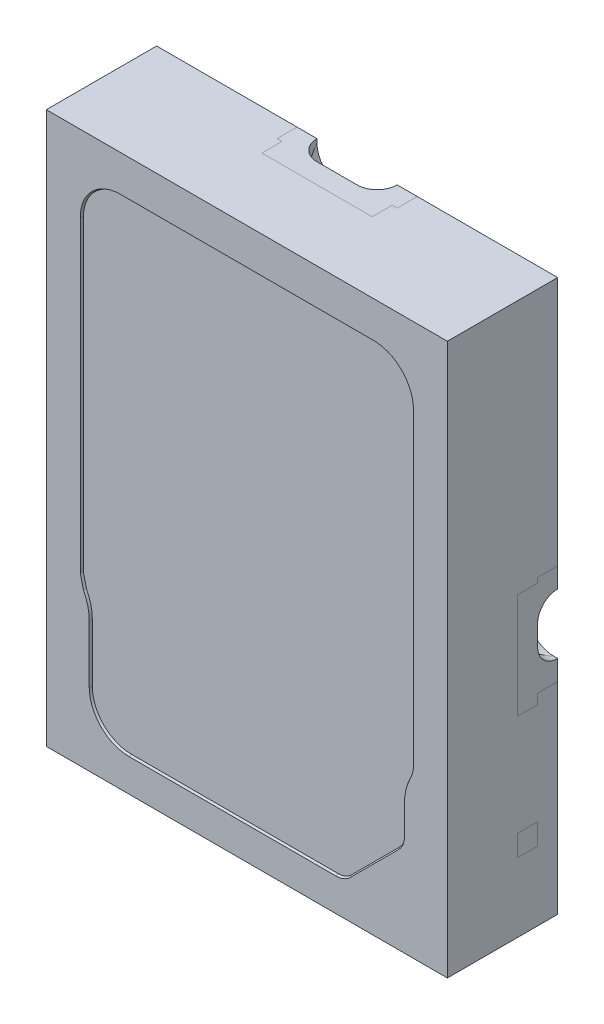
ISO-10303-21;
HEADER;
FILE_DESCRIPTION(('STEP AP214'),'2;1');
FILE_NAME('part.step','',(''),(''),'','','');
FILE_SCHEMA(('AUTOMOTIVE_DESIGN { 1 0 10303 214 1 1 1 1 }'));
ENDSEC;
DATA;
#1=APPLICATION_CONTEXT('core data for automotive mechanical design processes');
#2=APPLICATION_PROTOCOL_DEFINITION('international standard','automotive_design',2000,#1);
#3=PRODUCT_CONTEXT('',#1,'mechanical');
#4=PRODUCT('Part','Part','',(#3));
#5=PRODUCT_RELATED_PRODUCT_CATEGORY('part','',(#4));
#6=PRODUCT_DEFINITION_FORMATION('','',#4);
#7=PRODUCT_DEFINITION_CONTEXT('part definition',#1,'design');
#8=PRODUCT_DEFINITION('design','',#6,#7);
#9=PRODUCT_DEFINITION_SHAPE('','',#8);
#10=(LENGTH_UNIT() NAMED_UNIT(*) SI_UNIT(.MILLI.,.METRE.));
#11=(NAMED_UNIT(*) PLANE_ANGLE_UNIT() SI_UNIT($,.RADIAN.));
#12=(NAMED_UNIT(*) SI_UNIT($,.STERADIAN.) SOLID_ANGLE_UNIT());
#13=UNCERTAINTY_MEASURE_WITH_UNIT(LENGTH_MEASURE(1.E-05),#10,'distance_accuracy_value','');
#14=(GEOMETRIC_REPRESENTATION_CONTEXT(3) GLOBAL_UNCERTAINTY_ASSIGNED_CONTEXT((#13)) GLOBAL_UNIT_ASSIGNED_CONTEXT((#10,
#11,#12)) REPRESENTATION_CONTEXT('',''));
#15=CARTESIAN_POINT('',(0.,0.,0.));
#16=DIRECTION('',(0.,0.,1.));
#17=DIRECTION('',(1.,0.,0.));
#18=AXIS2_PLACEMENT_3D('',#15,#16,#17);
#19=CARTESIAN_POINT('',(0.299632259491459,-1.31944805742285,-0.347995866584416));
#20=CARTESIAN_POINT('',(0.300747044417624,-1.26866564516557,-0.347994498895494));
#21=CARTESIAN_POINT('',(0.317355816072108,-1.23097804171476,-0.347994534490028));
#22=CARTESIAN_POINT('',(0.342860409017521,-1.20080877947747,-0.347995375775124));
#23=CARTESIAN_POINT('',(0.377245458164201,-1.17814487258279,-0.34799702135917));
#24=CARTESIAN_POINT('',(0.427144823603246,-1.16859295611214,-0.348000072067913));
#25=CARTESIAN_POINT('',(0.300173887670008,-1.31990695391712,-0.388796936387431));
#26=CARTESIAN_POINT('',(0.307960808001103,-1.27476352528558,-0.388796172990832));
#27=CARTESIAN_POINT('',(0.327081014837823,-1.23919847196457,-0.38879643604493));
#28=CARTESIAN_POINT('',(0.352571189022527,-1.20901702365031,-0.388797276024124));
#29=CARTESIAN_POINT('',(0.384452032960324,-1.18423667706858,-0.388798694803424));
#30=CARTESIAN_POINT('',(0.427671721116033,-1.16903940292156,-0.388801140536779));
#31=CARTESIAN_POINT('',(0.298876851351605,-1.31881189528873,-0.429597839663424));
#32=CARTESIAN_POINT('',(0.312437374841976,-1.27854805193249,-0.429597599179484));
#33=CARTESIAN_POINT('',(0.333284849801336,-1.24444280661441,-0.429598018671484));
#34=CARTESIAN_POINT('',(0.358775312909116,-1.21426160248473,-0.429598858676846));
#35=CARTESIAN_POINT('',(0.388903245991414,-1.18799977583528,-0.429600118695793));
#36=CARTESIAN_POINT('',(0.426324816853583,-1.16790219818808,-0.429602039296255));
#37=CARTESIAN_POINT('',(0.298872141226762,-1.31880905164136,-0.470398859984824));
#38=CARTESIAN_POINT('',(0.312450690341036,-1.27856044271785,-0.470398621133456));
#39=CARTESIAN_POINT('',(0.333270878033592,-1.24443213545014,-0.47039903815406));
#40=CARTESIAN_POINT('',(0.358772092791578,-1.21426001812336,-0.470399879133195));
#41=CARTESIAN_POINT('',(0.388919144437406,-1.18801434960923,-0.470401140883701));
#42=CARTESIAN_POINT('',(0.426304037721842,-1.16788577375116,-0.470403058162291));
#43=CARTESIAN_POINT('',(0.300181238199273,-1.31991657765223,-0.511199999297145));
#44=CARTESIAN_POINT('',(0.307937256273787,-1.27474703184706,-0.511199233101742));
#45=CARTESIAN_POINT('',(0.327101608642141,-1.23921928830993,-0.511199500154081));
#46=CARTESIAN_POINT('',(0.352586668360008,-1.20903351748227,-0.51120033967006));
#47=CARTESIAN_POINT('',(0.38442863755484,-1.18422031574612,-0.511201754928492));
#48=CARTESIAN_POINT('',(0.42769450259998,-1.16906206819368,-0.511204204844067));
#49=CARTESIAN_POINT('',(0.299633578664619,-1.31945485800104,-0.552000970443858));
#50=CARTESIAN_POINT('',(0.300678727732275,-1.26861359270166,-0.551999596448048));
#51=CARTESIAN_POINT('',(0.317404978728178,-1.2310252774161,-0.551999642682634));
#52=CARTESIAN_POINT('',(0.342898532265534,-1.20084668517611,-0.552000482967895));
#53=CARTESIAN_POINT('',(0.377166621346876,-1.17808392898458,-0.552002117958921));
#54=CARTESIAN_POINT('',(0.427141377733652,-1.16859572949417,-0.552005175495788));
#55=B_SPLINE_SURFACE_WITH_KNOTS('',5,5,((#19,#20,#21,#22,#23,#24),(#25,#26,#27,#28,#29,#30),
(#31,#32,#33,#34,#35,#36),(#37,#38,#39,#40,#41,#42),(#43,#44,#45,#46,#47,#48),(#49,#50,#51,#52,
#53,#54)),.UNSPECIFIED.,.F.,.F.,.F.,(6,6),(6,6),(-0.102003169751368,0.10200193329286),
(-0.0793983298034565,0.118128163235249),.UNSPECIFIED.);
#56=CARTESIAN_POINT('',(0.299633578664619,-1.31945485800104,-0.552000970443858));
#57=CARTESIAN_POINT('',(0.300181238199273,-1.31991657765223,-0.511199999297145));
#58=CARTESIAN_POINT('',(0.298872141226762,-1.31880905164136,-0.470398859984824));
#59=CARTESIAN_POINT('',(0.298876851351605,-1.31881189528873,-0.429597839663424));
#60=CARTESIAN_POINT('',(0.300173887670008,-1.31990695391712,-0.388796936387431));
#61=CARTESIAN_POINT('',(0.299632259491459,-1.31944805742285,-0.347995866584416));
#62=B_SPLINE_CURVE_WITH_KNOTS('',5,(#56,#57,#58,#59,#60,#61),.UNSPECIFIED.,.F.,.F.,(6,6),
(-0.102003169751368,0.10200193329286),.UNSPECIFIED.);
#63=CARTESIAN_POINT('',(0.299824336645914,-1.31944521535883,-0.347995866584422));
#64=VERTEX_POINT('',#63);
#65=CARTESIAN_POINT('',(0.299766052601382,-1.31799554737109,-0.450000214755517));
#66=VERTEX_POINT('',#65);
#67=EDGE_CURVE('E704',#64,#66,#62,.F.);
#68=CARTESIAN_POINT('',(0.299632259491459,-1.31944805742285,-0.347995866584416));
#69=CARTESIAN_POINT('',(0.300747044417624,-1.26866564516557,-0.347994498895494));
#70=CARTESIAN_POINT('',(0.317355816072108,-1.23097804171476,-0.347994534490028));
#71=CARTESIAN_POINT('',(0.342860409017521,-1.20080877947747,-0.347995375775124));
#72=CARTESIAN_POINT('',(0.377245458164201,-1.17814487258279,-0.34799702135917));
#73=CARTESIAN_POINT('',(0.427144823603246,-1.16859295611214,-0.348000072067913));
#74=B_SPLINE_CURVE_WITH_KNOTS('',5,(#68,#69,#70,#71,#72,#73),.UNSPECIFIED.,.F.,.F.,(6,6),
(-0.0793983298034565,0.118128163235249),.UNSPECIFIED.);
#75=CARTESIAN_POINT('',(0.42717350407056,-1.16877946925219,-0.348000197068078));
#76=VERTEX_POINT('',#75);
#77=EDGE_CURVE('E693',#76,#64,#74,.F.);
#78=CARTESIAN_POINT('',(0.427144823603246,-1.16859295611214,-0.348000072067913));
#79=CARTESIAN_POINT('',(0.427671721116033,-1.16903940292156,-0.388801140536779));
#80=CARTESIAN_POINT('',(0.426324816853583,-1.16790219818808,-0.429602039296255));
#81=CARTESIAN_POINT('',(0.426304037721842,-1.16788577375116,-0.470403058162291));
#82=CARTESIAN_POINT('',(0.42769450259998,-1.16906206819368,-0.511204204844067));
#83=CARTESIAN_POINT('',(0.427141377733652,-1.16859572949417,-0.552005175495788));
#84=B_SPLINE_CURVE_WITH_KNOTS('',5,(#78,#79,#80,#81,#82,#83),.UNSPECIFIED.,.F.,.F.,(6,6),
(-0.102003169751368,0.10200193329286),.UNSPECIFIED.);
#85=CARTESIAN_POINT('',(0.426142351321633,-1.1689865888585,-0.550969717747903));
#86=VERTEX_POINT('',#85);
#87=EDGE_CURVE('E687',#86,#76,#84,.F.);
#88=CARTESIAN_POINT('',(0.299771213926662,-1.31627434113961,-0.550000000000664));
#89=CARTESIAN_POINT('',(0.300150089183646,-1.30703731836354,-0.550000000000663));
#90=CARTESIAN_POINT('',(0.301216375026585,-1.29779825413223,-0.550000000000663));
#91=CARTESIAN_POINT('',(0.304842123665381,-1.27956937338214,-0.550000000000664));
#92=CARTESIAN_POINT('',(0.307409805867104,-1.27058121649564,-0.550000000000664));
#93=CARTESIAN_POINT('',(0.314176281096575,-1.25316145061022,-0.550000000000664));
#94=CARTESIAN_POINT('',(0.318385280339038,-1.24473371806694,-0.550000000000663));
#95=CARTESIAN_POINT('',(0.328334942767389,-1.22887749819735,-0.550000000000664));
#96=CARTESIAN_POINT('',(0.3340697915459,-1.2214453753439,-0.550000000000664));
#97=CARTESIAN_POINT('',(0.34609342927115,-1.20866006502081,-0.550000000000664));
#98=CARTESIAN_POINT('',(0.352231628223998,-1.20316419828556,-0.550000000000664));
#99=CARTESIAN_POINT('',(0.365355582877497,-1.19326051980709,-0.550000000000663));
#100=CARTESIAN_POINT('',(0.372343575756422,-1.18885567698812,-0.550000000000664));
#101=CARTESIAN_POINT('',(0.386940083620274,-1.18119914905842,-0.550000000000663));
#102=CARTESIAN_POINT('',(0.394550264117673,-1.17795069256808,-0.550000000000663));
#103=CARTESIAN_POINT('',(0.410117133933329,-1.17257523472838,-0.550000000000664));
#104=CARTESIAN_POINT('',(0.418071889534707,-1.1704426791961,-0.550000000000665));
#105=CARTESIAN_POINT('',(0.426110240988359,-1.16882784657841,-0.550000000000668));
#106=B_SPLINE_CURVE_WITH_KNOTS('',3,(#88,#89,#90,#91,#92,#93,#94,#95,#96,#97,#98,#99,#100,#101,
#102,#103,#104,#105),.UNSPECIFIED.,.F.,.F.,(4,2,2,2,2,2,2,2,4),(0.,0.0277566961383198,
0.0556667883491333,0.0837532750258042,0.111734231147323,0.136335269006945,0.161002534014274,
0.185738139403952,0.210349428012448),.UNSPECIFIED.);
#107=CARTESIAN_POINT('',(0.299844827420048,-1.31627752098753,-0.54957286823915));
#108=VERTEX_POINT('',#107);
#109=EDGE_CURVE('E852',#108,#86,#106,.T.);
#110=CARTESIAN_POINT('',(0.300001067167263,-1.31665756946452,-0.450000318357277));
#111=CARTESIAN_POINT('',(0.300001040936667,-1.31663095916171,-0.45874022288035));
#112=CARTESIAN_POINT('',(0.300000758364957,-1.31671437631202,-0.467479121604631));
#113=CARTESIAN_POINT('',(0.300000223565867,-1.31696486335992,-0.484972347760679));
#114=CARTESIAN_POINT('',(0.299999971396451,-1.31713209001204,-0.493726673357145));
#115=CARTESIAN_POINT('',(0.300000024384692,-1.3173352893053,-0.506397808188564));
#116=CARTESIAN_POINT('',(0.300000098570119,-1.31739272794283,-0.510314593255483));
#117=CARTESIAN_POINT('',(0.300000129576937,-1.31742407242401,-0.518147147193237));
#118=CARTESIAN_POINT('',(0.300000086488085,-1.31739804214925,-0.52206291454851));
#119=CARTESIAN_POINT('',(0.299999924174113,-1.31713179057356,-0.529957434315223));
#120=CARTESIAN_POINT('',(0.299999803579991,-1.3168876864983,-0.533936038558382));
#121=CARTESIAN_POINT('',(0.300006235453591,-1.31571522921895,-0.540152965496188));
#122=CARTESIAN_POINT('',(0.300009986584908,-1.3151200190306,-0.542415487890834));
#123=CARTESIAN_POINT('',(0.300041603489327,-1.31368846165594,-0.545274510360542));
#124=CARTESIAN_POINT('',(0.300053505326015,-1.31321591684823,-0.546050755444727));
#125=CARTESIAN_POINT('',(0.30006943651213,-1.31265982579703,-0.546781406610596));
#126=B_SPLINE_CURVE_WITH_KNOTS('',3,(#110,#111,#112,#113,#114,#115,#116,#117,#118,#119,#120,
#121,#122,#123,#124,#125),.UNSPECIFIED.,.F.,.F.,(4,2,2,2,2,2,2,4),(0.,0.0262178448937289,
0.0524849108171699,0.0642370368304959,0.0759801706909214,0.0879366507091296,0.0948351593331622,
0.0975596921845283),.UNSPECIFIED.);
#127=EDGE_CURVE('E2316',#66,#108,#126,.T.);
#128=ORIENTED_EDGE('',*,*,#67,.F.);
#129=ORIENTED_EDGE('',*,*,#77,.F.);
#130=ORIENTED_EDGE('',*,*,#87,.F.);
#131=ORIENTED_EDGE('',*,*,#109,.F.);
#132=ORIENTED_EDGE('',*,*,#127,.F.);
#133=EDGE_LOOP('',(#128,#129,#130,#131,#132));
#134=FACE_BOUND('',#133,.T.);
#135=ADVANCED_FACE('F15',(#134),#55,.F.);
#136=CARTESIAN_POINT('',(1987.74660832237,2988.42560471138,-0.550000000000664));
#137=DIRECTION('',(0.,0.,1.));
#138=DIRECTION('',(-1.,0.,0.));
#139=AXIS2_PLACEMENT_3D('',#136,#137,#138);
#140=PLANE('',#139);
#141=CARTESIAN_POINT('',(-0.449999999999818,1.23749999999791,-0.55));
#142=DIRECTION('',(0.,0.,-1.));
#143=DIRECTION('',(1.,0.,0.));
#144=AXIS2_PLACEMENT_3D('',#141,#142,#143);
#145=CIRCLE('',#144,0.150000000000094);
#146=CARTESIAN_POINT('',(-0.299999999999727,1.23749999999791,-0.55));
#147=VERTEX_POINT('',#146);
#148=CARTESIAN_POINT('',(-0.449999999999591,1.08749999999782,-0.55));
#149=VERTEX_POINT('',#148);
#150=EDGE_CURVE('E1109',#147,#149,#145,.T.);
#151=ORIENTED_EDGE('',*,*,#150,.F.);
#152=DIRECTION('',(0.,-1.,0.));
#153=VECTOR('',#152,1.);
#154=CARTESIAN_POINT('',(-0.299999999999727,2988.42560471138,-0.550000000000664));
#155=LINE('',#154,#153);
#156=CARTESIAN_POINT('',(-0.299999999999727,1.375,-0.55));
#157=VERTEX_POINT('',#156);
#158=EDGE_CURVE('E1116',#157,#147,#155,.T.);
#159=ORIENTED_EDGE('',*,*,#158,.F.);
#160=DIRECTION('',(-1.,0.,0.));
#161=VECTOR('',#160,1.);
#162=CARTESIAN_POINT('',(1987.74660832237,1.375,-0.55));
#163=LINE('',#162,#161);
#164=CARTESIAN_POINT('',(-0.200000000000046,1.375,-0.55));
#165=VERTEX_POINT('',#164);
#166=EDGE_CURVE('E1119',#165,#157,#163,.T.);
#167=ORIENTED_EDGE('',*,*,#166,.F.);
#168=DIRECTION('',(0.,1.,0.));
#169=VECTOR('',#168,1.);
#170=CARTESIAN_POINT('',(-0.200000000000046,2988.42560471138,-0.550000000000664));
#171=LINE('',#170,#169);
#172=CARTESIAN_POINT('',(-0.200000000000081,1.35500000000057,-0.55));
#173=VERTEX_POINT('',#172);
#174=EDGE_CURVE('E1122',#173,#165,#171,.T.);
#175=ORIENTED_EDGE('',*,*,#174,.F.);
#176=CARTESIAN_POINT('',(-0.069999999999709,1.35500000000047,-0.55));
#177=DIRECTION('',(0.,0.,1.));
#178=DIRECTION('',(-1.,0.,0.));
#179=AXIS2_PLACEMENT_3D('',#176,#177,#178);
#180=CIRCLE('',#179,0.130000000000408);
#181=CARTESIAN_POINT('',(-0.069999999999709,1.22499999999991,-0.55));
#182=VERTEX_POINT('',#181);
#183=EDGE_CURVE('E1125',#173,#182,#180,.T.);
#184=ORIENTED_EDGE('',*,*,#183,.T.);
#185=DIRECTION('',(1.,0.,0.));
#186=VECTOR('',#185,1.);
#187=CARTESIAN_POINT('',(1987.74660832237,1.22499999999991,-0.55));
#188=LINE('',#187,#186);
#189=CARTESIAN_POINT('',(0.0700000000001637,1.22499999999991,-0.55));
#190=VERTEX_POINT('',#189);
#191=EDGE_CURVE('E1127',#182,#190,#188,.T.);
#192=ORIENTED_EDGE('',*,*,#191,.T.);
#193=CARTESIAN_POINT('',(0.0700000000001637,1.35500000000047,-0.55));
#194=DIRECTION('',(0.,0.,1.));
#195=DIRECTION('',(-1.,0.,0.));
#196=AXIS2_PLACEMENT_3D('',#193,#194,#195);
#197=CIRCLE('',#196,0.130000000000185);
#198=CARTESIAN_POINT('',(0.200000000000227,1.35500000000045,-0.550000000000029));
#199=VERTEX_POINT('',#198);
#200=EDGE_CURVE('E1129',#190,#199,#197,.T.);
#201=ORIENTED_EDGE('',*,*,#200,.T.);
#202=DIRECTION('',(0.,-1.,0.));
#203=VECTOR('',#202,1.);
#204=CARTESIAN_POINT('',(0.200000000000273,2988.42560471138,-0.550000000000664));
#205=LINE('',#204,#203);
#206=CARTESIAN_POINT('',(0.200000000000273,1.375,-0.55));
#207=VERTEX_POINT('',#206);
#208=EDGE_CURVE('E1131',#207,#199,#205,.T.);
#209=ORIENTED_EDGE('',*,*,#208,.F.);
#210=DIRECTION('',(-1.,0.,0.));
#211=VECTOR('',#210,1.);
#212=CARTESIAN_POINT('',(1987.74660832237,1.375,-0.55));
#213=LINE('',#212,#211);
#214=CARTESIAN_POINT('',(0.300000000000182,1.375,-0.55));
#215=VERTEX_POINT('',#214);
#216=EDGE_CURVE('E1134',#215,#207,#213,.T.);
#217=ORIENTED_EDGE('',*,*,#216,.F.);
#218=DIRECTION('',(0.,-1.,0.));
#219=VECTOR('',#218,1.);
#220=CARTESIAN_POINT('',(0.300000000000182,2988.42560471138,-0.550000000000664));
#221=LINE('',#220,#219);
#222=CARTESIAN_POINT('',(0.300000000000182,1.23749999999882,-0.55));
#223=VERTEX_POINT('',#222);
#224=EDGE_CURVE('E1137',#215,#223,#221,.T.);
#225=ORIENTED_EDGE('',*,*,#224,.T.);
#226=CARTESIAN_POINT('',(0.450000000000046,1.23749999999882,-0.55));
#227=DIRECTION('',(0.,0.,1.));
#228=DIRECTION('',(-1.,0.,0.));
#229=AXIS2_PLACEMENT_3D('',#226,#227,#228);
#230=CIRCLE('',#229,0.150000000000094);
#231=CARTESIAN_POINT('',(0.450000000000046,1.08749999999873,-0.55));
#232=VERTEX_POINT('',#231);
#233=EDGE_CURVE('E1139',#223,#232,#230,.T.);
#234=ORIENTED_EDGE('',*,*,#233,.T.);
#235=DIRECTION('',(-1.,0.,0.));
#236=VECTOR('',#235,1.);
#237=CARTESIAN_POINT('',(1987.74660832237,1.08749999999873,-0.55));
#238=LINE('',#237,#236);
#239=CARTESIAN_POINT('',(0.650000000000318,1.08749999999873,-0.55));
#240=VERTEX_POINT('',#239);
#241=EDGE_CURVE('E1141',#240,#232,#238,.T.);
#242=ORIENTED_EDGE('',*,*,#241,.F.);
#243=CARTESIAN_POINT('',(0.650000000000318,0.937499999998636,-0.55));
#244=DIRECTION('',(0.,0.,1.));
#245=DIRECTION('',(-1.,0.,0.));
#246=AXIS2_PLACEMENT_3D('',#243,#244,#245);
#247=CIRCLE('',#246,0.149999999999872);
#248=CARTESIAN_POINT('',(0.800000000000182,0.937499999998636,-0.55));
#249=VERTEX_POINT('',#248);
#250=EDGE_CURVE('E1144',#249,#240,#247,.T.);
#251=ORIENTED_EDGE('',*,*,#250,.F.);
#252=DIRECTION('',(0.,1.,0.));
#253=VECTOR('',#252,1.);
#254=CARTESIAN_POINT('',(0.800000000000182,2988.42560471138,-0.550000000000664));
#255=LINE('',#254,#253);
#256=CARTESIAN_POINT('',(0.800000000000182,0.27999999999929,-0.55));
#257=VERTEX_POINT('',#256);
#258=EDGE_CURVE('E1147',#257,#249,#255,.T.);
#259=ORIENTED_EDGE('',*,*,#258,.F.);
#260=CARTESIAN_POINT('',(0.950000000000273,0.27999999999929,-0.55));
#261=DIRECTION('',(0.,0.,-1.));
#262=DIRECTION('',(1.,0.,0.));
#263=AXIS2_PLACEMENT_3D('',#260,#261,#262);
#264=CIRCLE('',#263,0.150000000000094);
#265=CARTESIAN_POINT('',(0.950000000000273,0.1299999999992,-0.55));
#266=VERTEX_POINT('',#265);
#267=EDGE_CURVE('E1150',#266,#257,#264,.T.);
#268=ORIENTED_EDGE('',*,*,#267,.F.);
#269=DIRECTION('',(-1.,0.,0.));
#270=VECTOR('',#269,1.);
#271=CARTESIAN_POINT('',(1982.97706176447,0.1299999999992,-0.55));
#272=LINE('',#271,#270);
#273=CARTESIAN_POINT('',(1.00000000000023,0.1299999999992,-0.55));
#274=VERTEX_POINT('',#273);
#275=EDGE_CURVE('E1153',#274,#266,#272,.T.);
#276=ORIENTED_EDGE('',*,*,#275,.F.);
#277=DIRECTION('',(0.,1.,0.));
#278=VECTOR('',#277,1.);
#279=CARTESIAN_POINT('',(1.00000000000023,2988.42560471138,-0.550000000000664));
#280=LINE('',#279,#278);
#281=CARTESIAN_POINT('',(1.00000000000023,0.0299999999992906,-0.55));
#282=VERTEX_POINT('',#281);
#283=EDGE_CURVE('E1156',#282,#274,#280,.T.);
#284=ORIENTED_EDGE('',*,*,#283,.F.);
#285=DIRECTION('',(1.,-2.22044604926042E-11,0.));
#286=VECTOR('',#285,1.);
#287=CARTESIAN_POINT('',(1987.74660825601,0.0299999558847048,-0.55));
#288=LINE('',#287,#286);
#289=CARTESIAN_POINT('',(0.980000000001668,0.0299999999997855,-0.55));
#290=VERTEX_POINT('',#289);
#291=EDGE_CURVE('E1159',#290,#282,#288,.T.);
#292=ORIENTED_EDGE('',*,*,#291,.F.);
#293=CARTESIAN_POINT('',(0.980000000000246,-0.0999999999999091,-0.55));
#294=DIRECTION('',(0.,0.,1.));
#295=DIRECTION('',(-1.,0.,0.));
#296=AXIS2_PLACEMENT_3D('',#293,#294,#295);
#297=CIRCLE('',#296,0.129999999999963);
#298=CARTESIAN_POINT('',(0.850000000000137,-0.0999999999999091,-0.55));
#299=VERTEX_POINT('',#298);
#300=EDGE_CURVE('E1162',#290,#299,#297,.T.);
#301=ORIENTED_EDGE('',*,*,#300,.T.);
#302=DIRECTION('',(0.,1.,0.));
#303=VECTOR('',#302,1.);
#304=CARTESIAN_POINT('',(0.850000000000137,2988.42560471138,-0.550000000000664));
#305=LINE('',#304,#303);
#306=CARTESIAN_POINT('',(0.850000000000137,-0.140000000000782,-0.55));
#307=VERTEX_POINT('',#306);
#308=EDGE_CURVE('E1164',#307,#299,#305,.T.);
#309=ORIENTED_EDGE('',*,*,#308,.F.);
#310=CARTESIAN_POINT('',(0.980000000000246,-0.140000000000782,-0.55));
#311=DIRECTION('',(0.,0.,1.));
#312=DIRECTION('',(-1.,0.,0.));
#313=AXIS2_PLACEMENT_3D('',#310,#311,#312);
#314=CIRCLE('',#313,0.129999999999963);
#315=CARTESIAN_POINT('',(0.980000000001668,-0.270000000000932,-0.55));
#316=VERTEX_POINT('',#315);
#317=EDGE_CURVE('E1167',#307,#316,#314,.T.);
#318=ORIENTED_EDGE('',*,*,#317,.T.);
#319=DIRECTION('',(1.,2.22044604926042E-11,0.));
#320=VECTOR('',#319,1.);
#321=CARTESIAN_POINT('',(1987.74660838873,-0.269999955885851,-0.55));
#322=LINE('',#321,#320);
#323=CARTESIAN_POINT('',(1.00000000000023,-0.270000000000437,-0.55));
#324=VERTEX_POINT('',#323);
#325=EDGE_CURVE('E1169',#316,#324,#322,.T.);
#326=ORIENTED_EDGE('',*,*,#325,.T.);
#327=DIRECTION('',(0.,1.,0.));
#328=VECTOR('',#327,1.);
#329=CARTESIAN_POINT('',(1.00000000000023,2988.42560471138,-0.550000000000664));
#330=LINE('',#329,#328);
#331=CARTESIAN_POINT('',(0.999999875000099,-0.37000000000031,-0.550000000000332));
#332=VERTEX_POINT('',#331);
#333=EDGE_CURVE('E1171',#332,#324,#330,.T.);
#334=ORIENTED_EDGE('',*,*,#333,.F.);
#335=CARTESIAN_POINT('',(0.691421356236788,-0.370000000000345,-0.550000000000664));
#336=CARTESIAN_POINT('',(1.00000000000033,-0.370000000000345,-0.550000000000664));
#337=B_SPLINE_CURVE_WITH_KNOTS('',1,(#335,#336),.UNSPECIFIED.,.F.,.F.,(2,2),(0.,1.),.UNSPECIFIED.);
#338=CARTESIAN_POINT('',(0.691421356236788,-0.370000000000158,-0.550000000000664));
#339=VERTEX_POINT('',#338);
#340=EDGE_CURVE('E1044',#339,#332,#337,.T.);
#341=ORIENTED_EDGE('',*,*,#340,.F.);
#342=CARTESIAN_POINT('',(0.620710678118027,-0.340710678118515,-0.550000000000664));
#343=CARTESIAN_POINT('',(0.639714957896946,-0.359714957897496,-0.550000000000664));
#344=CARTESIAN_POINT('',(0.664545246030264,-0.369999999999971,-0.550000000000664));
#345=CARTESIAN_POINT('',(0.691421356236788,-0.369999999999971,-0.550000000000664));
#346=(BOUNDED_CURVE() B_SPLINE_CURVE(3,(#342,#343,#344,#345),.UNSPECIFIED.,.F.,
.F.) B_SPLINE_CURVE_WITH_KNOTS((4,4),(0.,1.),
.UNSPECIFIED.) CURVE() GEOMETRIC_REPRESENTATION_ITEM() RATIONAL_B_SPLINE_CURVE((1.,
0.949253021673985,0.949253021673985,1.)) REPRESENTATION_ITEM(''));
#347=CARTESIAN_POINT('',(0.620710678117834,-0.34071067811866,-0.550000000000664));
#348=VERTEX_POINT('',#347);
#349=EDGE_CURVE('E1035',#348,#339,#346,.T.);
#350=ORIENTED_EDGE('',*,*,#349,.F.);
#351=CARTESIAN_POINT('',(0.579289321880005,-0.299289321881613,-0.550000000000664));
#352=CARTESIAN_POINT('',(0.620710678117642,-0.340710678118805,-0.550000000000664));
#353=B_SPLINE_CURVE_WITH_KNOTS('',1,(#351,#352),.UNSPECIFIED.,.F.,.F.,(2,2),(0.,1.),.UNSPECIFIED.);
#354=CARTESIAN_POINT('',(0.579289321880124,-0.299289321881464,-0.550000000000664));
#355=VERTEX_POINT('',#354);
#356=EDGE_CURVE('E1026',#355,#348,#353,.T.);
#357=ORIENTED_EDGE('',*,*,#356,.F.);
#358=CARTESIAN_POINT('',(0.508578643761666,-0.270000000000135,-0.550000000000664));
#359=CARTESIAN_POINT('',(0.535454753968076,-0.270000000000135,-0.550000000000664));
#360=CARTESIAN_POINT('',(0.560285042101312,-0.280285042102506,-0.550000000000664));
#361=CARTESIAN_POINT('',(0.579289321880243,-0.299289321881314,-0.550000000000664));
#362=(BOUNDED_CURVE() B_SPLINE_CURVE(3,(#358,#359,#360,#361),.UNSPECIFIED.,.F.,
.F.) B_SPLINE_CURVE_WITH_KNOTS((4,4),(0.,1.),
.UNSPECIFIED.) CURVE() GEOMETRIC_REPRESENTATION_ITEM() RATIONAL_B_SPLINE_CURVE((1.,
0.949253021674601,0.949253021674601,1.)) REPRESENTATION_ITEM(''));
#363=CARTESIAN_POINT('',(0.508578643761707,-0.270000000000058,-0.550000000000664));
#364=VERTEX_POINT('',#363);
#365=EDGE_CURVE('E1017',#364,#355,#362,.T.);
#366=ORIENTED_EDGE('',*,*,#365,.F.);
#367=CARTESIAN_POINT('',(0.381120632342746,-0.269999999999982,-0.550000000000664));
#368=CARTESIAN_POINT('',(0.508578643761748,-0.269999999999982,-0.550000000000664));
#369=B_SPLINE_CURVE_WITH_KNOTS('',1,(#367,#368),.UNSPECIFIED.,.F.,.F.,(2,2),(0.,1.),.UNSPECIFIED.);
#370=CARTESIAN_POINT('',(0.381120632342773,-0.270000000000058,-0.550000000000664));
#371=VERTEX_POINT('',#370);
#372=EDGE_CURVE('E1008',#371,#364,#369,.T.);
#373=ORIENTED_EDGE('',*,*,#372,.F.);
#374=CARTESIAN_POINT('',(0.310409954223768,-0.299289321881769,-0.550000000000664));
#375=CARTESIAN_POINT('',(0.32941423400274,-0.280285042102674,-0.550000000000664));
#376=CARTESIAN_POINT('',(0.354244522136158,-0.270000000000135,-0.550000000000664));
#377=CARTESIAN_POINT('',(0.3811206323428,-0.270000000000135,-0.550000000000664));
#378=(BOUNDED_CURVE() B_SPLINE_CURVE(3,(#374,#375,#376,#377),.UNSPECIFIED.,.F.,
.F.) B_SPLINE_CURVE_WITH_KNOTS((4,4),(0.,1.),
.UNSPECIFIED.) CURVE() GEOMETRIC_REPRESENTATION_ITEM() RATIONAL_B_SPLINE_CURVE((1.,
0.949253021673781,0.949253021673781,1.)) REPRESENTATION_ITEM(''));
#379=CARTESIAN_POINT('',(0.310409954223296,-0.299289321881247,-0.550000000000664));
#380=VERTEX_POINT('',#379);
#381=EDGE_CURVE('E999',#380,#371,#378,.T.);
#382=ORIENTED_EDGE('',*,*,#381,.F.);
#383=CARTESIAN_POINT('',(0.268988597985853,-0.340710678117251,-0.550000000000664));
#384=CARTESIAN_POINT('',(0.310409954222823,-0.299289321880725,-0.550000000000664));
#385=B_SPLINE_CURVE_WITH_KNOTS('',1,(#383,#384),.UNSPECIFIED.,.F.,.F.,(2,2),(0.,1.),.UNSPECIFIED.);
#386=CARTESIAN_POINT('',(0.268988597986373,-0.340710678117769,-0.550000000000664));
#387=VERTEX_POINT('',#386);
#388=EDGE_CURVE('E990',#387,#380,#385,.T.);
#389=ORIENTED_EDGE('',*,*,#388,.F.);
#390=CARTESIAN_POINT('',(0.198277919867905,-0.369999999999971,-0.550000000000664));
#391=CARTESIAN_POINT('',(0.225154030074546,-0.369999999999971,-0.550000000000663));
#392=CARTESIAN_POINT('',(0.249984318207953,-0.359714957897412,-0.550000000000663));
#393=CARTESIAN_POINT('',(0.268988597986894,-0.340710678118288,-0.550000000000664));
#394=(BOUNDED_CURVE() B_SPLINE_CURVE(3,(#390,#391,#392,#393),.UNSPECIFIED.,.F.,
.F.) B_SPLINE_CURVE_WITH_KNOTS((4,4),(0.,1.),
.UNSPECIFIED.) CURVE() GEOMETRIC_REPRESENTATION_ITEM() RATIONAL_B_SPLINE_CURVE((1.,
0.949253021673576,0.949253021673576,1.)) REPRESENTATION_ITEM(''));
#395=CARTESIAN_POINT('',(0.198277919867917,-0.369999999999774,-0.550000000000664));
#396=VERTEX_POINT('',#395);
#397=EDGE_CURVE('E981',#396,#387,#394,.T.);
#398=ORIENTED_EDGE('',*,*,#397,.F.);
#399=CARTESIAN_POINT('',(-0.198277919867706,-0.370000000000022,-0.550000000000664));
#400=CARTESIAN_POINT('',(0.198277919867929,-0.369999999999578,-0.550000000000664));
#401=B_SPLINE_CURVE_WITH_KNOTS('',1,(#399,#400),.UNSPECIFIED.,.F.,.F.,(2,2),(0.,1.),.UNSPECIFIED.);
#402=CARTESIAN_POINT('',(-0.198277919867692,-0.370000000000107,-0.550000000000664));
#403=VERTEX_POINT('',#402);
#404=EDGE_CURVE('E972',#403,#396,#401,.T.);
#405=ORIENTED_EDGE('',*,*,#404,.F.);
#406=CARTESIAN_POINT('',(-0.268988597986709,-0.340710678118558,-0.550000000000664));
#407=CARTESIAN_POINT('',(-0.249984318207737,-0.359714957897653,-0.550000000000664));
#408=CARTESIAN_POINT('',(-0.22515403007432,-0.370000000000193,-0.550000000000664));
#409=CARTESIAN_POINT('',(-0.198277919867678,-0.370000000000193,-0.550000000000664));
#410=(BOUNDED_CURVE() B_SPLINE_CURVE(3,(#406,#407,#408,#409),.UNSPECIFIED.,.F.,
.F.) B_SPLINE_CURVE_WITH_KNOTS((4,4),(0.,1.),
.UNSPECIFIED.) CURVE() GEOMETRIC_REPRESENTATION_ITEM() RATIONAL_B_SPLINE_CURVE((1.,
0.949253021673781,0.949253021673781,1.)) REPRESENTATION_ITEM(''));
#411=CARTESIAN_POINT('',(-0.268988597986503,-0.340710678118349,-0.550000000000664));
#412=VERTEX_POINT('',#411);
#413=EDGE_CURVE('E963',#412,#403,#410,.T.);
#414=ORIENTED_EDGE('',*,*,#413,.F.);
#415=CARTESIAN_POINT('',(-0.310409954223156,-0.299289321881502,-0.550000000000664));
#416=CARTESIAN_POINT('',(-0.268988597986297,-0.340710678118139,-0.550000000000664));
#417=B_SPLINE_CURVE_WITH_KNOTS('',1,(#415,#416),.UNSPECIFIED.,.F.,.F.,(2,2),(0.,1.),.UNSPECIFIED.);
#418=CARTESIAN_POINT('',(-0.310409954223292,-0.299289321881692,-0.550000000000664));
#419=VERTEX_POINT('',#418);
#420=EDGE_CURVE('E954',#419,#412,#417,.T.);
#421=ORIENTED_EDGE('',*,*,#420,.F.);
#422=CARTESIAN_POINT('',(-0.381120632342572,-0.270000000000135,-0.550000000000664));
#423=CARTESIAN_POINT('',(-0.354244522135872,-0.270000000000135,-0.550000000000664));
#424=CARTESIAN_POINT('',(-0.32941423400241,-0.280285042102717,-0.550000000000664));
#425=CARTESIAN_POINT('',(-0.310409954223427,-0.299289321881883,-0.550000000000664));
#426=(BOUNDED_CURVE() B_SPLINE_CURVE(3,(#422,#423,#424,#425),.UNSPECIFIED.,.F.,
.F.) B_SPLINE_CURVE_WITH_KNOTS((4,4),(0.,1.),
.UNSPECIFIED.) CURVE() GEOMETRIC_REPRESENTATION_ITEM() RATIONAL_B_SPLINE_CURVE((1.,
0.949253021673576,0.949253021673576,1.)) REPRESENTATION_ITEM(''));
#427=CARTESIAN_POINT('',(-0.381120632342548,-0.270000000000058,-0.550000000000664));
#428=VERTEX_POINT('',#427);
#429=EDGE_CURVE('E945',#428,#419,#426,.T.);
#430=ORIENTED_EDGE('',*,*,#429,.F.);
#431=CARTESIAN_POINT('',(-0.508578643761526,-0.269999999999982,-0.550000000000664));
#432=CARTESIAN_POINT('',(-0.381120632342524,-0.269999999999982,-0.550000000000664));
#433=B_SPLINE_CURVE_WITH_KNOTS('',1,(#431,#432),.UNSPECIFIED.,.F.,.F.,(2,2),(0.,1.),.UNSPECIFIED.);
#434=CARTESIAN_POINT('',(-0.508578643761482,-0.270000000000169,-0.550000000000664));
#435=VERTEX_POINT('',#434);
#436=EDGE_CURVE('E936',#435,#428,#433,.T.);
#437=ORIENTED_EDGE('',*,*,#436,.F.);
#438=CARTESIAN_POINT('',(-0.579289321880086,-0.299289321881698,-0.550000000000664));
#439=CARTESIAN_POINT('',(-0.560285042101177,-0.280285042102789,-0.550000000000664));
#440=CARTESIAN_POINT('',(-0.535454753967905,-0.270000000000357,-0.550000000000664));
#441=CARTESIAN_POINT('',(-0.508578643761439,-0.270000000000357,-0.550000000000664));
#442=(BOUNDED_CURVE() B_SPLINE_CURVE(3,(#438,#439,#440,#441),.UNSPECIFIED.,.F.,
.F.) B_SPLINE_CURVE_WITH_KNOTS((4,4),(0.,1.),
.UNSPECIFIED.) CURVE() GEOMETRIC_REPRESENTATION_ITEM() RATIONAL_B_SPLINE_CURVE((1.,
0.949253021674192,0.949253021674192,1.)) REPRESENTATION_ITEM(''));
#443=CARTESIAN_POINT('',(-0.579289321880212,-0.299289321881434,-0.550000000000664));
#444=VERTEX_POINT('',#443);
#445=EDGE_CURVE('E927',#444,#435,#442,.T.);
#446=ORIENTED_EDGE('',*,*,#445,.F.);
#447=CARTESIAN_POINT('',(-0.620710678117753,-0.340710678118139,-0.550000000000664));
#448=CARTESIAN_POINT('',(-0.579289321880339,-0.299289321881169,-0.550000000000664));
#449=B_SPLINE_CURVE_WITH_KNOTS('',1,(#447,#448),.UNSPECIFIED.,.F.,.F.,(2,2),(0.,1.),.UNSPECIFIED.);
#450=CARTESIAN_POINT('',(-0.620710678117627,-0.340710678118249,-0.550000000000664));
#451=VERTEX_POINT('',#450);
#452=EDGE_CURVE('E918',#451,#444,#449,.T.);
#453=ORIENTED_EDGE('',*,*,#452,.F.);
#454=CARTESIAN_POINT('',(-0.69142135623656,-0.370000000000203,-0.550000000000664));
#455=CARTESIAN_POINT('',(-0.664545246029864,-0.370000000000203,-0.550000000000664));
#456=CARTESIAN_POINT('',(-0.639714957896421,-0.359714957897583,-0.550000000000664));
#457=CARTESIAN_POINT('',(-0.620710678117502,-0.340710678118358,-0.550000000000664));
#458=(BOUNDED_CURVE() B_SPLINE_CURVE(3,(#454,#455,#456,#457),.UNSPECIFIED.,.F.,
.F.) B_SPLINE_CURVE_WITH_KNOTS((4,4),(0.,1.),
.UNSPECIFIED.) CURVE() GEOMETRIC_REPRESENTATION_ITEM() RATIONAL_B_SPLINE_CURVE((1.,
0.949253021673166,0.949253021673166,1.)) REPRESENTATION_ITEM(''));
#459=CARTESIAN_POINT('',(-0.691421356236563,-0.370000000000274,-0.550000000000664));
#460=VERTEX_POINT('',#459);
#461=EDGE_CURVE('E909',#460,#451,#458,.T.);
#462=ORIENTED_EDGE('',*,*,#461,.F.);
#463=CARTESIAN_POINT('',(-0.999999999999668,-0.370000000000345,-0.550000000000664));
#464=CARTESIAN_POINT('',(-0.691421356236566,-0.370000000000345,-0.550000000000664));
#465=B_SPLINE_CURVE_WITH_KNOTS('',1,(#463,#464),.UNSPECIFIED.,.F.,.F.,(2,2),(0.,1.),.UNSPECIFIED.);
#466=CARTESIAN_POINT('',(-0.99999999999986,-0.37000012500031,-0.550000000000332));
#467=VERTEX_POINT('',#466);
#468=EDGE_CURVE('E900',#467,#460,#465,.T.);
#469=ORIENTED_EDGE('',*,*,#468,.F.);
#470=DIRECTION('',(0.,-1.,0.));
#471=VECTOR('',#470,1.);
#472=CARTESIAN_POINT('',(-0.999999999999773,2988.42560471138,-0.550000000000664));
#473=LINE('',#472,#471);
#474=CARTESIAN_POINT('',(-0.999999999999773,-0.270000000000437,-0.55));
#475=VERTEX_POINT('',#474);
#476=EDGE_CURVE('E1174',#475,#467,#473,.T.);
#477=ORIENTED_EDGE('',*,*,#476,.F.);
#478=DIRECTION('',(-1.,0.,0.));
#479=VECTOR('',#478,1.);
#480=CARTESIAN_POINT('',(1987.74660832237,-0.270000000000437,-0.55));
#481=LINE('',#480,#479);
#482=CARTESIAN_POINT('',(-0.98,-0.270000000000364,-0.55));
#483=VERTEX_POINT('',#482);
#484=EDGE_CURVE('E1179',#483,#475,#481,.T.);
#485=ORIENTED_EDGE('',*,*,#484,.F.);
#486=CARTESIAN_POINT('',(-0.980000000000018,-0.140000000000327,-0.55));
#487=DIRECTION('',(0.,0.,1.));
#488=DIRECTION('',(-1.,0.,0.));
#489=AXIS2_PLACEMENT_3D('',#486,#487,#488);
#490=CIRCLE('',#489,0.129999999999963);
#491=CARTESIAN_POINT('',(-0.849999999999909,-0.140000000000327,-0.55));
#492=VERTEX_POINT('',#491);
#493=EDGE_CURVE('E1184',#483,#492,#490,.T.);
#494=ORIENTED_EDGE('',*,*,#493,.T.);
#495=DIRECTION('',(0.,1.,0.));
#496=VECTOR('',#495,1.);
#497=CARTESIAN_POINT('',(-0.849999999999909,2988.42560471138,-0.550000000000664));
#498=LINE('',#497,#496);
#499=CARTESIAN_POINT('',(-0.849999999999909,-0.0999999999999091,-0.55));
#500=VERTEX_POINT('',#499);
#501=EDGE_CURVE('E1186',#492,#500,#498,.T.);
#502=ORIENTED_EDGE('',*,*,#501,.T.);
#503=CARTESIAN_POINT('',(-0.980000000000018,-0.0999999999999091,-0.55));
#504=DIRECTION('',(0.,0.,1.));
#505=DIRECTION('',(-1.,0.,0.));
#506=AXIS2_PLACEMENT_3D('',#503,#504,#505);
#507=CIRCLE('',#506,0.129999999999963);
#508=CARTESIAN_POINT('',(-0.98,0.0299999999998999,-0.55));
#509=VERTEX_POINT('',#508);
#510=EDGE_CURVE('E1188',#500,#509,#507,.T.);
#511=ORIENTED_EDGE('',*,*,#510,.T.);
#512=DIRECTION('',(1.,0.,0.));
#513=VECTOR('',#512,1.);
#514=CARTESIAN_POINT('',(1987.74660832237,0.0299999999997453,-0.55));
#515=LINE('',#514,#513);
#516=CARTESIAN_POINT('',(-0.999999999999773,0.0299999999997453,-0.55));
#517=VERTEX_POINT('',#516);
#518=EDGE_CURVE('E1190',#517,#509,#515,.T.);
#519=ORIENTED_EDGE('',*,*,#518,.F.);
#520=DIRECTION('',(0.,-1.,0.));
#521=VECTOR('',#520,1.);
#522=CARTESIAN_POINT('',(-0.999999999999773,2988.42560471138,-0.550000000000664));
#523=LINE('',#522,#521);
#524=CARTESIAN_POINT('',(-0.999999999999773,0.129999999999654,-0.55));
#525=VERTEX_POINT('',#524);
#526=EDGE_CURVE('E1193',#525,#517,#523,.T.);
#527=ORIENTED_EDGE('',*,*,#526,.F.);
#528=DIRECTION('',(-1.,0.,0.));
#529=VECTOR('',#528,1.);
#530=CARTESIAN_POINT('',(1982.97706176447,0.129999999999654,-0.55));
#531=LINE('',#530,#529);
#532=CARTESIAN_POINT('',(-0.950000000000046,0.129999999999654,-0.55));
#533=VERTEX_POINT('',#532);
#534=EDGE_CURVE('E1196',#533,#525,#531,.T.);
#535=ORIENTED_EDGE('',*,*,#534,.F.);
#536=CARTESIAN_POINT('',(-0.950000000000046,0.27999999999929,-0.55));
#537=DIRECTION('',(0.,0.,-1.));
#538=DIRECTION('',(1.,0.,0.));
#539=AXIS2_PLACEMENT_3D('',#536,#537,#538);
#540=CIRCLE('',#539,0.149999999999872);
#541=CARTESIAN_POINT('',(-0.800000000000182,0.279999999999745,-0.55));
#542=VERTEX_POINT('',#541);
#543=EDGE_CURVE('E1199',#542,#533,#540,.T.);
#544=ORIENTED_EDGE('',*,*,#543,.F.);
#545=DIRECTION('',(0.,-1.,0.));
#546=VECTOR('',#545,1.);
#547=CARTESIAN_POINT('',(-0.800000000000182,2988.42560471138,-0.550000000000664));
#548=LINE('',#547,#546);
#549=CARTESIAN_POINT('',(-0.800000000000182,0.937499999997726,-0.55));
#550=VERTEX_POINT('',#549);
#551=EDGE_CURVE('E1202',#550,#542,#548,.T.);
#552=ORIENTED_EDGE('',*,*,#551,.F.);
#553=CARTESIAN_POINT('',(-0.650000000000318,0.937499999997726,-0.55));
#554=DIRECTION('',(0.,0.,1.));
#555=DIRECTION('',(1.,0.,0.));
#556=AXIS2_PLACEMENT_3D('',#553,#554,#555);
#557=CIRCLE('',#556,0.149999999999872);
#558=CARTESIAN_POINT('',(-0.650000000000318,1.08749999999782,-0.55));
#559=VERTEX_POINT('',#558);
#560=EDGE_CURVE('E1205',#559,#550,#557,.T.);
#561=ORIENTED_EDGE('',*,*,#560,.F.);
#562=DIRECTION('',(-1.,0.,0.));
#563=VECTOR('',#562,1.);
#564=CARTESIAN_POINT('',(1982.97706176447,1.08749999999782,-0.55));
#565=LINE('',#564,#563);
#566=EDGE_CURVE('E1208',#149,#559,#565,.T.);
#567=ORIENTED_EDGE('',*,*,#566,.F.);
#568=EDGE_LOOP('',(#151,#159,#167,#175,#184,#192,#201,#209,#217,#225,#234,#242,#251,#259,#268,
#276,#284,#292,#301,#309,#318,#326,#334,#341,#350,#357,#366,#373,#382,#389,#398,#405,#414,#421,
#430,#437,#446,#453,#462,#469,#477,#485,#494,#502,#511,#519,#527,#535,#544,#552,#561,#567));
#569=FACE_BOUND('',#568,.T.);
#570=ADVANCED_FACE('F1097',(#569),#140,.F.);
#571=CARTESIAN_POINT('',(1978.20751520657,2988.42560471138,-0.550000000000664));
#572=DIRECTION('',(0.,0.,-1.));
#573=DIRECTION('',(1.,0.,0.));
#574=AXIS2_PLACEMENT_3D('',#571,#572,#573);
#575=PLANE('',#574);
#576=ORIENTED_EDGE('',*,*,#534,.T.);
#577=DIRECTION('',(0.,1.,0.));
#578=VECTOR('',#577,1.);
#579=CARTESIAN_POINT('',(-1.,-1.375,-0.55));
#580=LINE('',#579,#578);
#581=CARTESIAN_POINT('',(-1.,1.375,-0.55));
#582=VERTEX_POINT('',#581);
#583=EDGE_CURVE('E1211',#525,#582,#580,.T.);
#584=ORIENTED_EDGE('',*,*,#583,.T.);
#585=DIRECTION('',(1.,0.,0.));
#586=VECTOR('',#585,1.);
#587=CARTESIAN_POINT('',(-1.,1.375,-0.55));
#588=LINE('',#587,#586);
#589=EDGE_CURVE('E1213',#582,#157,#588,.T.);
#590=ORIENTED_EDGE('',*,*,#589,.T.);
#591=ORIENTED_EDGE('',*,*,#158,.T.);
#592=ORIENTED_EDGE('',*,*,#150,.T.);
#593=ORIENTED_EDGE('',*,*,#566,.T.);
#594=ORIENTED_EDGE('',*,*,#560,.T.);
#595=ORIENTED_EDGE('',*,*,#551,.T.);
#596=ORIENTED_EDGE('',*,*,#543,.T.);
#597=EDGE_LOOP('',(#576,#584,#590,#591,#592,#593,#594,#595,#596));
#598=FACE_BOUND('',#597,.T.);
#599=ADVANCED_FACE('F1397',(#598),#575,.T.);
#600=CARTESIAN_POINT('',(1987.74660832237,-1.375,-0.35));
#601=DIRECTION('',(0.,1.,0.));
#602=DIRECTION('',(0.,0.,-1.));
#603=AXIS2_PLACEMENT_3D('',#600,#601,#602);
#604=PLANE('',#603);
#605=DIRECTION('',(0.,0.,-1.));
#606=VECTOR('',#605,1.);
#607=CARTESIAN_POINT('',(0.300000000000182,-1.375,-0.35));
#608=LINE('',#607,#606);
#609=CARTESIAN_POINT('',(0.300000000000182,-1.375,-0.45));
#610=VERTEX_POINT('',#609);
#611=CARTESIAN_POINT('',(0.300000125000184,-1.37499999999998,-0.550000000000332));
#612=VERTEX_POINT('',#611);
#613=EDGE_CURVE('E1216',#610,#612,#608,.T.);
#614=ORIENTED_EDGE('',*,*,#613,.F.);
#615=DIRECTION('',(1.,0.,0.));
#616=VECTOR('',#615,1.);
#617=CARTESIAN_POINT('',(989.253757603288,-1.375,-0.45));
#618=LINE('',#617,#616);
#619=CARTESIAN_POINT('',(0.275000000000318,-1.375,-0.45));
#620=VERTEX_POINT('',#619);
#621=EDGE_CURVE('E1219',#620,#610,#618,.T.);
#622=ORIENTED_EDGE('',*,*,#621,.F.);
#623=DIRECTION('',(0.,0.,-1.));
#624=VECTOR('',#623,1.);
#625=CARTESIAN_POINT('',(0.275000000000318,-1.375,-0.4));
#626=LINE('',#625,#624);
#627=CARTESIAN_POINT('',(0.275000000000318,-1.375,-0.35));
#628=VERTEX_POINT('',#627);
#629=EDGE_CURVE('E1224',#628,#620,#626,.T.);
#630=ORIENTED_EDGE('',*,*,#629,.F.);
#631=DIRECTION('',(1.,0.,0.));
#632=VECTOR('',#631,1.);
#633=CARTESIAN_POINT('',(1982.97706176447,-1.375,-0.35));
#634=LINE('',#633,#632);
#635=CARTESIAN_POINT('',(-0.274999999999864,-1.375,-0.35));
#636=VERTEX_POINT('',#635);
#637=EDGE_CURVE('E1227',#636,#628,#634,.T.);
#638=ORIENTED_EDGE('',*,*,#637,.F.);
#639=DIRECTION('',(0.,0.,1.));
#640=VECTOR('',#639,1.);
#641=CARTESIAN_POINT('',(-0.274999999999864,-1.375,-0.4));
#642=LINE('',#641,#640);
#643=CARTESIAN_POINT('',(-0.274999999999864,-1.375,-0.45));
#644=VERTEX_POINT('',#643);
#645=EDGE_CURVE('E1230',#644,#636,#642,.T.);
#646=ORIENTED_EDGE('',*,*,#645,.F.);
#647=DIRECTION('',(1.,0.,0.));
#648=VECTOR('',#647,1.);
#649=CARTESIAN_POINT('',(988.966257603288,-1.375,-0.45));
#650=LINE('',#649,#648);
#651=CARTESIAN_POINT('',(-0.299999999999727,-1.375,-0.45));
#652=VERTEX_POINT('',#651);
#653=EDGE_CURVE('E1233',#652,#644,#650,.T.);
#654=ORIENTED_EDGE('',*,*,#653,.F.);
#655=DIRECTION('',(0.,0.,1.));
#656=VECTOR('',#655,1.);
#657=CARTESIAN_POINT('',(-0.299999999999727,-1.375,-0.35));
#658=LINE('',#657,#656);
#659=CARTESIAN_POINT('',(-0.299999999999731,-1.37499874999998,-0.550000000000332));
#660=VERTEX_POINT('',#659);
#661=EDGE_CURVE('E552',#660,#652,#658,.T.);
#662=ORIENTED_EDGE('',*,*,#661,.F.);
#663=DIRECTION('',(1.,0.,0.));
#664=VECTOR('',#663,1.);
#665=CARTESIAN_POINT('',(1987.74660832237,-1.375,-0.55));
#666=LINE('',#665,#664);
#667=CARTESIAN_POINT('',(-0.199999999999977,-1.36500000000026,-0.550000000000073));
#668=VERTEX_POINT('',#667);
#669=EDGE_CURVE('E546',#660,#668,#666,.T.);
#670=ORIENTED_EDGE('',*,*,#669,.T.);
#671=CARTESIAN_POINT('',(-0.0999999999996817,-1.375,-0.550000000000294));
#672=DIRECTION('',(0.,1.,0.));
#673=DIRECTION('',(0.,0.,1.));
#674=AXIS2_PLACEMENT_3D('',#671,#672,#673);
#675=CIRCLE('',#674,0.100000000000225);
#676=CARTESIAN_POINT('',(-0.0999999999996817,-1.375,-0.450000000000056));
#677=VERTEX_POINT('',#676);
#678=EDGE_CURVE('E549',#668,#677,#675,.T.);
#679=ORIENTED_EDGE('',*,*,#678,.T.);
#680=DIRECTION('',(1.,0.,2.776235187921E-13));
#681=VECTOR('',#680,1.);
#682=CARTESIAN_POINT('',(0.100000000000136,-1.375,-0.45));
#683=LINE('',#682,#681);
#684=CARTESIAN_POINT('',(0.100000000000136,-1.375,-0.450000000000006));
#685=VERTEX_POINT('',#684);
#686=EDGE_CURVE('E565',#677,#685,#683,.T.);
#687=ORIENTED_EDGE('',*,*,#686,.T.);
#688=CARTESIAN_POINT('',(0.100000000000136,-1.375,-0.55));
#689=DIRECTION('',(0.,1.,0.));
#690=DIRECTION('',(0.,0.,1.));
#691=AXIS2_PLACEMENT_3D('',#688,#689,#690);
#692=CIRCLE('',#691,0.0999999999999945);
#693=CARTESIAN_POINT('',(0.200000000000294,-1.36500000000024,-0.55));
#694=VERTEX_POINT('',#693);
#695=EDGE_CURVE('E1244',#685,#694,#692,.T.);
#696=ORIENTED_EDGE('',*,*,#695,.T.);
#697=DIRECTION('',(1.,0.,0.));
#698=VECTOR('',#697,1.);
#699=CARTESIAN_POINT('',(1987.74660832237,-1.375,-0.55));
#700=LINE('',#699,#698);
#701=EDGE_CURVE('E1247',#694,#612,#700,.T.);
#702=ORIENTED_EDGE('',*,*,#701,.T.);
#703=EDGE_LOOP('',(#614,#622,#630,#638,#646,#654,#662,#670,#679,#687,#696,#702));
#704=FACE_BOUND('',#703,.T.);
#705=ADVANCED_FACE('F548',(#704),#604,.F.);
#706=CARTESIAN_POINT('',(1978.20751520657,-1.375,-0.35));
#707=DIRECTION('',(0.,1.,0.));
#708=DIRECTION('',(0.,0.,-1.));
#709=AXIS2_PLACEMENT_3D('',#706,#707,#708);
#710=PLANE('',#709);
#711=ORIENTED_EDGE('',*,*,#661,.T.);
#712=ORIENTED_EDGE('',*,*,#653,.T.);
#713=ORIENTED_EDGE('',*,*,#645,.T.);
#714=ORIENTED_EDGE('',*,*,#637,.T.);
#715=ORIENTED_EDGE('',*,*,#629,.T.);
#716=ORIENTED_EDGE('',*,*,#621,.T.);
#717=ORIENTED_EDGE('',*,*,#613,.T.);
#718=CARTESIAN_POINT('',(1.,-1.375,-0.550000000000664));
#719=CARTESIAN_POINT('',(0.300000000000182,-1.375,-0.550000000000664));
#720=B_SPLINE_CURVE_WITH_KNOTS('',1,(#718,#719),.UNSPECIFIED.,.F.,.F.,(2,2),(0.,1.),.UNSPECIFIED.);
#721=CARTESIAN_POINT('',(1.,-1.37499983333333,-0.550000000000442));
#722=VERTEX_POINT('',#721);
#723=EDGE_CURVE('E801',#722,#612,#720,.T.);
#724=ORIENTED_EDGE('',*,*,#723,.F.);
#725=DIRECTION('',(0.,0.,1.));
#726=VECTOR('',#725,1.);
#727=CARTESIAN_POINT('',(1.,-1.375,-0.35));
#728=LINE('',#727,#726);
#729=CARTESIAN_POINT('',(1.,-1.375,0.));
#730=VERTEX_POINT('',#729);
#731=EDGE_CURVE('E1251',#722,#730,#728,.T.);
#732=ORIENTED_EDGE('',*,*,#731,.T.);
#733=DIRECTION('',(-1.,0.,0.));
#734=VECTOR('',#733,1.);
#735=CARTESIAN_POINT('',(1978.20751520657,-1.375,0.));
#736=LINE('',#735,#734);
#737=CARTESIAN_POINT('',(-1.,-1.375,0.));
#738=VERTEX_POINT('',#737);
#739=EDGE_CURVE('E1255',#730,#738,#736,.T.);
#740=ORIENTED_EDGE('',*,*,#739,.T.);
#741=DIRECTION('',(0.,0.,1.));
#742=VECTOR('',#741,1.);
#743=CARTESIAN_POINT('',(-1.,-1.375,-0.35));
#744=LINE('',#743,#742);
#745=CARTESIAN_POINT('',(-0.999999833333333,-1.375,-0.550000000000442));
#746=VERTEX_POINT('',#745);
#747=EDGE_CURVE('E1259',#746,#738,#744,.T.);
#748=ORIENTED_EDGE('',*,*,#747,.F.);
#749=CARTESIAN_POINT('',(-0.299999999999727,-1.375,-0.550000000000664));
#750=CARTESIAN_POINT('',(-1.,-1.375,-0.550000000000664));
#751=B_SPLINE_CURVE_WITH_KNOTS('',1,(#749,#750),.UNSPECIFIED.,.F.,.F.,(2,2),(0.,1.),.UNSPECIFIED.);
#752=EDGE_CURVE('E882',#660,#746,#751,.T.);
#753=ORIENTED_EDGE('',*,*,#752,.F.);
#754=EDGE_LOOP('',(#711,#712,#713,#714,#715,#716,#717,#724,#732,#740,#748,#753));
#755=FACE_BOUND('',#754,.T.);
#756=ADVANCED_FACE('F1391',(#755),#710,.F.);
#757=CARTESIAN_POINT('',(1.,2988.42560471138,-0.350000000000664));
#758=DIRECTION('',(-1.,0.,0.));
#759=DIRECTION('',(0.,0.,-1.));
#760=AXIS2_PLACEMENT_3D('',#757,#758,#759);
#761=PLANE('',#760);
#762=DIRECTION('',(0.,-1.,0.));
#763=VECTOR('',#762,1.);
#764=CARTESIAN_POINT('',(1.,1493.75030235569,-0.450000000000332));
#765=LINE('',#764,#763);
#766=CARTESIAN_POINT('',(1.00000000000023,-0.925000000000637,-0.45));
#767=VERTEX_POINT('',#766);
#768=CARTESIAN_POINT('',(1.00000000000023,-1.03000000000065,-0.45));
#769=VERTEX_POINT('',#768);
#770=EDGE_CURVE('E1262',#767,#769,#765,.T.);
#771=ORIENTED_EDGE('',*,*,#770,.T.);
#772=DIRECTION('',(0.,0.,1.));
#773=VECTOR('',#772,1.);
#774=CARTESIAN_POINT('',(1.,-1.03000000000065,-0.4));
#775=LINE('',#774,#773);
#776=CARTESIAN_POINT('',(1.00000000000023,-1.03000000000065,-0.35));
#777=VERTEX_POINT('',#776);
#778=EDGE_CURVE('E1266',#769,#777,#775,.T.);
#779=ORIENTED_EDGE('',*,*,#778,.T.);
#780=DIRECTION('',(0.,1.,0.));
#781=VECTOR('',#780,1.);
#782=CARTESIAN_POINT('',(1.,1493.69780235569,-0.350000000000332));
#783=LINE('',#782,#781);
#784=CARTESIAN_POINT('',(1.00000000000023,-0.925000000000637,-0.35));
#785=VERTEX_POINT('',#784);
#786=EDGE_CURVE('E1268',#777,#785,#783,.T.);
#787=ORIENTED_EDGE('',*,*,#786,.T.);
#788=DIRECTION('',(0.,0.,-1.));
#789=VECTOR('',#788,1.);
#790=CARTESIAN_POINT('',(1.,-0.925000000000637,-0.35));
#791=LINE('',#790,#789);
#792=EDGE_CURVE('E1270',#785,#767,#791,.T.);
#793=ORIENTED_EDGE('',*,*,#792,.T.);
#794=EDGE_LOOP('',(#771,#779,#787,#793));
#795=FACE_BOUND('',#794,.T.);
#796=DIRECTION('',(0.,0.,1.));
#797=VECTOR('',#796,1.);
#798=CARTESIAN_POINT('',(1.,-0.370000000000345,-0.35));
#799=LINE('',#798,#797);
#800=CARTESIAN_POINT('',(1.00000000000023,-0.370000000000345,-0.45));
#801=VERTEX_POINT('',#800);
#802=EDGE_CURVE('E1273',#332,#801,#799,.T.);
#803=ORIENTED_EDGE('',*,*,#802,.T.);
#804=DIRECTION('',(0.,-1.,0.));
#805=VECTOR('',#804,1.);
#806=CARTESIAN_POINT('',(1.,1494.00280235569,-0.450000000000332));
#807=LINE('',#806,#805);
#808=CARTESIAN_POINT('',(1.00000000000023,-0.420000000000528,-0.45));
#809=VERTEX_POINT('',#808);
#810=EDGE_CURVE('E1275',#801,#809,#807,.T.);
#811=ORIENTED_EDGE('',*,*,#810,.T.);
#812=DIRECTION('',(0.,0.,1.));
#813=VECTOR('',#812,1.);
#814=CARTESIAN_POINT('',(1.,-0.420000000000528,-0.35));
#815=LINE('',#814,#813);
#816=CARTESIAN_POINT('',(1.00000000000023,-0.420000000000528,-0.35));
#817=VERTEX_POINT('',#816);
#818=EDGE_CURVE('E1279',#809,#817,#815,.T.);
#819=ORIENTED_EDGE('',*,*,#818,.T.);
#820=DIRECTION('',(0.,1.,0.));
#821=VECTOR('',#820,1.);
#822=CARTESIAN_POINT('',(1.,2988.42560471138,-0.350000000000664));
#823=LINE('',#822,#821);
#824=CARTESIAN_POINT('',(1.00000000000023,0.104999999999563,-0.35));
#825=VERTEX_POINT('',#824);
#826=EDGE_CURVE('E1281',#817,#825,#823,.T.);
#827=ORIENTED_EDGE('',*,*,#826,.T.);
#828=DIRECTION('',(0.,0.,-1.));
#829=VECTOR('',#828,1.);
#830=CARTESIAN_POINT('',(1.,0.104999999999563,-0.4));
#831=LINE('',#830,#829);
#832=CARTESIAN_POINT('',(1.00000000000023,0.104999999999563,-0.45));
#833=VERTEX_POINT('',#832);
#834=EDGE_CURVE('E1283',#825,#833,#831,.T.);
#835=ORIENTED_EDGE('',*,*,#834,.T.);
#836=DIRECTION('',(0.,1.,0.));
#837=VECTOR('',#836,1.);
#838=CARTESIAN_POINT('',(1.,1494.26530235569,-0.450000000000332));
#839=LINE('',#838,#837);
#840=CARTESIAN_POINT('',(1.00000000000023,0.129999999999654,-0.45));
#841=VERTEX_POINT('',#840);
#842=EDGE_CURVE('E1285',#833,#841,#839,.T.);
#843=ORIENTED_EDGE('',*,*,#842,.T.);
#844=DIRECTION('',(0.,0.,-1.));
#845=VECTOR('',#844,1.);
#846=CARTESIAN_POINT('',(1.,0.1299999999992,-0.35));
#847=LINE('',#846,#845);
#848=EDGE_CURVE('E1287',#841,#274,#847,.T.);
#849=ORIENTED_EDGE('',*,*,#848,.T.);
#850=DIRECTION('',(0.,-1.,0.));
#851=VECTOR('',#850,1.);
#852=CARTESIAN_POINT('',(1.,-1.375,-0.55));
#853=LINE('',#852,#851);
#854=CARTESIAN_POINT('',(1.,1.375,-0.55));
#855=VERTEX_POINT('',#854);
#856=EDGE_CURVE('E1290',#855,#274,#853,.T.);
#857=ORIENTED_EDGE('',*,*,#856,.F.);
#858=DIRECTION('',(0.,0.,1.));
#859=VECTOR('',#858,1.);
#860=CARTESIAN_POINT('',(1.,1.375,-0.35));
#861=LINE('',#860,#859);
#862=CARTESIAN_POINT('',(1.,1.375,0.));
#863=VERTEX_POINT('',#862);
#864=EDGE_CURVE('E1293',#855,#863,#861,.T.);
#865=ORIENTED_EDGE('',*,*,#864,.T.);
#866=DIRECTION('',(0.,-1.,0.));
#867=VECTOR('',#866,1.);
#868=CARTESIAN_POINT('',(1.,2988.42560471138,-6.63563782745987E-13));
#869=LINE('',#868,#867);
#870=EDGE_CURVE('E1295',#863,#730,#869,.T.);
#871=ORIENTED_EDGE('',*,*,#870,.T.);
#872=ORIENTED_EDGE('',*,*,#731,.F.);
#873=CARTESIAN_POINT('',(1.,-0.370000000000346,-0.550000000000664));
#874=CARTESIAN_POINT('',(1.,-1.375,-0.550000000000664));
#875=B_SPLINE_CURVE_WITH_KNOTS('',1,(#873,#874),.UNSPECIFIED.,.F.,.F.,(2,2),(0.,1.),.UNSPECIFIED.);
#876=EDGE_CURVE('E1053',#332,#722,#875,.T.);
#877=ORIENTED_EDGE('',*,*,#876,.F.);
#878=EDGE_LOOP('',(#803,#811,#819,#827,#835,#843,#849,#857,#865,#871,#872,#877));
#879=FACE_BOUND('',#878,.T.);
#880=ADVANCED_FACE('F1387',(#795,#879),#761,.F.);
#881=CARTESIAN_POINT('',(-1.,2988.42560471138,-0.350000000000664));
#882=DIRECTION('',(1.,0.,0.));
#883=DIRECTION('',(0.,0.,1.));
#884=AXIS2_PLACEMENT_3D('',#881,#882,#883);
#885=PLANE('',#884);
#886=DIRECTION('',(0.,0.,-1.));
#887=VECTOR('',#886,1.);
#888=CARTESIAN_POINT('',(-1.,-0.370000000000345,-0.35));
#889=LINE('',#888,#887);
#890=CARTESIAN_POINT('',(-0.999999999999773,-0.370000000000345,-0.45));
#891=VERTEX_POINT('',#890);
#892=EDGE_CURVE('E1298',#891,#467,#889,.T.);
#893=ORIENTED_EDGE('',*,*,#892,.T.);
#894=CARTESIAN_POINT('',(-1.,-1.375,-0.550000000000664));
#895=CARTESIAN_POINT('',(-1.,-0.370000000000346,-0.550000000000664));
#896=B_SPLINE_CURVE_WITH_KNOTS('',1,(#894,#895),.UNSPECIFIED.,.F.,.F.,(2,2),(0.,1.),.UNSPECIFIED.);
#897=EDGE_CURVE('E891',#746,#467,#896,.T.);
#898=ORIENTED_EDGE('',*,*,#897,.F.);
#899=ORIENTED_EDGE('',*,*,#747,.T.);
#900=DIRECTION('',(0.,1.,0.));
#901=VECTOR('',#900,1.);
#902=CARTESIAN_POINT('',(-1.,2988.42560471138,-6.63563782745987E-13));
#903=LINE('',#902,#901);
#904=CARTESIAN_POINT('',(-1.,1.375,0.));
#905=VERTEX_POINT('',#904);
#906=EDGE_CURVE('E1301',#738,#905,#903,.T.);
#907=ORIENTED_EDGE('',*,*,#906,.T.);
#908=DIRECTION('',(0.,0.,1.));
#909=VECTOR('',#908,1.);
#910=CARTESIAN_POINT('',(-1.,1.375,-0.35));
#911=LINE('',#910,#909);
#912=EDGE_CURVE('E1305',#582,#905,#911,.T.);
#913=ORIENTED_EDGE('',*,*,#912,.F.);
#914=ORIENTED_EDGE('',*,*,#583,.F.);
#915=DIRECTION('',(0.,0.,1.));
#916=VECTOR('',#915,1.);
#917=CARTESIAN_POINT('',(-1.,0.129999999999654,-0.35));
#918=LINE('',#917,#916);
#919=CARTESIAN_POINT('',(-0.999999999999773,0.129999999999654,-0.45));
#920=VERTEX_POINT('',#919);
#921=EDGE_CURVE('E1308',#525,#920,#918,.T.);
#922=ORIENTED_EDGE('',*,*,#921,.T.);
#923=DIRECTION('',(0.,-1.,0.));
#924=VECTOR('',#923,1.);
#925=CARTESIAN_POINT('',(-1.,1494.26530235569,-0.450000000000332));
#926=LINE('',#925,#924);
#927=CARTESIAN_POINT('',(-0.999999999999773,0.104999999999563,-0.45));
#928=VERTEX_POINT('',#927);
#929=EDGE_CURVE('E1310',#920,#928,#926,.T.);
#930=ORIENTED_EDGE('',*,*,#929,.T.);
#931=DIRECTION('',(0.,0.,1.));
#932=VECTOR('',#931,1.);
#933=CARTESIAN_POINT('',(-1.,0.104999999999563,-0.35));
#934=LINE('',#933,#932);
#935=CARTESIAN_POINT('',(-0.999999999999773,0.104999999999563,-0.35));
#936=VERTEX_POINT('',#935);
#937=EDGE_CURVE('E1312',#928,#936,#934,.T.);
#938=ORIENTED_EDGE('',*,*,#937,.T.);
#939=DIRECTION('',(0.,-1.,0.));
#940=VECTOR('',#939,1.);
#941=CARTESIAN_POINT('',(-1.,2988.42560471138,-0.350000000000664));
#942=LINE('',#941,#940);
#943=CARTESIAN_POINT('',(-0.999999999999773,-0.420000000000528,-0.35));
#944=VERTEX_POINT('',#943);
#945=EDGE_CURVE('E1314',#936,#944,#942,.T.);
#946=ORIENTED_EDGE('',*,*,#945,.T.);
#947=DIRECTION('',(0.,0.,-1.));
#948=VECTOR('',#947,1.);
#949=CARTESIAN_POINT('',(-1.,-0.420000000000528,-0.35));
#950=LINE('',#949,#948);
#951=CARTESIAN_POINT('',(-0.999999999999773,-0.420000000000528,-0.45));
#952=VERTEX_POINT('',#951);
#953=EDGE_CURVE('E1316',#944,#952,#950,.T.);
#954=ORIENTED_EDGE('',*,*,#953,.T.);
#955=DIRECTION('',(0.,1.,0.));
#956=VECTOR('',#955,1.);
#957=CARTESIAN_POINT('',(-1.,1494.00280235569,-0.450000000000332));
#958=LINE('',#957,#956);
#959=EDGE_CURVE('E1318',#952,#891,#958,.T.);
#960=ORIENTED_EDGE('',*,*,#959,.T.);
#961=EDGE_LOOP('',(#893,#898,#899,#907,#913,#914,#922,#930,#938,#946,#954,#960));
#962=FACE_BOUND('',#961,.T.);
#963=DIRECTION('',(0.,0.,1.));
#964=VECTOR('',#963,1.);
#965=CARTESIAN_POINT('',(-1.,-0.925000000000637,-0.45));
#966=LINE('',#965,#964);
#967=CARTESIAN_POINT('',(-0.999999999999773,-0.925000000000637,-0.45));
#968=VERTEX_POINT('',#967);
#969=CARTESIAN_POINT('',(-0.999999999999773,-0.925000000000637,-0.35));
#970=VERTEX_POINT('',#969);
#971=EDGE_CURVE('E1321',#968,#970,#966,.T.);
#972=ORIENTED_EDGE('',*,*,#971,.T.);
#973=DIRECTION('',(0.,-1.,0.));
#974=VECTOR('',#973,1.);
#975=CARTESIAN_POINT('',(-1.,2988.42560471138,-0.350000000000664));
#976=LINE('',#975,#974);
#977=CARTESIAN_POINT('',(-0.999999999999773,-1.03000000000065,-0.35));
#978=VERTEX_POINT('',#977);
#979=EDGE_CURVE('E1323',#970,#978,#976,.T.);
#980=ORIENTED_EDGE('',*,*,#979,.T.);
#981=DIRECTION('',(0.,0.,-1.));
#982=VECTOR('',#981,1.);
#983=CARTESIAN_POINT('',(-1.,-1.03000000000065,-0.45));
#984=LINE('',#983,#982);
#985=CARTESIAN_POINT('',(-0.999999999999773,-1.03000000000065,-0.45));
#986=VERTEX_POINT('',#985);
#987=EDGE_CURVE('E1325',#978,#986,#984,.T.);
#988=ORIENTED_EDGE('',*,*,#987,.T.);
#989=DIRECTION('',(0.,1.,0.));
#990=VECTOR('',#989,1.);
#991=CARTESIAN_POINT('',(-1.,2988.42560471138,-0.450000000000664));
#992=LINE('',#991,#990);
#993=EDGE_CURVE('E1327',#986,#968,#992,.T.);
#994=ORIENTED_EDGE('',*,*,#993,.T.);
#995=EDGE_LOOP('',(#972,#980,#988,#994));
#996=FACE_BOUND('',#995,.T.);
#997=ADVANCED_FACE('F1383',(#962,#996),#885,.F.);
#998=CARTESIAN_POINT('',(1987.74660832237,1.375,-0.35));
#999=DIRECTION('',(0.,-1.,0.));
#1000=DIRECTION('',(0.,0.,1.));
#1001=AXIS2_PLACEMENT_3D('',#998,#999,#1000);
#1002=PLANE('',#1001);
#1003=DIRECTION('',(-1.,0.,0.));
#1004=VECTOR('',#1003,1.);
#1005=CARTESIAN_POINT('',(1982.97706176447,1.375,-0.35));
#1006=LINE('',#1005,#1004);
#1007=CARTESIAN_POINT('',(0.275000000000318,1.375,-0.35));
#1008=VERTEX_POINT('',#1007);
#1009=CARTESIAN_POINT('',(-0.274999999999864,1.375,-0.35));
#1010=VERTEX_POINT('',#1009);
#1011=EDGE_CURVE('E1330',#1008,#1010,#1006,.T.);
#1012=ORIENTED_EDGE('',*,*,#1011,.F.);
#1013=DIRECTION('',(0.,0.,1.));
#1014=VECTOR('',#1013,1.);
#1015=CARTESIAN_POINT('',(0.275000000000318,1.375,-0.35));
#1016=LINE('',#1015,#1014);
#1017=CARTESIAN_POINT('',(0.275000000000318,1.375,-0.45));
#1018=VERTEX_POINT('',#1017);
#1019=EDGE_CURVE('E1332',#1018,#1008,#1016,.T.);
#1020=ORIENTED_EDGE('',*,*,#1019,.F.);
#1021=DIRECTION('',(-1.,0.,0.));
#1022=VECTOR('',#1021,1.);
#1023=CARTESIAN_POINT('',(989.253757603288,1.375,-0.45));
#1024=LINE('',#1023,#1022);
#1025=CARTESIAN_POINT('',(0.300000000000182,1.375,-0.45));
#1026=VERTEX_POINT('',#1025);
#1027=EDGE_CURVE('E1335',#1026,#1018,#1024,.T.);
#1028=ORIENTED_EDGE('',*,*,#1027,.F.);
#1029=DIRECTION('',(0.,0.,1.));
#1030=VECTOR('',#1029,1.);
#1031=CARTESIAN_POINT('',(0.300000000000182,1.375,-0.35));
#1032=LINE('',#1031,#1030);
#1033=EDGE_CURVE('E1338',#215,#1026,#1032,.T.);
#1034=ORIENTED_EDGE('',*,*,#1033,.F.);
#1035=ORIENTED_EDGE('',*,*,#216,.T.);
#1036=CARTESIAN_POINT('',(0.100000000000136,1.375,-0.5500000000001));
#1037=DIRECTION('',(0.,1.,0.));
#1038=DIRECTION('',(0.,0.,-1.));
#1039=AXIS2_PLACEMENT_3D('',#1036,#1037,#1038);
#1040=CIRCLE('',#1039,0.100000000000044);
#1041=CARTESIAN_POINT('',(0.100000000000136,1.375,-0.45));
#1042=VERTEX_POINT('',#1041);
#1043=EDGE_CURVE('E1341',#1042,#207,#1040,.T.);
#1044=ORIENTED_EDGE('',*,*,#1043,.F.);
#1045=DIRECTION('',(-1.,0.,-5.55382562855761E-13));
#1046=VECTOR('',#1045,1.);
#1047=CARTESIAN_POINT('',(1987.74660832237,1.375,-0.449999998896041));
#1048=LINE('',#1047,#1046);
#1049=CARTESIAN_POINT('',(-0.0999999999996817,1.375,-0.450000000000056));
#1050=VERTEX_POINT('',#1049);
#1051=EDGE_CURVE('E1344',#1042,#1050,#1048,.T.);
#1052=ORIENTED_EDGE('',*,*,#1051,.T.);
#1053=CARTESIAN_POINT('',(-0.0999999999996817,1.375,-0.550000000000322));
#1054=DIRECTION('',(0.,-1.,0.));
#1055=DIRECTION('',(0.,0.,-1.));
#1056=AXIS2_PLACEMENT_3D('',#1053,#1054,#1055);
#1057=CIRCLE('',#1056,0.100000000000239);
#1058=EDGE_CURVE('E1346',#1050,#165,#1057,.T.);
#1059=ORIENTED_EDGE('',*,*,#1058,.T.);
#1060=ORIENTED_EDGE('',*,*,#166,.T.);
#1061=DIRECTION('',(0.,0.,-1.));
#1062=VECTOR('',#1061,1.);
#1063=CARTESIAN_POINT('',(-0.299999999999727,1.375,-0.35));
#1064=LINE('',#1063,#1062);
#1065=CARTESIAN_POINT('',(-0.299999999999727,1.375,-0.45));
#1066=VERTEX_POINT('',#1065);
#1067=EDGE_CURVE('E1349',#1066,#157,#1064,.T.);
#1068=ORIENTED_EDGE('',*,*,#1067,.F.);
#1069=DIRECTION('',(-1.,0.,0.));
#1070=VECTOR('',#1069,1.);
#1071=CARTESIAN_POINT('',(988.966257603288,1.375,-0.45));
#1072=LINE('',#1071,#1070);
#1073=CARTESIAN_POINT('',(-0.274999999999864,1.375,-0.45));
#1074=VERTEX_POINT('',#1073);
#1075=EDGE_CURVE('E1352',#1074,#1066,#1072,.T.);
#1076=ORIENTED_EDGE('',*,*,#1075,.F.);
#1077=DIRECTION('',(0.,0.,-1.));
#1078=VECTOR('',#1077,1.);
#1079=CARTESIAN_POINT('',(-0.274999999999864,1.375,-0.4));
#1080=LINE('',#1079,#1078);
#1081=EDGE_CURVE('E1355',#1010,#1074,#1080,.T.);
#1082=ORIENTED_EDGE('',*,*,#1081,.F.);
#1083=EDGE_LOOP('',(#1012,#1020,#1028,#1034,#1035,#1044,#1052,#1059,#1060,#1068,#1076,#1082));
#1084=FACE_BOUND('',#1083,.T.);
#1085=ADVANCED_FACE('F1379',(#1084),#1002,.F.);
#1086=CARTESIAN_POINT('',(-0.0999999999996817,1.17500000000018,-0.550000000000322));
#1087=DIRECTION('',(0.,-1.,0.));
#1088=DIRECTION('',(0.,0.,-1.));
#1089=AXIS2_PLACEMENT_3D('',#1086,#1087,#1088);
#1090=CYLINDRICAL_SURFACE('',#1089,0.100000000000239);
#1091=DIRECTION('',(0.,1.,0.));
#1092=VECTOR('',#1091,1.);
#1093=CARTESIAN_POINT('',(-0.0999999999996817,1.17500000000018,-0.450000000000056));
#1094=LINE('',#1093,#1092);
#1095=CARTESIAN_POINT('',(-0.0999999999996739,1.22850889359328,-0.450000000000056));
#1096=VERTEX_POINT('',#1095);
#1097=EDGE_CURVE('E1358',#1096,#1050,#1094,.T.);
#1098=ORIENTED_EDGE('',*,*,#1097,.F.);
#1099=CARTESIAN_POINT('',(-0.0999999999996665,1.22850889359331,-0.450000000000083));
#1100=CARTESIAN_POINT('',(-0.105252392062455,1.22974673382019,-0.449994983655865));
#1101=CARTESIAN_POINT('',(-0.110402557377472,1.23132081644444,-0.450412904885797));
#1102=CARTESIAN_POINT('',(-0.12033234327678,1.23502534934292,-0.451962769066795));
#1103=CARTESIAN_POINT('',(-0.125115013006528,1.23715038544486,-0.453087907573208));
#1104=CARTESIAN_POINT('',(-0.134226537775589,1.24185698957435,-0.45591842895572));
#1105=CARTESIAN_POINT('',(-0.138557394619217,1.24443639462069,-0.457621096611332));
#1106=CARTESIAN_POINT('',(-0.146761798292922,1.24996598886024,-0.461490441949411));
#1107=CARTESIAN_POINT('',(-0.150634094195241,1.25291714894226,-0.463658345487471));
#1108=CARTESIAN_POINT('',(-0.159911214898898,1.26081448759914,-0.469651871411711));
#1109=CARTESIAN_POINT('',(-0.164980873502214,1.26596212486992,-0.473731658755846));
#1110=CARTESIAN_POINT('',(-0.174022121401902,1.27671241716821,-0.482469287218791));
#1111=CARTESIAN_POINT('',(-0.177991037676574,1.2823161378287,-0.487128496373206));
#1112=CARTESIAN_POINT('',(-0.186166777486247,1.29592903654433,-0.498604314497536));
#1113=CARTESIAN_POINT('',(-0.189927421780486,1.30406694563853,-0.505585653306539));
#1114=CARTESIAN_POINT('',(-0.195675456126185,1.32061467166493,-0.51990547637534));
#1115=CARTESIAN_POINT('',(-0.197664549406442,1.32902421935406,-0.527243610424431));
#1116=CARTESIAN_POINT('',(-0.199528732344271,1.34273769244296,-0.539246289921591));
#1117=CARTESIAN_POINT('',(-0.199919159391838,1.34801152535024,-0.543870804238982));
#1118=CARTESIAN_POINT('',(-0.199996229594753,1.35385707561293,-0.548997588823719));
#1119=CARTESIAN_POINT('',(-0.199999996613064,1.35442854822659,-0.549498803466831));
#1120=CARTESIAN_POINT('',(-0.200000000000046,1.35500000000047,-0.550000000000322));
#1121=B_SPLINE_CURVE_WITH_KNOTS('',3,(#1099,#1100,#1101,#1102,#1103,#1104,#1105,#1106,#1107,
#1108,#1109,#1110,#1111,#1112,#1113,#1114,#1115,#1116,#1117,#1118,#1119,#1120),.UNSPECIFIED.,
.F.,.F.,(4,2,2,2,2,2,2,2,2,2,4),(0.,0.016128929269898,0.0321050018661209,0.0480069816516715,
0.0639513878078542,0.0887041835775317,0.113516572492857,0.147425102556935,0.181300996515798,
0.202346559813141,0.204626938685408),.UNSPECIFIED.);
#1122=EDGE_CURVE('E1361',#1096,#173,#1121,.T.);
#1123=ORIENTED_EDGE('',*,*,#1122,.T.);
#1124=ORIENTED_EDGE('',*,*,#174,.T.);
#1125=ORIENTED_EDGE('',*,*,#1058,.F.);
#1126=EDGE_LOOP('',(#1098,#1123,#1124,#1125));
#1127=FACE_BOUND('',#1126,.T.);
#1128=ADVANCED_FACE('F1375',(#1127),#1090,.F.);
#1129=CARTESIAN_POINT('',(-0.069999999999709,1.35500000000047,-0.35));
#1130=DIRECTION('',(0.,0.,1.));
#1131=DIRECTION('',(1.,0.,0.));
#1132=AXIS2_PLACEMENT_3D('',#1129,#1130,#1131);
#1133=CYLINDRICAL_SURFACE('',#1132,0.130000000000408);
#1134=ORIENTED_EDGE('',*,*,#1122,.F.);
#1135=CARTESIAN_POINT('',(-0.069999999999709,1.35500000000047,-0.450000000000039));
#1136=DIRECTION('',(5.55382562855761E-13,0.,-1.));
#1137=DIRECTION('',(1.,0.,5.55382562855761E-13));
#1138=AXIS2_PLACEMENT_3D('',#1135,#1136,#1137);
#1139=CIRCLE('',#1138,0.130000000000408);
#1140=CARTESIAN_POINT('',(-0.069999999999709,1.22499999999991,-0.449999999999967));
#1141=VERTEX_POINT('',#1140);
#1142=EDGE_CURVE('E1370',#1141,#1096,#1139,.T.);
#1143=ORIENTED_EDGE('',*,*,#1142,.F.);
#1144=DIRECTION('',(0.,0.,-1.));
#1145=VECTOR('',#1144,1.);
#1146=CARTESIAN_POINT('',(-0.069999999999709,1.22499999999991,-0.35));
#1147=LINE('',#1146,#1145);
#1148=EDGE_CURVE('E2149',#1141,#182,#1147,.T.);
#1149=ORIENTED_EDGE('',*,*,#1148,.T.);
#1150=ORIENTED_EDGE('',*,*,#183,.F.);
#1151=EDGE_LOOP('',(#1134,#1143,#1149,#1150));
#1152=FACE_BOUND('',#1151,.T.);
#1153=ADVANCED_FACE('F1372',(#1152),#1133,.F.);
#1154=CARTESIAN_POINT('',(1987.74660832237,1.22499999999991,-0.35));
#1155=DIRECTION('',(0.,1.,0.));
#1156=DIRECTION('',(0.,0.,-1.));
#1157=AXIS2_PLACEMENT_3D('',#1154,#1155,#1156);
#1158=PLANE('',#1157);
#1159=DIRECTION('',(-1.,0.,-5.55382562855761E-13));
#1160=VECTOR('',#1159,1.);
#1161=CARTESIAN_POINT('',(1987.74660832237,1.22499999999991,-0.449999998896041));
#1162=LINE('',#1161,#1160);
#1163=CARTESIAN_POINT('',(0.0700000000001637,1.22499999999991,-0.45));
#1164=VERTEX_POINT('',#1163);
#1165=EDGE_CURVE('E2148',#1164,#1141,#1162,.T.);
#1166=ORIENTED_EDGE('',*,*,#1165,.F.);
#1167=DIRECTION('',(0.,0.,-1.));
#1168=VECTOR('',#1167,1.);
#1169=CARTESIAN_POINT('',(0.0700000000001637,1.22499999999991,-0.35));
#1170=LINE('',#1169,#1168);
#1171=EDGE_CURVE('E2150',#1164,#190,#1170,.T.);
#1172=ORIENTED_EDGE('',*,*,#1171,.T.);
#1173=ORIENTED_EDGE('',*,*,#191,.F.);
#1174=ORIENTED_EDGE('',*,*,#1148,.F.);
#1175=EDGE_LOOP('',(#1166,#1172,#1173,#1174));
#1176=FACE_BOUND('',#1175,.T.);
#1177=ADVANCED_FACE('F1783',(#1176),#1158,.T.);
#1178=CARTESIAN_POINT('',(0.0700000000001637,1.35500000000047,-0.35));
#1179=DIRECTION('',(0.,0.,1.));
#1180=DIRECTION('',(1.,0.,0.));
#1181=AXIS2_PLACEMENT_3D('',#1178,#1179,#1180);
#1182=CYLINDRICAL_SURFACE('',#1181,0.130000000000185);
#1183=CARTESIAN_POINT('',(0.0700000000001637,1.35500000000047,-0.449999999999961));
#1184=DIRECTION('',(5.55382562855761E-13,0.,-1.));
#1185=DIRECTION('',(1.,0.,5.55382562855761E-13));
#1186=AXIS2_PLACEMENT_3D('',#1183,#1184,#1185);
#1187=CIRCLE('',#1186,0.130000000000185);
#1188=CARTESIAN_POINT('',(0.100000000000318,1.22850889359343,-0.449999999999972));
#1189=VERTEX_POINT('',#1188);
#1190=EDGE_CURVE('E2155',#1189,#1164,#1187,.T.);
#1191=ORIENTED_EDGE('',*,*,#1190,.F.);
#1192=CARTESIAN_POINT('',(0.100000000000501,1.22850889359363,-0.450000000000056));
#1193=CARTESIAN_POINT('',(0.105252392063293,1.22974673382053,-0.449994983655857));
#1194=CARTESIAN_POINT('',(0.110402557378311,1.23132081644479,-0.45041290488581));
#1195=CARTESIAN_POINT('',(0.120332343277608,1.23502534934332,-0.451962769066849));
#1196=CARTESIAN_POINT('',(0.125115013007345,1.23715038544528,-0.453087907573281));
#1197=CARTESIAN_POINT('',(0.134226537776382,1.2418569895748,-0.455918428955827));
#1198=CARTESIAN_POINT('',(0.138557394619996,1.24443639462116,-0.457621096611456));
#1199=CARTESIAN_POINT('',(0.146761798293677,1.24996598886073,-0.461490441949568));
#1200=CARTESIAN_POINT('',(0.150634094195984,1.25291714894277,-0.463658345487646));
#1201=CARTESIAN_POINT('',(0.15991121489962,1.26081448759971,-0.469651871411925));
#1202=CARTESIAN_POINT('',(0.164980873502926,1.26596212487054,-0.473731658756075));
#1203=CARTESIAN_POINT('',(0.174022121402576,1.27671241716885,-0.482469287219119));
#1204=CARTESIAN_POINT('',(0.177991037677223,1.28231613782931,-0.487128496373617));
#1205=CARTESIAN_POINT('',(0.186166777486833,1.29592903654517,-0.498604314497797));
#1206=CARTESIAN_POINT('',(0.189927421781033,1.30406694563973,-0.50558565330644));
#1207=CARTESIAN_POINT('',(0.195675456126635,1.32061467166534,-0.519905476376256));
#1208=CARTESIAN_POINT('',(0.197664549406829,1.32902421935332,-0.52724361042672));
#1209=CARTESIAN_POINT('',(0.199528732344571,1.34273769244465,-0.539246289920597));
#1210=CARTESIAN_POINT('',(0.199919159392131,1.34801152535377,-0.543870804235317));
#1211=CARTESIAN_POINT('',(0.199996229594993,1.3538570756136,-0.548997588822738));
#1212=CARTESIAN_POINT('',(0.199999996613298,1.35442854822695,-0.549498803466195));
#1213=CARTESIAN_POINT('',(0.200000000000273,1.35500000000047,-0.5500000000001));
#1214=B_SPLINE_CURVE_WITH_KNOTS('',3,(#1192,#1193,#1194,#1195,#1196,#1197,#1198,#1199,#1200,
#1201,#1202,#1203,#1204,#1205,#1206,#1207,#1208,#1209,#1210,#1211,#1212,#1213),.UNSPECIFIED.,
.F.,.F.,(4,2,2,2,2,2,2,2,2,2,4),(0.,0.016128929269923,0.0321050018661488,0.0480069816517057,
0.063951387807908,0.0887041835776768,0.113516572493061,0.14742510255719,0.18130099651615,
0.202346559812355,0.20462693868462),.UNSPECIFIED.);
#1215=EDGE_CURVE('E2157',#1189,#199,#1214,.T.);
#1216=ORIENTED_EDGE('',*,*,#1215,.T.);
#1217=ORIENTED_EDGE('',*,*,#200,.F.);
#1218=ORIENTED_EDGE('',*,*,#1171,.F.);
#1219=EDGE_LOOP('',(#1191,#1216,#1217,#1218));
#1220=FACE_BOUND('',#1219,.T.);
#1221=ADVANCED_FACE('F1775',(#1220),#1182,.F.);
#1222=CARTESIAN_POINT('',(0.100000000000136,1.17500000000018,-0.5500000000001));
#1223=DIRECTION('',(0.,-1.,0.));
#1224=DIRECTION('',(0.,0.,-1.));
#1225=AXIS2_PLACEMENT_3D('',#1222,#1223,#1224);
#1226=CYLINDRICAL_SURFACE('',#1225,0.100000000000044);
#1227=ORIENTED_EDGE('',*,*,#1215,.F.);
#1228=DIRECTION('',(0.,1.,0.));
#1229=VECTOR('',#1228,1.);
#1230=CARTESIAN_POINT('',(0.100000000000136,1.17500000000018,-0.45));
#1231=LINE('',#1230,#1229);
#1232=EDGE_CURVE('E2164',#1189,#1042,#1231,.T.);
#1233=ORIENTED_EDGE('',*,*,#1232,.T.);
#1234=ORIENTED_EDGE('',*,*,#1043,.T.);
#1235=ORIENTED_EDGE('',*,*,#208,.T.);
#1236=EDGE_LOOP('',(#1227,#1233,#1234,#1235));
#1237=FACE_BOUND('',#1236,.T.);
#1238=ADVANCED_FACE('F1767',(#1237),#1226,.F.);
#1239=CARTESIAN_POINT('',(1978.20751520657,2988.42560471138,-0.550000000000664));
#1240=DIRECTION('',(0.,0.,-1.));
#1241=DIRECTION('',(1.,0.,0.));
#1242=AXIS2_PLACEMENT_3D('',#1239,#1240,#1241);
#1243=PLANE('',#1242);
#1244=ORIENTED_EDGE('',*,*,#275,.T.);
#1245=ORIENTED_EDGE('',*,*,#267,.T.);
#1246=ORIENTED_EDGE('',*,*,#258,.T.);
#1247=ORIENTED_EDGE('',*,*,#250,.T.);
#1248=ORIENTED_EDGE('',*,*,#241,.T.);
#1249=ORIENTED_EDGE('',*,*,#233,.F.);
#1250=ORIENTED_EDGE('',*,*,#224,.F.);
#1251=DIRECTION('',(1.,0.,0.));
#1252=VECTOR('',#1251,1.);
#1253=CARTESIAN_POINT('',(-1.,1.375,-0.55));
#1254=LINE('',#1253,#1252);
#1255=EDGE_CURVE('E2453',#215,#855,#1254,.T.);
#1256=ORIENTED_EDGE('',*,*,#1255,.T.);
#1257=ORIENTED_EDGE('',*,*,#856,.T.);
#1258=EDGE_LOOP('',(#1244,#1245,#1246,#1247,#1248,#1249,#1250,#1256,#1257));
#1259=FACE_BOUND('',#1258,.T.);
#1260=ADVANCED_FACE('F1759',(#1259),#1243,.T.);
#1261=CARTESIAN_POINT('',(1.00000000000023,2988.42560471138,-0.350000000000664));
#1262=DIRECTION('',(-1.,0.,0.));
#1263=DIRECTION('',(0.,0.,-1.));
#1264=AXIS2_PLACEMENT_3D('',#1261,#1262,#1263);
#1265=PLANE('',#1264);
#1266=ORIENTED_EDGE('',*,*,#848,.F.);
#1267=ORIENTED_EDGE('',*,*,#842,.F.);
#1268=ORIENTED_EDGE('',*,*,#834,.F.);
#1269=ORIENTED_EDGE('',*,*,#826,.F.);
#1270=ORIENTED_EDGE('',*,*,#818,.F.);
#1271=ORIENTED_EDGE('',*,*,#810,.F.);
#1272=ORIENTED_EDGE('',*,*,#802,.F.);
#1273=ORIENTED_EDGE('',*,*,#333,.T.);
#1274=CARTESIAN_POINT('',(1.00000000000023,-0.170000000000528,-0.55));
#1275=DIRECTION('',(-1.,0.,0.));
#1276=DIRECTION('',(0.,0.,-1.));
#1277=AXIS2_PLACEMENT_3D('',#1274,#1275,#1276);
#1278=CIRCLE('',#1277,0.0999999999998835);
#1279=CARTESIAN_POINT('',(1.00000000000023,-0.170000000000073,-0.450000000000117));
#1280=VERTEX_POINT('',#1279);
#1281=EDGE_CURVE('E2443',#324,#1280,#1278,.T.);
#1282=ORIENTED_EDGE('',*,*,#1281,.T.);
#1283=DIRECTION('',(0.,1.,0.));
#1284=VECTOR('',#1283,1.);
#1285=CARTESIAN_POINT('',(1.00000000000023,-0.170000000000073,-0.45));
#1286=LINE('',#1285,#1284);
#1287=CARTESIAN_POINT('',(1.00000000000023,-0.0700000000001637,-0.45));
#1288=VERTEX_POINT('',#1287);
#1289=EDGE_CURVE('E2448',#1280,#1288,#1286,.T.);
#1290=ORIENTED_EDGE('',*,*,#1289,.T.);
#1291=CARTESIAN_POINT('',(1.00000000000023,-0.0700000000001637,-0.549999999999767));
#1292=DIRECTION('',(-1.,0.,0.));
#1293=DIRECTION('',(0.,0.,-1.));
#1294=AXIS2_PLACEMENT_3D('',#1291,#1292,#1293);
#1295=CIRCLE('',#1294,0.0999999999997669);
#1296=EDGE_CURVE('E2451',#1288,#282,#1295,.T.);
#1297=ORIENTED_EDGE('',*,*,#1296,.T.);
#1298=ORIENTED_EDGE('',*,*,#283,.T.);
#1299=EDGE_LOOP('',(#1266,#1267,#1268,#1269,#1270,#1271,#1272,#1273,#1282,#1290,#1297,#1298));
#1300=FACE_BOUND('',#1299,.T.);
#1301=ADVANCED_FACE('F1751',(#1300),#1265,.F.);
#1302=CARTESIAN_POINT('',(0.800000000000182,-0.0700000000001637,-0.549999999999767));
#1303=DIRECTION('',(-1.,0.,0.));
#1304=DIRECTION('',(0.,0.,1.));
#1305=AXIS2_PLACEMENT_3D('',#1302,#1303,#1304);
#1306=CYLINDRICAL_SURFACE('',#1305,0.0999999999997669);
#1307=DIRECTION('',(1.,0.,0.));
#1308=VECTOR('',#1307,1.);
#1309=CARTESIAN_POINT('',(0.800000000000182,-0.0700000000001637,-0.45));
#1310=LINE('',#1309,#1308);
#1311=CARTESIAN_POINT('',(0.853508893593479,-0.0700000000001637,-0.45));
#1312=VERTEX_POINT('',#1311);
#1313=EDGE_CURVE('E2180',#1312,#1288,#1310,.T.);
#1314=ORIENTED_EDGE('',*,*,#1313,.F.);
#1315=CARTESIAN_POINT('',(0.853508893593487,-0.0700000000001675,-0.45));
#1316=CARTESIAN_POINT('',(0.854746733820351,-0.0647476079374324,-0.449994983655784));
#1317=CARTESIAN_POINT('',(0.856320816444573,-0.0595974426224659,-0.450412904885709));
#1318=CARTESIAN_POINT('',(0.860025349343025,-0.0496676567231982,-0.451962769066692));
#1319=CARTESIAN_POINT('',(0.862150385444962,-0.044884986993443,-0.453087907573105));
#1320=CARTESIAN_POINT('',(0.866856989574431,-0.0357734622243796,-0.455918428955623));
#1321=CARTESIAN_POINT('',(0.869436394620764,-0.0314426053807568,-0.457621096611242));
#1322=CARTESIAN_POINT('',(0.874965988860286,-0.0232382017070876,-0.461490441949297));
#1323=CARTESIAN_POINT('',(0.877917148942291,-0.0193659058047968,-0.463658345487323));
#1324=CARTESIAN_POINT('',(0.88581448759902,-0.0100887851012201,-0.469651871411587));
#1325=CARTESIAN_POINT('',(0.890962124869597,-0.00501912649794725,-0.473731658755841));
#1326=CARTESIAN_POINT('',(0.901712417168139,0.00402212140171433,-0.482469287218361));
#1327=CARTESIAN_POINT('',(0.907316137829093,0.007991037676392,-0.487128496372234));
#1328=CARTESIAN_POINT('',(0.920929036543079,0.0161667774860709,-0.498604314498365));
#1329=CARTESIAN_POINT('',(0.929066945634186,0.0199274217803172,-0.505585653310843));
#1330=CARTESIAN_POINT('',(0.945614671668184,0.0256754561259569,-0.519905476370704));
#1331=CARTESIAN_POINT('',(0.954024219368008,0.0276645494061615,-0.527243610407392));
#1332=CARTESIAN_POINT('',(0.967737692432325,0.0295287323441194,-0.539246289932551));
#1333=CARTESIAN_POINT('',(0.973011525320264,0.0299191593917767,-0.543870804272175));
#1334=CARTESIAN_POINT('',(0.978857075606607,0.0299962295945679,-0.548997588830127));
#1335=CARTESIAN_POINT('',(0.979428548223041,0.0299999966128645,-0.549498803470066));
#1336=CARTESIAN_POINT('',(0.980000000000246,0.0299999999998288,-0.549999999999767));
#1337=B_SPLINE_CURVE_WITH_KNOTS('',3,(#1315,#1316,#1317,#1318,#1319,#1320,#1321,#1322,#1323,
#1324,#1325,#1326,#1327,#1328,#1329,#1330,#1331,#1332,#1333,#1334,#1335,#1336),.UNSPECIFIED.,
.F.,.F.,(4,2,2,2,2,2,2,2,2,2,4),(0.,0.0161289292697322,0.0321050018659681,0.0480069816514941,
0.0639513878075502,0.0887041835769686,0.113516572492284,0.147425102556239,0.181300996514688,
0.202346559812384,0.204626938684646),.UNSPECIFIED.);
#1338=EDGE_CURVE('E2171',#1312,#290,#1337,.T.);
#1339=ORIENTED_EDGE('',*,*,#1338,.T.);
#1340=ORIENTED_EDGE('',*,*,#291,.T.);
#1341=ORIENTED_EDGE('',*,*,#1296,.F.);
#1342=EDGE_LOOP('',(#1314,#1339,#1340,#1341));
#1343=FACE_BOUND('',#1342,.T.);
#1344=ADVANCED_FACE('F1743',(#1343),#1306,.F.);
#1345=CARTESIAN_POINT('',(0.980000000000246,-0.0999999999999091,-0.35));
#1346=DIRECTION('',(0.,0.,1.));
#1347=DIRECTION('',(1.,0.,0.));
#1348=AXIS2_PLACEMENT_3D('',#1345,#1346,#1347);
#1349=CYLINDRICAL_SURFACE('',#1348,0.129999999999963);
#1350=ORIENTED_EDGE('',*,*,#1338,.F.);
#1351=CARTESIAN_POINT('',(0.980000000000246,-0.0999999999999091,-0.45));
#1352=DIRECTION('',(0.,0.,-1.));
#1353=DIRECTION('',(1.,0.,0.));
#1354=AXIS2_PLACEMENT_3D('',#1351,#1352,#1353);
#1355=CIRCLE('',#1354,0.129999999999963);
#1356=CARTESIAN_POINT('',(0.850000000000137,-0.0999999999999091,-0.45));
#1357=VERTEX_POINT('',#1356);
#1358=EDGE_CURVE('E2179',#1357,#1312,#1355,.T.);
#1359=ORIENTED_EDGE('',*,*,#1358,.F.);
#1360=DIRECTION('',(0.,0.,-1.));
#1361=VECTOR('',#1360,1.);
#1362=CARTESIAN_POINT('',(0.850000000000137,-0.0999999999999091,-0.35));
#1363=LINE('',#1362,#1361);
#1364=EDGE_CURVE('E2184',#1357,#299,#1363,.T.);
#1365=ORIENTED_EDGE('',*,*,#1364,.T.);
#1366=ORIENTED_EDGE('',*,*,#300,.F.);
#1367=EDGE_LOOP('',(#1350,#1359,#1365,#1366));
#1368=FACE_BOUND('',#1367,.T.);
#1369=ADVANCED_FACE('F1735',(#1368),#1349,.F.);
#1370=CARTESIAN_POINT('',(0.850000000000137,2988.42560471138,-0.350000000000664));
#1371=DIRECTION('',(-1.,0.,0.));
#1372=DIRECTION('',(0.,0.,-1.));
#1373=AXIS2_PLACEMENT_3D('',#1370,#1371,#1372);
#1374=PLANE('',#1373);
#1375=ORIENTED_EDGE('',*,*,#1364,.F.);
#1376=DIRECTION('',(0.,-1.,0.));
#1377=VECTOR('',#1376,1.);
#1378=CARTESIAN_POINT('',(0.850000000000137,2988.42560471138,-0.450000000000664));
#1379=LINE('',#1378,#1377);
#1380=CARTESIAN_POINT('',(0.850000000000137,-0.140000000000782,-0.45));
#1381=VERTEX_POINT('',#1380);
#1382=EDGE_CURVE('E2187',#1357,#1381,#1379,.T.);
#1383=ORIENTED_EDGE('',*,*,#1382,.T.);
#1384=DIRECTION('',(0.,0.,-1.));
#1385=VECTOR('',#1384,1.);
#1386=CARTESIAN_POINT('',(0.850000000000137,-0.140000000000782,-0.35));
#1387=LINE('',#1386,#1385);
#1388=EDGE_CURVE('E2189',#1381,#307,#1387,.T.);
#1389=ORIENTED_EDGE('',*,*,#1388,.T.);
#1390=ORIENTED_EDGE('',*,*,#308,.T.);
#1391=EDGE_LOOP('',(#1375,#1383,#1389,#1390));
#1392=FACE_BOUND('',#1391,.T.);
#1393=ADVANCED_FACE('F1727',(#1392),#1374,.F.);
#1394=CARTESIAN_POINT('',(0.980000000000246,-0.140000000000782,-0.35));
#1395=DIRECTION('',(0.,0.,1.));
#1396=DIRECTION('',(1.,0.,0.));
#1397=AXIS2_PLACEMENT_3D('',#1394,#1395,#1396);
#1398=CYLINDRICAL_SURFACE('',#1397,0.129999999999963);
#1399=CARTESIAN_POINT('',(0.980000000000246,-0.140000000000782,-0.45));
#1400=DIRECTION('',(0.,0.,-1.));
#1401=DIRECTION('',(1.,0.,0.));
#1402=AXIS2_PLACEMENT_3D('',#1399,#1400,#1401);
#1403=CIRCLE('',#1402,0.129999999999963);
#1404=CARTESIAN_POINT('',(0.853508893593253,-0.170000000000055,-0.449999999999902));
#1405=VERTEX_POINT('',#1404);
#1406=EDGE_CURVE('E2192',#1405,#1381,#1403,.T.);
#1407=ORIENTED_EDGE('',*,*,#1406,.F.);
#1408=CARTESIAN_POINT('',(0.980000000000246,-0.270000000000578,-0.55));
#1409=CARTESIAN_POINT('',(0.979999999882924,-0.27000000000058,-0.550000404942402));
#1410=CARTESIAN_POINT('',(0.979999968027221,-0.269999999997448,-0.550000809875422));
#1411=CARTESIAN_POINT('',(0.979999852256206,-0.269999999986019,-0.550001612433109));
#1412=CARTESIAN_POINT('',(0.979999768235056,-0.269999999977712,-0.550002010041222));
#1413=CARTESIAN_POINT('',(0.979999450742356,-0.269999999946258,-0.550003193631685));
#1414=CARTESIAN_POINT('',(0.979999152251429,-0.269999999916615,-0.550003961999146));
#1415=CARTESIAN_POINT('',(0.979998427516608,-0.269999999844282,-0.550005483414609));
#1416=CARTESIAN_POINT('',(0.979997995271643,-0.269999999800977,-0.550006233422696));
#1417=CARTESIAN_POINT('',(0.979997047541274,-0.269999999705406,-0.55000767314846));
#1418=CARTESIAN_POINT('',(0.979996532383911,-0.269999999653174,-0.550008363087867));
#1419=CARTESIAN_POINT('',(0.979994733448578,-0.26999999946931,-0.550010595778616));
#1420=CARTESIAN_POINT('',(0.979993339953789,-0.26999999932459,-0.550012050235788));
#1421=CARTESIAN_POINT('',(0.979990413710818,-0.269999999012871,-0.550014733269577));
#1422=CARTESIAN_POINT('',(0.97998888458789,-0.269999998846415,-0.550015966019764));
#1423=CARTESIAN_POINT('',(0.979983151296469,-0.269999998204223,-0.55002041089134));
#1424=CARTESIAN_POINT('',(0.979978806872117,-0.269999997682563,-0.550023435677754));
#1425=CARTESIAN_POINT('',(0.979970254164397,-0.269999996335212,-0.55002897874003));
#1426=CARTESIAN_POINT('',(0.9799660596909,-0.269999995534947,-0.550031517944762));
#1427=CARTESIAN_POINT('',(0.97993986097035,-0.269999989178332,-0.550048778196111));
#1428=CARTESIAN_POINT('',(0.979921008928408,-0.269999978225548,-0.55006777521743));
#1429=CARTESIAN_POINT('',(0.97985244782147,-0.269999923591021,-0.550133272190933));
#1430=CARTESIAN_POINT('',(0.97980040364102,-0.269999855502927,-0.550176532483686));
#1431=CARTESIAN_POINT('',(0.979616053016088,-0.269999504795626,-0.550332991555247));
#1432=CARTESIAN_POINT('',(0.979486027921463,-0.269999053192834,-0.550449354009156));
#1433=CARTESIAN_POINT('',(0.979000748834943,-0.269996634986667,-0.550880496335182));
#1434=CARTESIAN_POINT('',(0.978643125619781,-0.269993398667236,-0.551191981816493));
#1435=CARTESIAN_POINT('',(0.973338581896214,-0.26992361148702,-0.555815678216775));
#1436=CARTESIAN_POINT('',(0.968411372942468,-0.269577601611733,-0.560155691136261));
#1437=CARTESIAN_POINT('',(0.958275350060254,-0.268279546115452,-0.569044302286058));
#1438=CARTESIAN_POINT('',(0.953068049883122,-0.267291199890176,-0.573589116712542));
#1439=CARTESIAN_POINT('',(0.943567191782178,-0.264870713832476,-0.581858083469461));
#1440=CARTESIAN_POINT('',(0.93926150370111,-0.263535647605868,-0.585596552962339));
#1441=CARTESIAN_POINT('',(0.930793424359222,-0.260410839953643,-0.592912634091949));
#1442=CARTESIAN_POINT('',(0.926629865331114,-0.258627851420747,-0.596491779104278));
#1443=CARTESIAN_POINT('',(0.916518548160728,-0.253643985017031,-0.605124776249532));
#1444=CARTESIAN_POINT('',(0.91063341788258,-0.250168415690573,-0.610097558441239));
#1445=CARTESIAN_POINT('',(0.899055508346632,-0.241979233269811,-0.619714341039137));
#1446=CARTESIAN_POINT('',(0.893374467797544,-0.237230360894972,-0.624343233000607));
#1447=CARTESIAN_POINT('',(0.884063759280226,-0.227905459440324,-0.631683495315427));
#1448=CARTESIAN_POINT('',(0.880289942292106,-0.223618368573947,-0.634577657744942));
#1449=CARTESIAN_POINT('',(0.873227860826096,-0.214385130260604,-0.639764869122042));
#1450=CARTESIAN_POINT('',(0.869936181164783,-0.209444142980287,-0.642062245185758));
#1451=CARTESIAN_POINT('',(0.864565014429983,-0.199984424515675,-0.645503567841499));
#1452=CARTESIAN_POINT('',(0.862374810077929,-0.195579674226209,-0.646786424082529));
#1453=CARTESIAN_POINT('',(0.858472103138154,-0.186429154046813,-0.648751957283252));
#1454=CARTESIAN_POINT('',(0.85675977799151,-0.18168325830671,-0.649434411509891));
#1455=CARTESIAN_POINT('',(0.853883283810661,-0.171944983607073,-0.650100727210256));
#1456=CARTESIAN_POINT('',(0.852722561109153,-0.166951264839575,-0.650080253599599));
#1457=CARTESIAN_POINT('',(0.851006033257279,-0.156923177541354,-0.649268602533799));
#1458=CARTESIAN_POINT('',(0.850449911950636,-0.151888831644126,-0.648477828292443));
#1459=CARTESIAN_POINT('',(0.849948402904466,-0.142506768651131,-0.646254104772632));
#1460=CARTESIAN_POINT('',(0.849943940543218,-0.13814329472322,-0.644899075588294));
#1461=CARTESIAN_POINT('',(0.850342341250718,-0.129658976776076,-0.641614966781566));
#1462=CARTESIAN_POINT('',(0.85074526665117,-0.125538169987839,-0.639685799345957));
#1463=CARTESIAN_POINT('',(0.851896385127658,-0.117492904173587,-0.635234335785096));
#1464=CARTESIAN_POINT('',(0.852656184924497,-0.113580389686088,-0.632693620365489));
#1465=CARTESIAN_POINT('',(0.854418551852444,-0.106179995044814,-0.627126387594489));
#1466=CARTESIAN_POINT('',(0.855421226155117,-0.102692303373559,-0.62409965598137));
#1467=CARTESIAN_POINT('',(0.857715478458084,-0.0957064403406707,-0.617143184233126));
#1468=CARTESIAN_POINT('',(0.859027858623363,-0.092282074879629,-0.613146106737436));
#1469=CARTESIAN_POINT('',(0.861653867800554,-0.0860972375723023,-0.604662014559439));
#1470=CARTESIAN_POINT('',(0.862967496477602,-0.0833375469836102,-0.600174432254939));
#1471=CARTESIAN_POINT('',(0.865537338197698,-0.0782983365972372,-0.590304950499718));
#1472=CARTESIAN_POINT('',(0.866774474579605,-0.0760950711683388,-0.584878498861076));
#1473=CARTESIAN_POINT('',(0.868782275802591,-0.0726600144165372,-0.573648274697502));
#1474=CARTESIAN_POINT('',(0.869553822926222,-0.0714263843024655,-0.567845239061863));
#1475=CARTESIAN_POINT('',(0.870399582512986,-0.0700835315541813,-0.556692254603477));
#1476=CARTESIAN_POINT('',(0.870539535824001,-0.0698681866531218,-0.551360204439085));
#1477=CARTESIAN_POINT('',(0.870271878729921,-0.0702877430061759,-0.540743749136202));
#1478=CARTESIAN_POINT('',(0.869864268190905,-0.070922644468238,-0.535459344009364));
#1479=CARTESIAN_POINT('',(0.868651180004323,-0.0728987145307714,-0.525627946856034));
#1480=CARTESIAN_POINT('',(0.867889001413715,-0.0741638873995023,-0.521059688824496));
#1481=CARTESIAN_POINT('',(0.866103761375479,-0.077303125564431,-0.512192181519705));
#1482=CARTESIAN_POINT('',(0.865080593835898,-0.0791774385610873,-0.50789304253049));
#1483=CARTESIAN_POINT('',(0.862764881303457,-0.0837569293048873,-0.499111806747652));
#1484=CARTESIAN_POINT('',(0.861454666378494,-0.0865362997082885,-0.494673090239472));
#1485=CARTESIAN_POINT('',(0.858841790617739,-0.092755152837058,-0.486277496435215));
#1486=CARTESIAN_POINT('',(0.857539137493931,-0.0961952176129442,-0.48232104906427));
#1487=CARTESIAN_POINT('',(0.854984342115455,-0.104083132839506,-0.474577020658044));
#1488=CARTESIAN_POINT('',(0.853752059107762,-0.108599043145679,-0.470851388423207));
#1489=CARTESIAN_POINT('',(0.85173206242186,-0.118281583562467,-0.46421223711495));
#1490=CARTESIAN_POINT('',(0.850943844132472,-0.123447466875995,-0.461297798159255));
#1491=CARTESIAN_POINT('',(0.850060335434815,-0.133716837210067,-0.456662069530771));
#1492=CARTESIAN_POINT('',(0.849902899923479,-0.138773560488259,-0.45484977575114));
#1493=CARTESIAN_POINT('',(0.850216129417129,-0.14909291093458,-0.452064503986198));
#1494=CARTESIAN_POINT('',(0.850686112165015,-0.154355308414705,-0.451090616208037));
#1495=CARTESIAN_POINT('',(0.852176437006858,-0.164126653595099,-0.450068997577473));
#1496=CARTESIAN_POINT('',(0.853110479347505,-0.168637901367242,-0.449910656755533));
#1497=CARTESIAN_POINT('',(0.855447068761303,-0.177518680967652,-0.450184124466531));
#1498=CARTESIAN_POINT('',(0.856849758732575,-0.181888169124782,-0.450616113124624));
#1499=CARTESIAN_POINT('',(0.860098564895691,-0.190447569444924,-0.452015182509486));
#1500=CARTESIAN_POINT('',(0.861951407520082,-0.194633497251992,-0.452990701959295));
#1501=CARTESIAN_POINT('',(0.866018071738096,-0.202677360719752,-0.455396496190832));
#1502=CARTESIAN_POINT('',(0.868231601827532,-0.206535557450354,-0.456826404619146));
#1503=CARTESIAN_POINT('',(0.874134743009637,-0.215732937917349,-0.460866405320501));
#1504=CARTESIAN_POINT('',(0.878009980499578,-0.220851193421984,-0.463709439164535));
#1505=CARTESIAN_POINT('',(0.88627127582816,-0.230304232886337,-0.470024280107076));
#1506=CARTESIAN_POINT('',(0.890662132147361,-0.234630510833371,-0.473502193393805));
#1507=CARTESIAN_POINT('',(0.901665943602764,-0.244096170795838,-0.482414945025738));
#1508=CARTESIAN_POINT('',(0.908448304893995,-0.248834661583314,-0.488065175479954));
#1509=CARTESIAN_POINT('',(0.922131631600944,-0.256665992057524,-0.499642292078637));
#1510=CARTESIAN_POINT('',(0.929017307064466,-0.259816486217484,-0.505549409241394));
#1511=CARTESIAN_POINT('',(0.939163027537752,-0.263464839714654,-0.514320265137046));
#1512=CARTESIAN_POINT('',(0.942341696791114,-0.264470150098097,-0.517077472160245));
#1513=CARTESIAN_POINT('',(0.948779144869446,-0.266240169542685,-0.522676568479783));
#1514=CARTESIAN_POINT('',(0.952038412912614,-0.267001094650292,-0.525519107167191));
#1515=CARTESIAN_POINT('',(0.95923187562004,-0.268392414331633,-0.531799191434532));
#1516=CARTESIAN_POINT('',(0.963171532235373,-0.26896685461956,-0.535242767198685));
#1517=CARTESIAN_POINT('',(0.970831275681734,-0.269730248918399,-0.541964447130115));
#1518=CARTESIAN_POINT('',(0.974550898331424,-0.269939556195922,-0.545240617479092));
#1519=CARTESIAN_POINT('',(0.978642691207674,-0.269993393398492,-0.54880767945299));
#1520=CARTESIAN_POINT('',(0.978999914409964,-0.269996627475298,-0.549118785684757));
#1521=CARTESIAN_POINT('',(0.979485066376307,-0.269999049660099,-0.549549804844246));
#1522=CARTESIAN_POINT('',(0.979615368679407,-0.269999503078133,-0.54966641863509));
#1523=CARTESIAN_POINT('',(0.979800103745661,-0.269999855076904,-0.549823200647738));
#1524=CARTESIAN_POINT('',(0.979852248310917,-0.269999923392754,-0.549866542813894));
#1525=CARTESIAN_POINT('',(0.979920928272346,-0.269999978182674,-0.549932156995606));
#1526=CARTESIAN_POINT('',(0.979939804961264,-0.269999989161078,-0.549951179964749));
#1527=CARTESIAN_POINT('',(0.9799660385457,-0.269999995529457,-0.549968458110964));
#1528=CARTESIAN_POINT('',(0.979970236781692,-0.269999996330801,-0.549970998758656));
#1529=CARTESIAN_POINT('',(0.97997879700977,-0.269999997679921,-0.549976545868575));
#1530=CARTESIAN_POINT('',(0.979983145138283,-0.269999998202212,-0.549979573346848));
#1531=CARTESIAN_POINT('',(0.979988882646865,-0.269999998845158,-0.549984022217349));
#1532=CARTESIAN_POINT('',(0.979990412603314,-0.269999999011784,-0.549985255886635));
#1533=CARTESIAN_POINT('',(0.979993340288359,-0.269999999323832,-0.549987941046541));
#1534=CARTESIAN_POINT('',(0.979994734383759,-0.269999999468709,-0.549989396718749));
#1535=CARTESIAN_POINT('',(0.979996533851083,-0.269999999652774,-0.549991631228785));
#1536=CARTESIAN_POINT('',(0.979997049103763,-0.26999999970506,-0.549992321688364));
#1537=CARTESIAN_POINT('',(0.979997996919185,-0.269999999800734,-0.549993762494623));
#1538=CARTESIAN_POINT('',(0.979998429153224,-0.269999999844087,-0.54999451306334));
#1539=CARTESIAN_POINT('',(0.979999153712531,-0.269999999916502,-0.549996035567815));
#1540=CARTESIAN_POINT('',(0.979999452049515,-0.269999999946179,-0.549996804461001));
#1541=CARTESIAN_POINT('',(0.979999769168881,-0.269999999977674,-0.549997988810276));
#1542=CARTESIAN_POINT('',(0.979999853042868,-0.269999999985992,-0.54999838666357));
#1543=CARTESIAN_POINT('',(0.979999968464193,-0.269999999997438,-0.549999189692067));
#1544=CARTESIAN_POINT('',(0.980000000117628,-0.270000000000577,-0.549999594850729));
#1545=CARTESIAN_POINT('',(0.980000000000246,-0.270000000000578,-0.55));
#1546=B_SPLINE_CURVE_WITH_KNOTS('',3,(#1408,#1409,#1410,#1411,#1412,#1413,#1414,#1415,#1416,
#1417,#1418,#1419,#1420,#1421,#1422,#1423,#1424,#1425,#1426,#1427,#1428,#1429,#1430,#1431,#1432,
#1433,#1434,#1435,#1436,#1437,#1438,#1439,#1440,#1441,#1442,#1443,#1444,#1445,#1446,#1447,#1448,
#1449,#1450,#1451,#1452,#1453,#1454,#1455,#1456,#1457,#1458,#1459,#1460,#1461,#1462,#1463,#1464,
#1465,#1466,#1467,#1468,#1469,#1470,#1471,#1472,#1473,#1474,#1475,#1476,#1477,#1478,#1479,#1480,
#1481,#1482,#1483,#1484,#1485,#1486,#1487,#1488,#1489,#1490,#1491,#1492,#1493,#1494,#1495,#1496,
#1497,#1498,#1499,#1500,#1501,#1502,#1503,#1504,#1505,#1506,#1507,#1508,#1509,#1510,#1511,#1512,
#1513,#1514,#1515,#1516,#1517,#1518,#1519,#1520,#1521,#1522,#1523,#1524,#1525,#1526,#1527,#1528,
#1529,#1530,#1531,#1532,#1533,#1534,#1535,#1536,#1537,#1538,#1539,#1540,#1541,#1542,#1543,#1544,
#1545),.UNSPECIFIED.,.T.,.F.,(4,2,2,2,2,2,2,2,2,2,2,2,2,2,2,2,2,2,2,2,2,2,2,2,2,2,2,2,2,2,2,2,2,
2,2,2,2,2,2,2,2,2,2,2,2,2,2,2,2,2,2,2,2,2,2,2,2,2,2,2,2,2,2,2,2,2,2,2,4),(0.,
1.21407187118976E-06,2.43061505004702E-06,4.88827720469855E-06,7.47795415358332E-06,
1.00576262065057E-05,1.60737686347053E-05,2.19609519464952E-05,3.78286424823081E-05,
5.25191782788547E-05,0.000132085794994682,0.000335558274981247,0.000858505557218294,
0.0022817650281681,0.0219755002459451,0.0428922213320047,0.0604412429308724,0.0777400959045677,
0.103016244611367,0.129081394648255,0.148225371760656,0.167226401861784,0.182417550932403,
0.197614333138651,0.212904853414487,0.228187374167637,0.24183176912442,0.255478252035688,
0.269603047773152,0.283734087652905,0.299942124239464,0.316169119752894,0.334028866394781,
0.351854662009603,0.367774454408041,0.383694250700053,0.398040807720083,0.412393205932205,
0.428524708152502,0.444670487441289,0.462521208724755,0.480351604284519,0.49637444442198,
0.512379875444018,0.526143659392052,0.539911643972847,0.553899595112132,0.567876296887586,
0.588822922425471,0.609982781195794,0.639872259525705,0.668580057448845,0.681552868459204,
0.694717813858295,0.710497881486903,0.725366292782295,0.72678790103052,0.727311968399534,
0.727515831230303,0.727595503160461,0.727610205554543,0.727626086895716,0.727631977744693,
0.727637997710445,0.727640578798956,0.72764316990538,0.727645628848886,0.727646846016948,
0.727648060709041),.UNSPECIFIED.);
#1547=EDGE_CURVE('E2195',#316,#1405,#1546,.F.);
#1548=ORIENTED_EDGE('',*,*,#1547,.F.);
#1549=ORIENTED_EDGE('',*,*,#317,.F.);
#1550=ORIENTED_EDGE('',*,*,#1388,.F.);
#1551=EDGE_LOOP('',(#1407,#1548,#1549,#1550));
#1552=FACE_BOUND('',#1551,.T.);
#1553=ADVANCED_FACE('F1719',(#1552),#1398,.F.);
#1554=CARTESIAN_POINT('',(0.800000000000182,-0.170000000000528,-0.55));
#1555=DIRECTION('',(-1.,0.,0.));
#1556=DIRECTION('',(0.,0.,1.));
#1557=AXIS2_PLACEMENT_3D('',#1554,#1555,#1556);
#1558=CYLINDRICAL_SURFACE('',#1557,0.0999999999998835);
#1559=ORIENTED_EDGE('',*,*,#325,.F.);
#1560=ORIENTED_EDGE('',*,*,#1547,.T.);
#1561=DIRECTION('',(1.,0.,0.));
#1562=VECTOR('',#1561,1.);
#1563=CARTESIAN_POINT('',(0.800000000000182,-0.170000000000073,-0.450000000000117));
#1564=LINE('',#1563,#1562);
#1565=EDGE_CURVE('E2202',#1405,#1280,#1564,.T.);
#1566=ORIENTED_EDGE('',*,*,#1565,.T.);
#1567=ORIENTED_EDGE('',*,*,#1281,.F.);
#1568=EDGE_LOOP('',(#1559,#1560,#1566,#1567));
#1569=FACE_BOUND('',#1568,.T.);
#1570=ADVANCED_FACE('F1711',(#1569),#1558,.F.);
#1571=CARTESIAN_POINT('',(-0.999999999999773,2988.42560471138,-0.350000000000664));
#1572=DIRECTION('',(1.,0.,0.));
#1573=DIRECTION('',(0.,0.,1.));
#1574=AXIS2_PLACEMENT_3D('',#1571,#1572,#1573);
#1575=PLANE('',#1574);
#1576=ORIENTED_EDGE('',*,*,#945,.F.);
#1577=ORIENTED_EDGE('',*,*,#937,.F.);
#1578=ORIENTED_EDGE('',*,*,#929,.F.);
#1579=ORIENTED_EDGE('',*,*,#921,.F.);
#1580=ORIENTED_EDGE('',*,*,#526,.T.);
#1581=CARTESIAN_POINT('',(-0.999999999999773,-0.0700000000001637,-0.550000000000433));
#1582=DIRECTION('',(1.,0.,0.));
#1583=DIRECTION('',(0.,0.,-1.));
#1584=AXIS2_PLACEMENT_3D('',#1581,#1582,#1583);
#1585=CIRCLE('',#1584,0.100000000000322);
#1586=CARTESIAN_POINT('',(-0.999999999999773,-0.0700000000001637,-0.45));
#1587=VERTEX_POINT('',#1586);
#1588=EDGE_CURVE('E2363',#517,#1587,#1585,.T.);
#1589=ORIENTED_EDGE('',*,*,#1588,.T.);
#1590=DIRECTION('',(0.,-1.,0.));
#1591=VECTOR('',#1590,1.);
#1592=CARTESIAN_POINT('',(-0.999999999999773,-0.120000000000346,-0.45));
#1593=LINE('',#1592,#1591);
#1594=CARTESIAN_POINT('',(-0.999999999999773,-0.170000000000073,-0.450000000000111));
#1595=VERTEX_POINT('',#1594);
#1596=EDGE_CURVE('E2368',#1587,#1595,#1593,.T.);
#1597=ORIENTED_EDGE('',*,*,#1596,.T.);
#1598=CARTESIAN_POINT('',(-0.999999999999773,-0.170000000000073,-0.550000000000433));
#1599=DIRECTION('',(1.,0.,0.));
#1600=DIRECTION('',(0.,0.,1.));
#1601=AXIS2_PLACEMENT_3D('',#1598,#1599,#1600);
#1602=CIRCLE('',#1601,0.100000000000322);
#1603=EDGE_CURVE('E2325',#1595,#475,#1602,.T.);
#1604=ORIENTED_EDGE('',*,*,#1603,.T.);
#1605=ORIENTED_EDGE('',*,*,#476,.T.);
#1606=ORIENTED_EDGE('',*,*,#892,.F.);
#1607=ORIENTED_EDGE('',*,*,#959,.F.);
#1608=ORIENTED_EDGE('',*,*,#953,.F.);
#1609=EDGE_LOOP('',(#1576,#1577,#1578,#1579,#1580,#1589,#1597,#1604,#1605,#1606,#1607,#1608));
#1610=FACE_BOUND('',#1609,.T.);
#1611=ADVANCED_FACE('F1703',(#1610),#1575,.F.);
#1612=CARTESIAN_POINT('',(-0.799999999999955,-0.170000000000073,-0.550000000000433));
#1613=DIRECTION('',(1.,0.,0.));
#1614=DIRECTION('',(0.,0.,-1.));
#1615=AXIS2_PLACEMENT_3D('',#1612,#1613,#1614);
#1616=CYLINDRICAL_SURFACE('',#1615,0.100000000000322);
#1617=DIRECTION('',(-1.,0.,0.));
#1618=VECTOR('',#1617,1.);
#1619=CARTESIAN_POINT('',(-0.799999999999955,-0.170000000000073,-0.450000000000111));
#1620=LINE('',#1619,#1618);
#1621=CARTESIAN_POINT('',(-0.853508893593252,-0.170000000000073,-0.450000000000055));
#1622=VERTEX_POINT('',#1621);
#1623=EDGE_CURVE('E2218',#1622,#1595,#1620,.T.);
#1624=ORIENTED_EDGE('',*,*,#1623,.F.);
#1625=CARTESIAN_POINT('',(-0.853508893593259,-0.170000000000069,-0.450000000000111));
#1626=CARTESIAN_POINT('',(-0.854746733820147,-0.175252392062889,-0.449994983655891));
#1627=CARTESIAN_POINT('',(-0.856320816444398,-0.180402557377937,-0.450412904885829));
#1628=CARTESIAN_POINT('',(-0.860025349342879,-0.190332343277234,-0.451962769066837));
#1629=CARTESIAN_POINT('',(-0.862150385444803,-0.195115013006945,-0.453087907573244));
#1630=CARTESIAN_POINT('',(-0.866856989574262,-0.204226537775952,-0.45591842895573));
#1631=CARTESIAN_POINT('',(-0.869436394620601,-0.20855739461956,-0.457621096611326));
#1632=CARTESIAN_POINT('',(-0.874965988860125,-0.216761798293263,-0.461490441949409));
#1633=CARTESIAN_POINT('',(-0.877917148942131,-0.220634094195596,-0.463658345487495));
#1634=CARTESIAN_POINT('',(-0.885814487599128,-0.229911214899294,-0.469651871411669));
#1635=CARTESIAN_POINT('',(-0.890962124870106,-0.234980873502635,-0.473731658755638));
#1636=CARTESIAN_POINT('',(-0.901712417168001,-0.244022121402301,-0.482469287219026));
#1637=CARTESIAN_POINT('',(-0.907316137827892,-0.24799103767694,-0.487128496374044));
#1638=CARTESIAN_POINT('',(-0.920929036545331,-0.256166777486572,-0.498604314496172));
#1639=CARTESIAN_POINT('',(-0.929066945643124,-0.2599274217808,-0.50558565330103));
#1640=CARTESIAN_POINT('',(-0.945614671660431,-0.265675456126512,-0.519905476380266));
#1641=CARTESIAN_POINT('',(-0.954024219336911,-0.267664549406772,-0.52724361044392));
#1642=CARTESIAN_POINT('',(-0.967737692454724,-0.269528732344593,-0.539246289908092));
#1643=CARTESIAN_POINT('',(-0.973011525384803,-0.269919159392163,-0.543870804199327));
#1644=CARTESIAN_POINT('',(-0.978857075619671,-0.269996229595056,-0.548997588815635));
#1645=CARTESIAN_POINT('',(-0.979428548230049,-0.269999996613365,-0.54949880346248));
#1646=CARTESIAN_POINT('',(-0.980000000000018,-0.270000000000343,-0.550000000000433));
#1647=B_SPLINE_CURVE_WITH_KNOTS('',3,(#1625,#1626,#1627,#1628,#1629,#1630,#1631,#1632,#1633,
#1634,#1635,#1636,#1637,#1638,#1639,#1640,#1641,#1642,#1643,#1644,#1645,#1646),.UNSPECIFIED.,
.F.,.F.,(4,2,2,2,2,2,2,2,2,2,4),(0.,0.0161289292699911,0.0321050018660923,0.0480069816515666,
0.0639513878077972,0.0887041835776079,0.113516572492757,0.147425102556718,0.181300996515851,
0.202346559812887,0.204626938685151),.UNSPECIFIED.);
#1648=EDGE_CURVE('E2209',#1622,#483,#1647,.T.);
#1649=ORIENTED_EDGE('',*,*,#1648,.T.);
#1650=ORIENTED_EDGE('',*,*,#484,.T.);
#1651=ORIENTED_EDGE('',*,*,#1603,.F.);
#1652=EDGE_LOOP('',(#1624,#1649,#1650,#1651));
#1653=FACE_BOUND('',#1652,.T.);
#1654=ADVANCED_FACE('F1695',(#1653),#1616,.F.);
#1655=CARTESIAN_POINT('',(-0.980000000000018,-0.140000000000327,-0.35));
#1656=DIRECTION('',(0.,0.,1.));
#1657=DIRECTION('',(1.,0.,0.));
#1658=AXIS2_PLACEMENT_3D('',#1655,#1656,#1657);
#1659=CYLINDRICAL_SURFACE('',#1658,0.129999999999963);
#1660=ORIENTED_EDGE('',*,*,#1648,.F.);
#1661=CARTESIAN_POINT('',(-0.980000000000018,-0.140000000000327,-0.45));
#1662=DIRECTION('',(0.,0.,-1.));
#1663=DIRECTION('',(1.,0.,0.));
#1664=AXIS2_PLACEMENT_3D('',#1661,#1662,#1663);
#1665=CIRCLE('',#1664,0.129999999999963);
#1666=CARTESIAN_POINT('',(-0.849999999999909,-0.140000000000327,-0.45));
#1667=VERTEX_POINT('',#1666);
#1668=EDGE_CURVE('E2217',#1667,#1622,#1665,.T.);
#1669=ORIENTED_EDGE('',*,*,#1668,.F.);
#1670=DIRECTION('',(0.,0.,-1.));
#1671=VECTOR('',#1670,1.);
#1672=CARTESIAN_POINT('',(-0.849999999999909,-0.140000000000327,-0.35));
#1673=LINE('',#1672,#1671);
#1674=EDGE_CURVE('E2222',#1667,#492,#1673,.T.);
#1675=ORIENTED_EDGE('',*,*,#1674,.T.);
#1676=ORIENTED_EDGE('',*,*,#493,.F.);
#1677=EDGE_LOOP('',(#1660,#1669,#1675,#1676));
#1678=FACE_BOUND('',#1677,.T.);
#1679=ADVANCED_FACE('F1687',(#1678),#1659,.F.);
#1680=CARTESIAN_POINT('',(-0.849999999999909,2988.42560471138,-0.350000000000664));
#1681=DIRECTION('',(-1.,0.,0.));
#1682=DIRECTION('',(0.,0.,-1.));
#1683=AXIS2_PLACEMENT_3D('',#1680,#1681,#1682);
#1684=PLANE('',#1683);
#1685=DIRECTION('',(0.,-1.,0.));
#1686=VECTOR('',#1685,1.);
#1687=CARTESIAN_POINT('',(-0.849999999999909,2988.42560471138,-0.450000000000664));
#1688=LINE('',#1687,#1686);
#1689=CARTESIAN_POINT('',(-0.849999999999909,-0.0999999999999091,-0.45));
#1690=VERTEX_POINT('',#1689);
#1691=EDGE_CURVE('E2225',#1690,#1667,#1688,.T.);
#1692=ORIENTED_EDGE('',*,*,#1691,.F.);
#1693=DIRECTION('',(0.,0.,-1.));
#1694=VECTOR('',#1693,1.);
#1695=CARTESIAN_POINT('',(-0.849999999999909,-0.0999999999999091,-0.35));
#1696=LINE('',#1695,#1694);
#1697=EDGE_CURVE('E2228',#1690,#500,#1696,.T.);
#1698=ORIENTED_EDGE('',*,*,#1697,.T.);
#1699=ORIENTED_EDGE('',*,*,#501,.F.);
#1700=ORIENTED_EDGE('',*,*,#1674,.F.);
#1701=EDGE_LOOP('',(#1692,#1698,#1699,#1700));
#1702=FACE_BOUND('',#1701,.T.);
#1703=ADVANCED_FACE('F1679',(#1702),#1684,.T.);
#1704=CARTESIAN_POINT('',(-0.980000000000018,-0.0999999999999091,-0.35));
#1705=DIRECTION('',(0.,0.,1.));
#1706=DIRECTION('',(1.,0.,0.));
#1707=AXIS2_PLACEMENT_3D('',#1704,#1705,#1706);
#1708=CYLINDRICAL_SURFACE('',#1707,0.129999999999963);
#1709=CARTESIAN_POINT('',(-0.980000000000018,-0.0999999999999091,-0.45));
#1710=DIRECTION('',(0.,0.,-1.));
#1711=DIRECTION('',(1.,0.,0.));
#1712=AXIS2_PLACEMENT_3D('',#1709,#1710,#1711);
#1713=CIRCLE('',#1712,0.129999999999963);
#1714=CARTESIAN_POINT('',(-0.853508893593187,-0.069999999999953,-0.449999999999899));
#1715=VERTEX_POINT('',#1714);
#1716=EDGE_CURVE('E2231',#1715,#1690,#1713,.T.);
#1717=ORIENTED_EDGE('',*,*,#1716,.F.);
#1718=CARTESIAN_POINT('',(-0.980000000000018,0.0300000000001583,-0.550000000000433));
#1719=CARTESIAN_POINT('',(-0.979999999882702,0.0300000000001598,-0.550000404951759));
#1720=CARTESIAN_POINT('',(-0.979999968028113,0.0299999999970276,-0.550000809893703));
#1721=CARTESIAN_POINT('',(-0.979999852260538,0.0299999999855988,-0.550001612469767));
#1722=CARTESIAN_POINT('',(-0.979999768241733,0.0299999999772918,-0.550002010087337));
#1723=CARTESIAN_POINT('',(-0.979999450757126,0.0299999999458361,-0.550003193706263));
#1724=CARTESIAN_POINT('',(-0.979999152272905,0.0299999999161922,-0.55000396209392));
#1725=CARTESIAN_POINT('',(-0.979998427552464,0.029999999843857,-0.550005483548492));
#1726=CARTESIAN_POINT('',(-0.979997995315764,0.0299999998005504,-0.550006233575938));
#1727=CARTESIAN_POINT('',(-0.979997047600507,0.0299999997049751,-0.550007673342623));
#1728=CARTESIAN_POINT('',(-0.979996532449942,0.0299999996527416,-0.55000836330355));
#1729=CARTESIAN_POINT('',(-0.979994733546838,0.02999999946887,-0.550010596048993));
#1730=CARTESIAN_POINT('',(-0.979993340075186,0.0299999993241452,-0.550012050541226));
#1731=CARTESIAN_POINT('',(-0.979990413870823,0.0299999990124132,-0.550014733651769));
#1732=CARTESIAN_POINT('',(-0.979988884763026,0.02999999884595,-0.550015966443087));
#1733=CARTESIAN_POINT('',(-0.979983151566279,0.0299999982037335,-0.550020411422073));
#1734=CARTESIAN_POINT('',(-0.979978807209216,0.0299999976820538,-0.550023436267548));
#1735=CARTESIAN_POINT('',(-0.979970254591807,0.0299999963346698,-0.55002897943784));
#1736=CARTESIAN_POINT('',(-0.979966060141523,0.0299999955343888,-0.550031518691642));
#1737=CARTESIAN_POINT('',(-0.979939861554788,0.0299999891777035,-0.550048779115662));
#1738=CARTESIAN_POINT('',(-0.979921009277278,0.0299999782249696,-0.550067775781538));
#1739=CARTESIAN_POINT('',(-0.979852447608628,0.0299999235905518,-0.550133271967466));
#1740=CARTESIAN_POINT('',(-0.979800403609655,0.0299998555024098,-0.55017653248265));
#1741=CARTESIAN_POINT('',(-0.979616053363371,0.029999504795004,-0.550332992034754));
#1742=CARTESIAN_POINT('',(-0.979486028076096,0.0299990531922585,-0.55044935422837));
#1743=CARTESIAN_POINT('',(-0.979000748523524,0.0299966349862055,-0.550880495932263));
#1744=CARTESIAN_POINT('',(-0.97864312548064,0.0299933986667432,-0.551191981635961));
#1745=CARTESIAN_POINT('',(-0.973338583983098,0.0299236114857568,-0.5558156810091));
#1746=CARTESIAN_POINT('',(-0.968411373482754,0.0295776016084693,-0.560155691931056));
#1747=CARTESIAN_POINT('',(-0.958275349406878,0.0282795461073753,-0.569044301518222));
#1748=CARTESIAN_POINT('',(-0.953068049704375,0.0272911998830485,-0.573589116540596));
#1749=CARTESIAN_POINT('',(-0.943567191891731,0.0248707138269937,-0.581858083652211));
#1750=CARTESIAN_POINT('',(-0.939261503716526,0.0235356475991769,-0.585596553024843));
#1751=CARTESIAN_POINT('',(-0.930793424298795,0.0204108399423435,-0.592912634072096));
#1752=CARTESIAN_POINT('',(-0.92662986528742,0.0186278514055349,-0.596491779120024));
#1753=CARTESIAN_POINT('',(-0.916518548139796,0.0136439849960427,-0.605124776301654));
#1754=CARTESIAN_POINT('',(-0.910633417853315,0.0101684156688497,-0.610097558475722));
#1755=CARTESIAN_POINT('',(-0.89905550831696,0.0019792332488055,-0.619714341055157));
#1756=CARTESIAN_POINT('',(-0.893374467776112,-0.00276963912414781,-0.624343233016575));
#1757=CARTESIAN_POINT('',(-0.884063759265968,-0.0120945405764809,-0.631683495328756));
#1758=CARTESIAN_POINT('',(-0.880289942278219,-0.0163816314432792,-0.634577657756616));
#1759=CARTESIAN_POINT('',(-0.873227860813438,-0.0256148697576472,-0.639764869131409));
#1760=CARTESIAN_POINT('',(-0.869936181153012,-0.0305558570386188,-0.642062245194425));
#1761=CARTESIAN_POINT('',(-0.86456501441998,-0.0400155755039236,-0.645503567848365));
#1762=CARTESIAN_POINT('',(-0.862374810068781,-0.0444203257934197,-0.64678642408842));
#1763=CARTESIAN_POINT('',(-0.858472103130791,-0.0535708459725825,-0.648751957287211));
#1764=CARTESIAN_POINT('',(-0.85675977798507,-0.0583167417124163,-0.649434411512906));
#1765=CARTESIAN_POINT('',(-0.853883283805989,-0.0680550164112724,-0.650100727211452));
#1766=CARTESIAN_POINT('',(-0.852722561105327,-0.0730487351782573,-0.65008025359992));
#1767=CARTESIAN_POINT('',(-0.851006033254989,-0.0830768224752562,-0.64926860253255));
#1768=CARTESIAN_POINT('',(-0.850449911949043,-0.0881111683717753,-0.648477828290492));
#1769=CARTESIAN_POINT('',(-0.849948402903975,-0.0974932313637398,-0.646254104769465));
#1770=CARTESIAN_POINT('',(-0.8499439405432,-0.101856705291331,-0.644899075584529));
#1771=CARTESIAN_POINT('',(-0.850342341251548,-0.110341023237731,-0.641614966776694));
#1772=CARTESIAN_POINT('',(-0.850745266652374,-0.114461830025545,-0.639685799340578));
#1773=CARTESIAN_POINT('',(-0.851896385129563,-0.122507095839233,-0.635234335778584));
#1774=CARTESIAN_POINT('',(-0.852656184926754,-0.126419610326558,-0.632693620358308));
#1775=CARTESIAN_POINT('',(-0.85441855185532,-0.133820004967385,-0.627126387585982));
#1776=CARTESIAN_POINT('',(-0.85542122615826,-0.137307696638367,-0.624099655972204));
#1777=CARTESIAN_POINT('',(-0.857715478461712,-0.14429355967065,-0.617143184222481));
#1778=CARTESIAN_POINT('',(-0.859027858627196,-0.147717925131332,-0.613146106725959));
#1779=CARTESIAN_POINT('',(-0.861653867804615,-0.153902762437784,-0.604662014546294));
#1780=CARTESIAN_POINT('',(-0.862967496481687,-0.156662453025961,-0.600174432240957));
#1781=CARTESIAN_POINT('',(-0.865537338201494,-0.161701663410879,-0.59030495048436));
#1782=CARTESIAN_POINT('',(-0.86677447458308,-0.163904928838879,-0.584878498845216));
#1783=CARTESIAN_POINT('',(-0.86878227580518,-0.167339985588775,-0.573648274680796));
#1784=CARTESIAN_POINT('',(-0.869553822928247,-0.16857361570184,-0.567845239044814));
#1785=CARTESIAN_POINT('',(-0.870399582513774,-0.169916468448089,-0.556692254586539));
#1786=CARTESIAN_POINT('',(-0.870539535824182,-0.17013181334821,-0.551360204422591));
#1787=CARTESIAN_POINT('',(-0.870271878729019,-0.169712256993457,-0.54074374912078));
#1788=CARTESIAN_POINT('',(-0.869864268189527,-0.169077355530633,-0.535459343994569));
#1789=CARTESIAN_POINT('',(-0.868651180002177,-0.16710128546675,-0.525627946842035));
#1790=CARTESIAN_POINT('',(-0.867889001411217,-0.165836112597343,-0.521059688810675));
#1791=CARTESIAN_POINT('',(-0.866103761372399,-0.1626968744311,-0.512192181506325));
#1792=CARTESIAN_POINT('',(-0.865080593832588,-0.160822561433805,-0.507893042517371));
#1793=CARTESIAN_POINT('',(-0.862764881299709,-0.156243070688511,-0.499111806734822));
#1794=CARTESIAN_POINT('',(-0.861454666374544,-0.153463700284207,-0.494673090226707));
#1795=CARTESIAN_POINT('',(-0.858841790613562,-0.14724484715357,-0.486277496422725));
#1796=CARTESIAN_POINT('',(-0.857539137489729,-0.14380478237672,-0.482321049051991));
#1797=CARTESIAN_POINT('',(-0.854984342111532,-0.135916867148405,-0.474577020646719));
#1798=CARTESIAN_POINT('',(-0.853752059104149,-0.131400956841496,-0.470851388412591));
#1799=CARTESIAN_POINT('',(-0.851732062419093,-0.121718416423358,-0.464212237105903));
#1800=CARTESIAN_POINT('',(-0.85094384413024,-0.116552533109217,-0.461297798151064));
#1801=CARTESIAN_POINT('',(-0.850060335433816,-0.106283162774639,-0.456662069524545));
#1802=CARTESIAN_POINT('',(-0.849902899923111,-0.101226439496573,-0.454849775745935));
#1803=CARTESIAN_POINT('',(-0.850216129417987,-0.0909070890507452,-0.452064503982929));
#1804=CARTESIAN_POINT('',(-0.850686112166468,-0.0856446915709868,-0.451090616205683));
#1805=CARTESIAN_POINT('',(-0.852176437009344,-0.075873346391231,-0.450068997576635));
#1806=CARTESIAN_POINT('',(-0.853110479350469,-0.071362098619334,-0.449910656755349));
#1807=CARTESIAN_POINT('',(-0.855447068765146,-0.062481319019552,-0.450184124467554));
#1808=CARTESIAN_POINT('',(-0.856849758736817,-0.058111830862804,-0.450616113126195));
#1809=CARTESIAN_POINT('',(-0.860098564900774,-0.0495524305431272,-0.452015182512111));
#1810=CARTESIAN_POINT('',(-0.861951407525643,-0.0453665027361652,-0.45299070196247));
#1811=CARTESIAN_POINT('',(-0.866018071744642,-0.0373226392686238,-0.455396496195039));
#1812=CARTESIAN_POINT('',(-0.868231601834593,-0.0334644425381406,-0.456826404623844));
#1813=CARTESIAN_POINT('',(-0.874134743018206,-0.0242670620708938,-0.460866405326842));
#1814=CARTESIAN_POINT('',(-0.878009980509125,-0.0191488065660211,-0.463709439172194));
#1815=CARTESIAN_POINT('',(-0.886271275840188,-0.00969576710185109,-0.470024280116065));
#1816=CARTESIAN_POINT('',(-0.890662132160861,-0.00536948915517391,-0.473502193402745));
#1817=CARTESIAN_POINT('',(-0.901665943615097,0.00409617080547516,-0.482414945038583));
#1818=CARTESIAN_POINT('',(-0.908448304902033,0.00883466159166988,-0.488065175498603));
#1819=CARTESIAN_POINT('',(-0.922131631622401,0.0166659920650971,-0.499642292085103));
#1820=CARTESIAN_POINT('',(-0.929017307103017,0.0198164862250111,-0.505549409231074));
#1821=CARTESIAN_POINT('',(-0.939163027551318,0.0234648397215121,-0.514320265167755));
#1822=CARTESIAN_POINT('',(-0.942341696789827,0.0244701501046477,-0.51707747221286));
#1823=CARTESIAN_POINT('',(-0.948779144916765,0.0262401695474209,-0.522676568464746));
#1824=CARTESIAN_POINT('',(-0.952038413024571,0.0270010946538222,-0.525519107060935));
#1825=CARTESIAN_POINT('',(-0.959231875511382,0.0283924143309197,-0.531799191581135));
#1826=CARTESIAN_POINT('',(-0.963171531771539,0.0289668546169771,-0.535242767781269));
#1827=CARTESIAN_POINT('',(-0.970831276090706,0.0297302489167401,-0.541964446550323));
#1828=CARTESIAN_POINT('',(-0.974550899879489,0.0299395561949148,-0.545240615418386));
#1829=CARTESIAN_POINT('',(-0.978642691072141,0.0299933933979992,-0.54880767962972));
#1830=CARTESIAN_POINT('',(-0.978999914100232,0.0299966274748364,-0.549118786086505));
#1831=CARTESIAN_POINT('',(-0.979485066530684,0.0299990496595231,-0.549549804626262));
#1832=CARTESIAN_POINT('',(-0.979615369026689,0.0299995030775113,-0.549666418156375));
#1833=CARTESIAN_POINT('',(-0.979800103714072,0.0299998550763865,-0.549823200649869));
#1834=CARTESIAN_POINT('',(-0.979852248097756,0.0299999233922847,-0.549866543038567));
#1835=CARTESIAN_POINT('',(-0.979920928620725,0.0299999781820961,-0.549932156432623));
#1836=CARTESIAN_POINT('',(-0.979939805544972,0.0299999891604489,-0.549951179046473));
#1837=CARTESIAN_POINT('',(-0.979966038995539,0.0299999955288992,-0.549968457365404));
#1838=CARTESIAN_POINT('',(-0.979970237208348,0.0299999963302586,-0.549970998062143));
#1839=CARTESIAN_POINT('',(-0.979978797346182,0.029999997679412,-0.549976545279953));
#1840=CARTESIAN_POINT('',(-0.979983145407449,0.0299999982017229,-0.549979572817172));
#1841=CARTESIAN_POINT('',(-0.979988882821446,0.0299999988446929,-0.549984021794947));
#1842=CARTESIAN_POINT('',(-0.979990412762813,0.0299999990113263,-0.549985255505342));
#1843=CARTESIAN_POINT('',(-0.979993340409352,0.029999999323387,-0.549987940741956));
#1844=CARTESIAN_POINT('',(-0.979994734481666,0.0299999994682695,-0.549989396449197));
#1845=CARTESIAN_POINT('',(-0.979996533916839,0.0299999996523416,-0.549991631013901));
#1846=CARTESIAN_POINT('',(-0.979997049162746,0.0299999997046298,-0.549992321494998));
#1847=CARTESIAN_POINT('',(-0.979997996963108,0.0299999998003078,-0.549993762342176));
#1848=CARTESIAN_POINT('',(-0.979998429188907,0.0299999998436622,-0.549994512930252));
#1849=CARTESIAN_POINT('',(-0.979999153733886,0.0299999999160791,-0.549996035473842));
#1850=CARTESIAN_POINT('',(-0.979999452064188,0.0299999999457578,-0.54999680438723));
#1851=CARTESIAN_POINT('',(-0.979999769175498,0.0299999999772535,-0.549997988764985));
#1852=CARTESIAN_POINT('',(-0.97999985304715,0.0299999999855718,-0.549998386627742));
#1853=CARTESIAN_POINT('',(-0.97999996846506,0.0299999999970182,-0.549999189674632));
#1854=CARTESIAN_POINT('',(-0.980000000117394,0.0300000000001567,-0.549999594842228));
#1855=CARTESIAN_POINT('',(-0.980000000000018,0.0300000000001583,-0.550000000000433));
#1856=B_SPLINE_CURVE_WITH_KNOTS('',3,(#1718,#1719,#1720,#1721,#1722,#1723,#1724,#1725,#1726,
#1727,#1728,#1729,#1730,#1731,#1732,#1733,#1734,#1735,#1736,#1737,#1738,#1739,#1740,#1741,#1742,
#1743,#1744,#1745,#1746,#1747,#1748,#1749,#1750,#1751,#1752,#1753,#1754,#1755,#1756,#1757,#1758,
#1759,#1760,#1761,#1762,#1763,#1764,#1765,#1766,#1767,#1768,#1769,#1770,#1771,#1772,#1773,#1774,
#1775,#1776,#1777,#1778,#1779,#1780,#1781,#1782,#1783,#1784,#1785,#1786,#1787,#1788,#1789,#1790,
#1791,#1792,#1793,#1794,#1795,#1796,#1797,#1798,#1799,#1800,#1801,#1802,#1803,#1804,#1805,#1806,
#1807,#1808,#1809,#1810,#1811,#1812,#1813,#1814,#1815,#1816,#1817,#1818,#1819,#1820,#1821,#1822,
#1823,#1824,#1825,#1826,#1827,#1828,#1829,#1830,#1831,#1832,#1833,#1834,#1835,#1836,#1837,#1838,
#1839,#1840,#1841,#1842,#1843,#1844,#1845,#1846,#1847,#1848,#1849,#1850,#1851,#1852,#1853,#1854,
#1855),.UNSPECIFIED.,.T.,.F.,(4,2,2,2,2,2,2,2,2,2,2,2,2,2,2,2,2,2,2,2,2,2,2,2,2,2,2,2,2,2,2,2,2,
2,2,2,2,2,2,2,2,2,2,2,2,2,2,2,2,2,2,2,2,2,2,2,2,2,2,2,2,2,2,2,2,2,2,2,4),(0.,
1.21409868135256E-06,2.43066832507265E-06,4.88838024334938E-06,7.47809523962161E-06,
1.00578067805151E-05,1.60739770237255E-05,2.19612024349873E-05,3.78288235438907E-05,
5.25193800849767E-05,0.000132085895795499,0.000335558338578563,0.000858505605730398,
0.00228176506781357,0.0219755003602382,0.0428922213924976,0.0604412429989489,0.0777400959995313,
0.103016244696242,0.129081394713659,0.148225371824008,0.167226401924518,0.182417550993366,
0.197614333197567,0.212904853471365,0.228187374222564,0.241831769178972,0.25547825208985,
0.269603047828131,0.283734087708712,0.299942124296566,0.316169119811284,0.334028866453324,
0.35185466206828,0.367774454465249,0.383694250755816,0.398040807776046,0.412393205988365,
0.428524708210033,0.444670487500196,0.462521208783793,0.480351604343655,0.496374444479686,
0.512379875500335,0.526143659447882,0.539911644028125,0.553899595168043,0.567876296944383,
0.588822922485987,0.609982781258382,0.639872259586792,0.668580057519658,0.681552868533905,
0.694717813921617,0.710497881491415,0.725366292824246,0.726787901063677,0.727311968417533,
0.727515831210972,0.727595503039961,0.727610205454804,0.727626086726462,0.727631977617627,
0.727637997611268,0.727640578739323,0.727643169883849,0.727645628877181,0.727646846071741,
0.727648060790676),.UNSPECIFIED.);
#1857=EDGE_CURVE('E2234',#509,#1715,#1856,.F.);
#1858=ORIENTED_EDGE('',*,*,#1857,.F.);
#1859=ORIENTED_EDGE('',*,*,#510,.F.);
#1860=ORIENTED_EDGE('',*,*,#1697,.F.);
#1861=EDGE_LOOP('',(#1717,#1858,#1859,#1860));
#1862=FACE_BOUND('',#1861,.T.);
#1863=ADVANCED_FACE('F1671',(#1862),#1708,.F.);
#1864=CARTESIAN_POINT('',(-0.799999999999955,-0.0700000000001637,-0.550000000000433));
#1865=DIRECTION('',(1.,0.,0.));
#1866=DIRECTION('',(0.,0.,-1.));
#1867=AXIS2_PLACEMENT_3D('',#1864,#1865,#1866);
#1868=CYLINDRICAL_SURFACE('',#1867,0.100000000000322);
#1869=ORIENTED_EDGE('',*,*,#518,.T.);
#1870=ORIENTED_EDGE('',*,*,#1857,.T.);
#1871=DIRECTION('',(-1.,0.,0.));
#1872=VECTOR('',#1871,1.);
#1873=CARTESIAN_POINT('',(-0.799999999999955,-0.0700000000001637,-0.45));
#1874=LINE('',#1873,#1872);
#1875=EDGE_CURVE('E2241',#1715,#1587,#1874,.T.);
#1876=ORIENTED_EDGE('',*,*,#1875,.T.);
#1877=ORIENTED_EDGE('',*,*,#1588,.F.);
#1878=EDGE_LOOP('',(#1869,#1870,#1876,#1877));
#1879=FACE_BOUND('',#1878,.T.);
#1880=ADVANCED_FACE('F1663',(#1879),#1868,.F.);
#1881=CARTESIAN_POINT('',(1978.20751520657,2988.42560471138,-6.63563782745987E-13));
#1882=DIRECTION('',(0.,0.,1.));
#1883=DIRECTION('',(-1.,0.,0.));
#1884=AXIS2_PLACEMENT_3D('',#1881,#1882,#1883);
#1885=PLANE('',#1884);
#1886=CARTESIAN_POINT('',(0.444656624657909,-1.11237307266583,0.));
#1887=DIRECTION('',(0.,0.,1.));
#1888=DIRECTION('',(1.,0.,0.));
#1889=AXIS2_PLACEMENT_3D('',#1886,#1887,#1888);
#1890=CIRCLE('',#1889,0.0999999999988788);
#1891=CARTESIAN_POINT('',(0.444656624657,-1.21237307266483,0.));
#1892=VERTEX_POINT('',#1891);
#1893=CARTESIAN_POINT('',(0.515367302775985,-1.18308375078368,0.));
#1894=VERTEX_POINT('',#1893);
#1895=EDGE_CURVE('E2378',#1892,#1894,#1890,.T.);
#1896=ORIENTED_EDGE('',*,*,#1895,.F.);
#1897=DIRECTION('',(1.,0.,0.));
#1898=VECTOR('',#1897,1.);
#1899=CARTESIAN_POINT('',(0.444656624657,-1.21237307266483,0.));
#1900=LINE('',#1899,#1898);
#1901=CARTESIAN_POINT('',(-0.586077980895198,-1.21237307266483,0.));
#1902=VERTEX_POINT('',#1901);
#1903=EDGE_CURVE('E2379',#1902,#1892,#1900,.T.);
#1904=ORIENTED_EDGE('',*,*,#1903,.F.);
#1905=CARTESIAN_POINT('',(-0.586077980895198,-1.01237307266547,0.));
#1906=DIRECTION('',(0.,0.,1.));
#1907=DIRECTION('',(1.,0.,0.));
#1908=AXIS2_PLACEMENT_3D('',#1905,#1906,#1907);
#1909=CIRCLE('',#1908,0.199999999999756);
#1910=CARTESIAN_POINT('',(-0.786077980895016,-1.01237307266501,0.));
#1911=VERTEX_POINT('',#1910);
#1912=EDGE_CURVE('E2382',#1911,#1902,#1909,.T.);
#1913=ORIENTED_EDGE('',*,*,#1912,.F.);
#1914=DIRECTION('',(0.,-1.,0.));
#1915=VECTOR('',#1914,1.);
#1916=CARTESIAN_POINT('',(-0.786077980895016,-1.01237307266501,0.));
#1917=LINE('',#1916,#1915);
#1918=CARTESIAN_POINT('',(-0.786077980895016,-0.723629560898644,0.));
#1919=VERTEX_POINT('',#1918);
#1920=EDGE_CURVE('E2387',#1919,#1911,#1917,.T.);
#1921=ORIENTED_EDGE('',*,*,#1920,.F.);
#1922=CARTESIAN_POINT('',(-1.03641912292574,-0.723629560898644,0.));
#1923=DIRECTION('',(0.,0.,-1.));
#1924=DIRECTION('',(-1.,0.,0.));
#1925=AXIS2_PLACEMENT_3D('',#1922,#1923,#1924);
#1926=CIRCLE('',#1925,0.250341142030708);
#1927=CARTESIAN_POINT('',(-0.815265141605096,-0.606319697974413,0.));
#1928=VERTEX_POINT('',#1927);
#1929=EDGE_CURVE('E2390',#1928,#1919,#1926,.T.);
#1930=ORIENTED_EDGE('',*,*,#1929,.F.);
#1931=DIRECTION('',(0.227586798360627,-0.973757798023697,0.));
#1932=VECTOR('',#1931,1.);
#1933=CARTESIAN_POINT('',(-0.815265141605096,-0.606319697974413,0.));
#1934=LINE('',#1933,#1932);
#1935=CARTESIAN_POINT('',(-0.83080386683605,-0.539835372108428,0.));
#1936=VERTEX_POINT('',#1935);
#1937=EDGE_CURVE('E2393',#1936,#1928,#1934,.T.);
#1938=ORIENTED_EDGE('',*,*,#1937,.F.);
#1939=DIRECTION('',(3.8786421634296E-11,-1.,0.));
#1940=VECTOR('',#1939,1.);
#1941=CARTESIAN_POINT('',(-0.83080386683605,-0.539835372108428,0.));
#1942=LINE('',#1941,#1940);
#1943=CARTESIAN_POINT('',(-0.830803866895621,0.994411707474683,0.));
#1944=VERTEX_POINT('',#1943);
#1945=EDGE_CURVE('E2396',#1944,#1936,#1942,.T.);
#1946=ORIENTED_EDGE('',*,*,#1945,.F.);
#1947=CARTESIAN_POINT('',(-0.630803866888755,0.994411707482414,0.));
#1948=DIRECTION('',(0.,0.,1.));
#1949=DIRECTION('',(1.,0.,0.));
#1950=AXIS2_PLACEMENT_3D('',#1947,#1948,#1949);
#1951=CIRCLE('',#1950,0.200000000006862);
#1952=CARTESIAN_POINT('',(-0.630803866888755,1.19441170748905,0.));
#1953=VERTEX_POINT('',#1952);
#1954=EDGE_CURVE('E2399',#1953,#1944,#1951,.T.);
#1955=ORIENTED_EDGE('',*,*,#1954,.F.);
#1956=DIRECTION('',(-1.,0.,0.));
#1957=VECTOR('',#1956,1.);
#1958=CARTESIAN_POINT('',(-0.630803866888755,1.19441170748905,0.));
#1959=LINE('',#1958,#1957);
#1960=CARTESIAN_POINT('',(0.630886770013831,1.19441170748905,0.));
#1961=VERTEX_POINT('',#1960);
#1962=EDGE_CURVE('E2402',#1961,#1953,#1959,.T.);
#1963=ORIENTED_EDGE('',*,*,#1962,.F.);
#1964=CARTESIAN_POINT('',(0.630886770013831,0.994411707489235,0.));
#1965=DIRECTION('',(0.,0.,1.));
#1966=DIRECTION('',(1.,0.,0.));
#1967=AXIS2_PLACEMENT_3D('',#1964,#1965,#1966);
#1968=CIRCLE('',#1967,0.199999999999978);
#1969=CARTESIAN_POINT('',(0.830886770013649,0.994411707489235,0.));
#1970=VERTEX_POINT('',#1969);
#1971=EDGE_CURVE('E2405',#1970,#1961,#1968,.T.);
#1972=ORIENTED_EDGE('',*,*,#1971,.F.);
#1973=DIRECTION('',(0.,1.,0.));
#1974=VECTOR('',#1973,1.);
#1975=CARTESIAN_POINT('',(0.830886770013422,0.994411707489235,0.));
#1976=LINE('',#1975,#1974);
#1977=CARTESIAN_POINT('',(0.830886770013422,-0.539675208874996,0.));
#1978=VERTEX_POINT('',#1977);
#1979=EDGE_CURVE('E2408',#1978,#1970,#1976,.T.);
#1980=ORIENTED_EDGE('',*,*,#1979,.F.);
#1981=CARTESIAN_POINT('',(0.680886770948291,-0.539675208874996,0.));
#1982=DIRECTION('',(0.,0.,1.));
#1983=DIRECTION('',(1.,0.,0.));
#1984=AXIS2_PLACEMENT_3D('',#1981,#1982,#1983);
#1985=CIRCLE('',#1984,0.149999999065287);
#1986=CARTESIAN_POINT('',(0.814083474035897,-0.608658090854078,0.));
#1987=VERTEX_POINT('',#1986);
#1988=EDGE_CURVE('E2411',#1987,#1978,#1985,.T.);
#1989=ORIENTED_EDGE('',*,*,#1988,.F.);
#1990=CARTESIAN_POINT('',(1.03607797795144,-0.723629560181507,0.));
#1991=DIRECTION('',(0.,0.,-1.));
#1992=DIRECTION('',(-1.,0.,0.));
#1993=AXIS2_PLACEMENT_3D('',#1990,#1991,#1992);
#1994=CIRCLE('',#1993,0.249999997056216);
#1995=CARTESIAN_POINT('',(0.786077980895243,-0.723629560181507,0.));
#1996=VERTEX_POINT('',#1995);
#1997=EDGE_CURVE('E2414',#1996,#1987,#1994,.T.);
#1998=ORIENTED_EDGE('',*,*,#1997,.F.);
#1999=DIRECTION('',(3.01440883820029E-12,1.,0.));
#2000=VECTOR('',#1999,1.);
#2001=CARTESIAN_POINT('',(0.786077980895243,-0.723629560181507,0.));
#2002=LINE('',#2001,#2000);
#2003=CARTESIAN_POINT('',(0.786077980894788,-0.870951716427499,0.));
#2004=VERTEX_POINT('',#2003);
#2005=EDGE_CURVE('E2417',#2004,#1996,#2002,.T.);
#2006=ORIENTED_EDGE('',*,*,#2005,.F.);
#2007=CARTESIAN_POINT('',(0.686077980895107,-0.870951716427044,0.));
#2008=DIRECTION('',(0.,0.,1.));
#2009=DIRECTION('',(1.,0.,0.));
#2010=AXIS2_PLACEMENT_3D('',#2007,#2008,#2009);
#2011=CIRCLE('',#2010,0.099999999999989);
#2012=CARTESIAN_POINT('',(0.75678865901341,-0.941662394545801,0.));
#2013=VERTEX_POINT('',#2012);
#2014=EDGE_CURVE('E2420',#2013,#2004,#2011,.T.);
#2015=ORIENTED_EDGE('',*,*,#2014,.F.);
#2016=DIRECTION('',(0.707106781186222,0.707106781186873,0.));
#2017=VECTOR('',#2016,1.);
#2018=CARTESIAN_POINT('',(0.75678865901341,-0.941662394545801,0.));
#2019=LINE('',#2018,#2017);
#2020=EDGE_CURVE('E2423',#1894,#2013,#2019,.T.);
#2021=ORIENTED_EDGE('',*,*,#2020,.F.);
#2022=EDGE_LOOP('',(#1896,#1904,#1913,#1921,#1930,#1938,#1946,#1955,#1963,#1972,#1980,#1989,
#1998,#2006,#2015,#2021));
#2023=FACE_BOUND('',#2022,.T.);
#2024=ORIENTED_EDGE('',*,*,#739,.F.);
#2025=ORIENTED_EDGE('',*,*,#870,.F.);
#2026=DIRECTION('',(1.,0.,0.));
#2027=VECTOR('',#2026,1.);
#2028=CARTESIAN_POINT('',(1978.20751520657,1.375,0.));
#2029=LINE('',#2028,#2027);
#2030=EDGE_CURVE('E575',#905,#863,#2029,.T.);
#2031=ORIENTED_EDGE('',*,*,#2030,.F.);
#2032=ORIENTED_EDGE('',*,*,#906,.F.);
#2033=EDGE_LOOP('',(#2024,#2025,#2031,#2032));
#2034=FACE_BOUND('',#2033,.T.);
#2035=ADVANCED_FACE('F1655',(#2023,#2034),#1885,.T.);
#2036=CARTESIAN_POINT('',(1978.20751520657,1.375,-0.35));
#2037=DIRECTION('',(0.,-1.,0.));
#2038=DIRECTION('',(0.,0.,1.));
#2039=AXIS2_PLACEMENT_3D('',#2036,#2037,#2038);
#2040=PLANE('',#2039);
#2041=ORIENTED_EDGE('',*,*,#1033,.T.);
#2042=ORIENTED_EDGE('',*,*,#1027,.T.);
#2043=ORIENTED_EDGE('',*,*,#1019,.T.);
#2044=ORIENTED_EDGE('',*,*,#1011,.T.);
#2045=ORIENTED_EDGE('',*,*,#1081,.T.);
#2046=ORIENTED_EDGE('',*,*,#1075,.T.);
#2047=ORIENTED_EDGE('',*,*,#1067,.T.);
#2048=ORIENTED_EDGE('',*,*,#589,.F.);
#2049=ORIENTED_EDGE('',*,*,#912,.T.);
#2050=ORIENTED_EDGE('',*,*,#2030,.T.);
#2051=ORIENTED_EDGE('',*,*,#864,.F.);
#2052=ORIENTED_EDGE('',*,*,#1255,.F.);
#2053=EDGE_LOOP('',(#2041,#2042,#2043,#2044,#2045,#2046,#2047,#2048,#2049,#2050,#2051,#2052));
#2054=FACE_BOUND('',#2053,.T.);
#2055=ADVANCED_FACE('F1647',(#2054),#2040,.F.);
#2056=CARTESIAN_POINT('',(-0.999999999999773,2988.42560471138,-0.550000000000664));
#2057=DIRECTION('',(-1.,0.,0.));
#2058=DIRECTION('',(0.,0.,-1.));
#2059=AXIS2_PLACEMENT_3D('',#2056,#2057,#2058);
#2060=PLANE('',#2059);
#2061=ORIENTED_EDGE('',*,*,#971,.F.);
#2062=ORIENTED_EDGE('',*,*,#993,.F.);
#2063=ORIENTED_EDGE('',*,*,#987,.F.);
#2064=ORIENTED_EDGE('',*,*,#979,.F.);
#2065=EDGE_LOOP('',(#2061,#2062,#2063,#2064));
#2066=FACE_BOUND('',#2065,.T.);
#2067=ADVANCED_FACE('F1639',(#2066),#2060,.T.);
#2068=CARTESIAN_POINT('',(1.00000000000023,2988.42560471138,-0.550000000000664));
#2069=DIRECTION('',(-1.,0.,0.));
#2070=DIRECTION('',(0.,0.,-1.));
#2071=AXIS2_PLACEMENT_3D('',#2068,#2069,#2070);
#2072=PLANE('',#2071);
#2073=ORIENTED_EDGE('',*,*,#770,.F.);
#2074=ORIENTED_EDGE('',*,*,#792,.F.);
#2075=ORIENTED_EDGE('',*,*,#786,.F.);
#2076=ORIENTED_EDGE('',*,*,#778,.F.);
#2077=EDGE_LOOP('',(#2073,#2074,#2075,#2076));
#2078=FACE_BOUND('',#2077,.T.);
#2079=ADVANCED_FACE('F1632',(#2078),#2072,.F.);
#2080=CARTESIAN_POINT('',(-0.0999999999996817,-1.17499999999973,-0.550000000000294));
#2081=DIRECTION('',(0.,1.,0.));
#2082=DIRECTION('',(0.,0.,1.));
#2083=AXIS2_PLACEMENT_3D('',#2080,#2081,#2082);
#2084=CYLINDRICAL_SURFACE('',#2083,0.100000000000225);
#2085=CARTESIAN_POINT('',(-0.199999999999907,-1.35500000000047,-0.550000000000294));
#2086=CARTESIAN_POINT('',(-0.199999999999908,-1.35499999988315,-0.550000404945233));
#2087=CARTESIAN_POINT('',(-0.199999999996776,-1.35499996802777,-0.550000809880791));
#2088=CARTESIAN_POINT('',(-0.199999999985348,-1.35499985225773,-0.550001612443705));
#2089=CARTESIAN_POINT('',(-0.199999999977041,-1.35499976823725,-0.550002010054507));
#2090=CARTESIAN_POINT('',(-0.199999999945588,-1.35499945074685,-0.550003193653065));
#2091=CARTESIAN_POINT('',(-0.199999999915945,-1.35499915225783,-0.55000396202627));
#2092=CARTESIAN_POINT('',(-0.199999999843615,-1.3549984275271,-0.550005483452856));
#2093=CARTESIAN_POINT('',(-0.199999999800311,-1.35499799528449,-0.550006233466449));
#2094=CARTESIAN_POINT('',(-0.199999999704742,-1.35499704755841,-0.550007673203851));
#2095=CARTESIAN_POINT('',(-0.199999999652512,-1.35499653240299,-0.550008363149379));
#2096=CARTESIAN_POINT('',(-0.199999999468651,-1.35499473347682,-0.550010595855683));
#2097=CARTESIAN_POINT('',(-0.199999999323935,-1.35499333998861,-0.550012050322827));
#2098=CARTESIAN_POINT('',(-0.199999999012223,-1.35499041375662,-0.550014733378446));
#2099=CARTESIAN_POINT('',(-0.19999999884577,-1.354988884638,-0.550015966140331));
#2100=CARTESIAN_POINT('',(-0.199999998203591,-1.3549831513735,-0.550020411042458));
#2101=CARTESIAN_POINT('',(-0.19999999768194,-1.35497880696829,-0.55002343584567));
#2102=CARTESIAN_POINT('',(-0.199999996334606,-1.35497025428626,-0.550028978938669));
#2103=CARTESIAN_POINT('',(-0.199999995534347,-1.35496605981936,-0.550031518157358));
#2104=CARTESIAN_POINT('',(-0.199999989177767,-1.35493986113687,-0.550048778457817));
#2105=CARTESIAN_POINT('',(-0.199999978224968,-1.35492100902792,-0.550067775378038));
#2106=CARTESIAN_POINT('',(-0.19999992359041,-1.35485244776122,-0.550133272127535));
#2107=CARTESIAN_POINT('',(-0.19999985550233,-1.35480040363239,-0.550176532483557));
#2108=CARTESIAN_POINT('',(-0.199999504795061,-1.35461605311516,-0.550332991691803));
#2109=CARTESIAN_POINT('',(-0.199999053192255,-1.35448602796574,-0.550449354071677));
#2110=CARTESIAN_POINT('',(-0.199996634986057,-1.35400074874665,-0.550880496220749));
#2111=CARTESIAN_POINT('',(-0.199993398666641,-1.35364312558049,-0.551191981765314));
#2112=CARTESIAN_POINT('',(-0.199923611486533,-1.34833858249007,-0.555815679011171));
#2113=CARTESIAN_POINT('',(-0.199577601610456,-1.34341137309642,-0.560155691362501));
#2114=CARTESIAN_POINT('',(-0.198279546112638,-1.3332753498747,-0.569044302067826));
#2115=CARTESIAN_POINT('',(-0.197291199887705,-1.32806804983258,-0.573589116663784));
#2116=CARTESIAN_POINT('',(-0.19487071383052,-1.31856719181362,-0.581858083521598));
#2117=CARTESIAN_POINT('',(-0.19353564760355,-1.31426150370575,-0.585596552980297));
#2118=CARTESIAN_POINT('',(-0.190410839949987,-1.30579342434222,-0.592912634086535));
#2119=CARTESIAN_POINT('',(-0.188627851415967,-1.30162986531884,-0.59649177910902));
#2120=CARTESIAN_POINT('',(-0.183643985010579,-1.29151854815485,-0.605124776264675));
#2121=CARTESIAN_POINT('',(-0.18016841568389,-1.2856334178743,-0.610097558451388));
#2122=CARTESIAN_POINT('',(-0.171979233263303,-1.2740555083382,-0.619714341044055));
#2123=CARTESIAN_POINT('',(-0.167230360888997,-1.26837446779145,-0.624343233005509));
#2124=CARTESIAN_POINT('',(-0.157905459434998,-1.25906375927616,-0.631683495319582));
#2125=CARTESIAN_POINT('',(-0.153618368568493,-1.25528994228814,-0.63457765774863));
#2126=CARTESIAN_POINT('',(-0.144385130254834,-1.24822786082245,-0.639764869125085));
#2127=CARTESIAN_POINT('',(-0.139444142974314,-1.24493618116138,-0.642062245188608));
#2128=CARTESIAN_POINT('',(-0.129984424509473,-1.23956501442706,-0.645503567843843));
#2129=CARTESIAN_POINT('',(-0.125579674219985,-1.23737481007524,-0.646786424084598));
#2130=CARTESIAN_POINT('',(-0.116429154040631,-1.23347210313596,-0.648751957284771));
#2131=CARTESIAN_POINT('',(-0.111683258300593,-1.23175977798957,-0.649434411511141));
#2132=CARTESIAN_POINT('',(-0.101944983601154,-1.22888328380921,-0.650100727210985));
#2133=CARTESIAN_POINT('',(-0.0969512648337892,-1.22772256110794,-0.650080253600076));
#2134=CARTESIAN_POINT('',(-0.0869231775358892,-1.22600603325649,-0.649268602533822));
#2135=CARTESIAN_POINT('',(-0.0818888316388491,-1.22544991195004,-0.64847782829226));
#2136=CARTESIAN_POINT('',(-0.0725067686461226,-1.22494840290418,-0.64625410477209));
#2137=CARTESIAN_POINT('',(-0.0681432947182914,-1.22494394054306,-0.644899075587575));
#2138=CARTESIAN_POINT('',(-0.0596589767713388,-1.22534234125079,-0.641614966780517));
#2139=CARTESIAN_POINT('',(-0.0555381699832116,-1.22574526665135,-0.639685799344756));
#2140=CARTESIAN_POINT('',(-0.0474929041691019,-1.22689638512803,-0.635234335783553));
#2141=CARTESIAN_POINT('',(-0.0435803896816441,-1.22765618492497,-0.632693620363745));
#2142=CARTESIAN_POINT('',(-0.0361799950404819,-1.22941855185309,-0.627126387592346));
#2143=CARTESIAN_POINT('',(-0.0326923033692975,-1.23042122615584,-0.624099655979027));
#2144=CARTESIAN_POINT('',(-0.0257064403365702,-1.23271547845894,-0.617143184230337));
#2145=CARTESIAN_POINT('',(-0.0222820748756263,-1.23402785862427,-0.613146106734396));
#2146=CARTESIAN_POINT('',(-0.0160972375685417,-1.23665386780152,-0.604662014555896));
#2147=CARTESIAN_POINT('',(-0.0133375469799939,-1.23796749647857,-0.600174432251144));
#2148=CARTESIAN_POINT('',(-0.00829833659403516,-1.24053733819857,-0.590304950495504));
#2149=CARTESIAN_POINT('',(-0.00609507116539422,-1.24177447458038,-0.584878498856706));
#2150=CARTESIAN_POINT('',(-0.00266001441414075,-1.2437822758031,-0.573648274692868));
#2151=CARTESIAN_POINT('',(-0.00142638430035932,-1.24455382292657,-0.56784523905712));
#2152=CARTESIAN_POINT('',(-8.35315526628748E-05,-1.24539958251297,-0.556692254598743));
#2153=CARTESIAN_POINT('',(0.000131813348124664,-1.24553953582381,-0.551360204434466));
#2154=CARTESIAN_POINT('',(-0.000287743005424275,-1.24527187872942,-0.540743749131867));
#2155=CARTESIAN_POINT('',(-0.000922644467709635,-1.24486426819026,-0.535459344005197));
#2156=CARTESIAN_POINT('',(-0.00289871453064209,-1.24365118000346,-0.525627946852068));
#2157=CARTESIAN_POINT('',(-0.00416388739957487,-1.24288900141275,-0.521059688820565));
#2158=CARTESIAN_POINT('',(-0.0073031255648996,-1.24110376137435,-0.512192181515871));
#2159=CARTESIAN_POINT('',(-0.00917743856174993,-1.2400805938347,-0.507893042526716));
#2160=CARTESIAN_POINT('',(-0.013756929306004,-1.23776488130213,-0.499111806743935));
#2161=CARTESIAN_POINT('',(-0.0165362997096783,-1.23645466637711,-0.494673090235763));
#2162=CARTESIAN_POINT('',(-0.0227551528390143,-1.2338417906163,-0.486277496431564));
#2163=CARTESIAN_POINT('',(-0.0261952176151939,-1.23253913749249,-0.482321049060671));
#2164=CARTESIAN_POINT('',(-0.03408313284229,-1.2299843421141,-0.47457702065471));
#2165=CARTESIAN_POINT('',(-0.0385990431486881,-1.22875205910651,-0.470851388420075));
#2166=CARTESIAN_POINT('',(-0.048281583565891,-1.22673206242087,-0.464212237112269));
#2167=CARTESIAN_POINT('',(-0.0534474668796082,-1.22594384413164,-0.461297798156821));
#2168=CARTESIAN_POINT('',(-0.0637168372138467,-1.22506033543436,-0.456662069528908));
#2169=CARTESIAN_POINT('',(-0.0687735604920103,-1.22490289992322,-0.454849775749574));
#2170=CARTESIAN_POINT('',(-0.0790929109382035,-1.22521612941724,-0.452064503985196));
#2171=CARTESIAN_POINT('',(-0.084355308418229,-1.22568611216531,-0.451090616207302));
#2172=CARTESIAN_POINT('',(-0.0941266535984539,-1.22717643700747,-0.450068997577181));
#2173=CARTESIAN_POINT('',(-0.0986379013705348,-1.22811047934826,-0.449910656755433));
#2174=CARTESIAN_POINT('',(-0.10751868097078,-1.23044706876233,-0.450184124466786));
#2175=CARTESIAN_POINT('',(-0.111888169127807,-1.23184975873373,-0.45061611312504));
#2176=CARTESIAN_POINT('',(-0.120447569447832,-1.23509856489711,-0.452015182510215));
#2177=CARTESIAN_POINT('',(-0.124633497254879,-1.23695140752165,-0.452990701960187));
#2178=CARTESIAN_POINT('',(-0.132677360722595,-1.24101807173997,-0.455396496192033));
#2179=CARTESIAN_POINT('',(-0.136535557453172,-1.24323160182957,-0.456826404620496));
#2180=CARTESIAN_POINT('',(-0.14573293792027,-1.24913474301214,-0.460866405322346));
#2181=CARTESIAN_POINT('',(-0.150851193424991,-1.25300998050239,-0.463709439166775));
#2182=CARTESIAN_POINT('',(-0.160304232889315,-1.26127127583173,-0.470024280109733));
#2183=CARTESIAN_POINT('',(-0.164630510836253,-1.26566213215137,-0.473502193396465));
#2184=CARTESIAN_POINT('',(-0.174096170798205,-1.27666594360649,-0.482414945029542));
#2185=CARTESIAN_POINT('',(-0.178834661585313,-1.28344830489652,-0.488065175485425));
#2186=CARTESIAN_POINT('',(-0.186665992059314,-1.29713163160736,-0.499642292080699));
#2187=CARTESIAN_POINT('',(-0.18981648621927,-1.3040173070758,-0.505549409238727));
#2188=CARTESIAN_POINT('',(-0.19346483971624,-1.31416302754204,-0.514320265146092));
#2189=CARTESIAN_POINT('',(-0.194470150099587,-1.31734169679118,-0.517077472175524));
#2190=CARTESIAN_POINT('',(-0.196240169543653,-1.32377914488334,-0.522676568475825));
#2191=CARTESIAN_POINT('',(-0.19700109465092,-1.32703841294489,-0.525519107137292));
#2192=CARTESIAN_POINT('',(-0.198392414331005,-1.33423187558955,-0.5317991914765));
#2193=CARTESIAN_POINT('',(-0.198966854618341,-1.33817153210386,-0.535242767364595));
#2194=CARTESIAN_POINT('',(-0.199730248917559,-1.34583127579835,-0.541964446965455));
#2195=CARTESIAN_POINT('',(-0.199939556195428,-1.34955089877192,-0.545240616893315));
#2196=CARTESIAN_POINT('',(-0.199993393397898,-1.35364269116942,-0.548807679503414));
#2197=CARTESIAN_POINT('',(-0.199996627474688,-1.35399991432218,-0.549118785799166));
#2198=CARTESIAN_POINT('',(-0.19999904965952,-1.3544850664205,-0.54954980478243));
#2199=CARTESIAN_POINT('',(-0.199999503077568,-1.35461536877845,-0.549666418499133));
#2200=CARTESIAN_POINT('',(-0.199999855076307,-1.35480010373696,-0.549823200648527));
#2201=CARTESIAN_POINT('',(-0.199999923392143,-1.35485224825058,-0.54986654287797));
#2202=CARTESIAN_POINT('',(-0.199999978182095,-1.3549209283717,-0.54993215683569));
#2203=CARTESIAN_POINT('',(-0.199999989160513,-1.35493980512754,-0.549951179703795));
#2204=CARTESIAN_POINT('',(-0.199999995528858,-1.35496603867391,-0.549968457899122));
#2205=CARTESIAN_POINT('',(-0.199999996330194,-1.35497023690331,-0.54997099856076));
#2206=CARTESIAN_POINT('',(-0.199999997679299,-1.35497879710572,-0.549976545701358));
#2207=CARTESIAN_POINT('',(-0.199999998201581,-1.35498314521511,-0.549979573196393));
#2208=CARTESIAN_POINT('',(-0.199999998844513,-1.3549888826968,-0.549984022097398));
#2209=CARTESIAN_POINT('',(-0.199999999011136,-1.35499041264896,-0.549985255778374));
#2210=CARTESIAN_POINT('',(-0.199999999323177,-1.35499334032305,-0.549987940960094));
#2211=CARTESIAN_POINT('',(-0.199999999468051,-1.35499473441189,-0.549989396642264));
#2212=CARTESIAN_POINT('',(-0.199999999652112,-1.35499653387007,-0.549991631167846));
#2213=CARTESIAN_POINT('',(-0.199999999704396,-1.35499704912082,-0.549992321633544));
#2214=CARTESIAN_POINT('',(-0.199999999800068,-1.35499799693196,-0.54999376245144));
#2215=CARTESIAN_POINT('',(-0.19999999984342,-1.35499842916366,-0.549994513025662));
#2216=CARTESIAN_POINT('',(-0.199999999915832,-1.35499915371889,-0.549996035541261));
#2217=CARTESIAN_POINT('',(-0.199999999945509,-1.35499945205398,-0.549996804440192));
#2218=CARTESIAN_POINT('',(-0.199999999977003,-1.35499976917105,-0.549997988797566));
#2219=CARTESIAN_POINT('',(-0.199999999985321,-1.35499985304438,-0.549998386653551));
#2220=CARTESIAN_POINT('',(-0.199999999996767,-1.35499996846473,-0.549999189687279));
#2221=CARTESIAN_POINT('',(-0.199999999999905,-1.35500000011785,-0.549999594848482));
#2222=CARTESIAN_POINT('',(-0.199999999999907,-1.35500000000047,-0.550000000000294));
#2223=B_SPLINE_CURVE_WITH_KNOTS('',3,(#2085,#2086,#2087,#2088,#2089,#2090,#2091,#2092,#2093,
#2094,#2095,#2096,#2097,#2098,#2099,#2100,#2101,#2102,#2103,#2104,#2105,#2106,#2107,#2108,#2109,
#2110,#2111,#2112,#2113,#2114,#2115,#2116,#2117,#2118,#2119,#2120,#2121,#2122,#2123,#2124,#2125,
#2126,#2127,#2128,#2129,#2130,#2131,#2132,#2133,#2134,#2135,#2136,#2137,#2138,#2139,#2140,#2141,
#2142,#2143,#2144,#2145,#2146,#2147,#2148,#2149,#2150,#2151,#2152,#2153,#2154,#2155,#2156,#2157,
#2158,#2159,#2160,#2161,#2162,#2163,#2164,#2165,#2166,#2167,#2168,#2169,#2170,#2171,#2172,#2173,
#2174,#2175,#2176,#2177,#2178,#2179,#2180,#2181,#2182,#2183,#2184,#2185,#2186,#2187,#2188,#2189,
#2190,#2191,#2192,#2193,#2194,#2195,#2196,#2197,#2198,#2199,#2200,#2201,#2202,#2203,#2204,#2205,
#2206,#2207,#2208,#2209,#2210,#2211,#2212,#2213,#2214,#2215,#2216,#2217,#2218,#2219,#2220,#2221,
#2222),.UNSPECIFIED.,.T.,.F.,(4,2,2,2,2,2,2,2,2,2,2,2,2,2,2,2,2,2,2,2,2,2,2,2,2,2,2,2,2,2,2,2,2,
2,2,2,2,2,2,2,2,2,2,2,2,2,2,2,2,2,2,2,2,2,2,2,2,2,2,2,2,2,2,2,2,2,2,2,4),(0.,
1.21407949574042E-06,2.43063020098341E-06,4.88830650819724E-06,7.4779942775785E-06,
1.00576775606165E-05,1.60738278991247E-05,2.19610231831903E-05,3.7828693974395E-05,
5.25192356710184E-05,0.000132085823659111,0.00033555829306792,0.000858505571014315,
0.00228176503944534,0.0219755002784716,0.0428922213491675,0.0604412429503,0.0777400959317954,
0.103016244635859,0.129081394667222,0.148225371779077,0.167226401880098,0.18241755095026,
0.197614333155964,0.212904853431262,0.228187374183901,0.241831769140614,0.255478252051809,
0.269603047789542,0.283734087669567,0.299942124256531,0.316169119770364,0.334028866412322,
0.351854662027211,0.367774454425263,0.383694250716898,0.398040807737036,0.412393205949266,
0.428524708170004,0.444670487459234,0.462521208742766,0.480351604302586,0.496374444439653,
0.51237987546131,0.526143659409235,0.539911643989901,0.553899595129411,0.567876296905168,
0.588822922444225,0.609982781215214,0.639872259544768,0.668580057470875,0.681552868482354,
0.694717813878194,0.710497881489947,0.72536629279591,0.726787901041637,0.727311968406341,
0.727515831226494,0.72759550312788,0.727610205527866,0.727626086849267,0.727631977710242,
0.727637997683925,0.727640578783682,0.727643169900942,0.727645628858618,0.727646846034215,
0.727648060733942),.UNSPECIFIED.);
#2224=CARTESIAN_POINT('',(-0.0999999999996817,-1.2285088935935,-0.450000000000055));
#2225=VERTEX_POINT('',#2224);
#2226=EDGE_CURVE('E562',#668,#2225,#2223,.F.);
#2227=ORIENTED_EDGE('',*,*,#2226,.T.);
#2228=DIRECTION('',(0.,-1.,0.));
#2229=VECTOR('',#2228,1.);
#2230=CARTESIAN_POINT('',(-0.0999999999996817,-1.17499999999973,-0.450000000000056));
#2231=LINE('',#2230,#2229);
#2232=EDGE_CURVE('E564',#2225,#677,#2231,.T.);
#2233=ORIENTED_EDGE('',*,*,#2232,.T.);
#2234=ORIENTED_EDGE('',*,*,#678,.F.);
#2235=EDGE_LOOP('',(#2227,#2233,#2234));
#2236=FACE_BOUND('',#2235,.T.);
#2237=ADVANCED_FACE('F561',(#2236),#2084,.F.);
#2238=CARTESIAN_POINT('',(0.0700000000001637,-1.35500000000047,-0.35));
#2239=DIRECTION('',(0.,0.,1.));
#2240=DIRECTION('',(1.,0.,0.));
#2241=AXIS2_PLACEMENT_3D('',#2238,#2239,#2240);
#2242=CYLINDRICAL_SURFACE('',#2241,0.130000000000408);
#2243=CARTESIAN_POINT('',(0.100000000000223,-1.22850889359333,-0.450000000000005));
#2244=CARTESIAN_POINT('',(0.105252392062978,-1.22974673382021,-0.449994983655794));
#2245=CARTESIAN_POINT('',(0.110402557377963,-1.23132081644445,-0.450412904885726));
#2246=CARTESIAN_POINT('',(0.12033234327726,-1.23502534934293,-0.451962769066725));
#2247=CARTESIAN_POINT('',(0.125115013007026,-1.23715038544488,-0.453087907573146));
#2248=CARTESIAN_POINT('',(0.13422653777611,-1.24185698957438,-0.455918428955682));
#2249=CARTESIAN_POINT('',(0.138557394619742,-1.24443639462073,-0.45762109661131));
#2250=CARTESIAN_POINT('',(0.14676179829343,-1.24996598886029,-0.461490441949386));
#2251=CARTESIAN_POINT('',(0.15063409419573,-1.25291714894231,-0.463658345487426));
#2252=CARTESIAN_POINT('',(0.159911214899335,-1.26081448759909,-0.469651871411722));
#2253=CARTESIAN_POINT('',(0.164980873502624,-1.26596212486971,-0.473731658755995));
#2254=CARTESIAN_POINT('',(0.174022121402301,-1.2767124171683,-0.482469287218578));
#2255=CARTESIAN_POINT('',(0.177991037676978,-1.28231613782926,-0.487128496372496));
#2256=CARTESIAN_POINT('',(0.186166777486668,-1.29592903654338,-0.498604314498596));
#2257=CARTESIAN_POINT('',(0.189927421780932,-1.30406694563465,-0.505585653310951));
#2258=CARTESIAN_POINT('',(0.195675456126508,-1.3206146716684,-0.519905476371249));
#2259=CARTESIAN_POINT('',(0.197664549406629,-1.32902421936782,-0.527243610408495));
#2260=CARTESIAN_POINT('',(0.19952873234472,-1.34273769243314,-0.539246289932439));
#2261=CARTESIAN_POINT('',(0.1999191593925,-1.34801152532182,-0.543870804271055));
#2262=CARTESIAN_POINT('',(0.199996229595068,-1.35385707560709,-0.548997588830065));
#2263=CARTESIAN_POINT('',(0.199999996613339,-1.35442854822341,-0.549498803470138));
#2264=CARTESIAN_POINT('',(0.200000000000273,-1.35500000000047,-0.55));
#2265=B_SPLINE_CURVE_WITH_KNOTS('',3,(#2243,#2244,#2245,#2246,#2247,#2248,#2249,#2250,#2251,
#2252,#2253,#2254,#2255,#2256,#2257,#2258,#2259,#2260,#2261,#2262,#2263,#2264),.UNSPECIFIED.,
.F.,.F.,(4,2,2,2,2,2,2,2,2,2,4),(0.,0.0161289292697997,0.0321050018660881,0.0480069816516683,
0.0639513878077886,0.0887041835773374,0.113516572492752,0.147425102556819,0.181300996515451,
0.202346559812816,0.20462693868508),.UNSPECIFIED.);
#2266=CARTESIAN_POINT('',(0.100000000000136,-1.2285088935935,-0.450000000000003));
#2267=VERTEX_POINT('',#2266);
#2268=EDGE_CURVE('E2265',#2267,#694,#2265,.T.);
#2269=ORIENTED_EDGE('',*,*,#2268,.F.);
#2270=CARTESIAN_POINT('',(0.0700000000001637,-1.35500000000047,-0.450000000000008));
#2271=DIRECTION('',(2.776235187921E-13,0.,-1.));
#2272=DIRECTION('',(1.,0.,2.776235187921E-13));
#2273=AXIS2_PLACEMENT_3D('',#2270,#2271,#2272);
#2274=CIRCLE('',#2273,0.130000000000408);
#2275=CARTESIAN_POINT('',(0.0700000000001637,-1.22500000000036,-0.450000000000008));
#2276=VERTEX_POINT('',#2275);
#2277=EDGE_CURVE('E2266',#2276,#2267,#2274,.T.);
#2278=ORIENTED_EDGE('',*,*,#2277,.F.);
#2279=DIRECTION('',(0.,0.,-1.));
#2280=VECTOR('',#2279,1.);
#2281=CARTESIAN_POINT('',(0.0700000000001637,-1.22499999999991,-0.35));
#2282=LINE('',#2281,#2280);
#2283=CARTESIAN_POINT('',(0.070000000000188,-1.22499999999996,-0.55));
#2284=VERTEX_POINT('',#2283);
#2285=EDGE_CURVE('E2269',#2276,#2284,#2282,.T.);
#2286=ORIENTED_EDGE('',*,*,#2285,.T.);
#2287=CARTESIAN_POINT('',(0.0700000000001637,-1.35500000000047,-0.55));
#2288=DIRECTION('',(0.,0.,1.));
#2289=DIRECTION('',(-1.,0.,0.));
#2290=AXIS2_PLACEMENT_3D('',#2287,#2288,#2289);
#2291=CIRCLE('',#2290,0.130000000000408);
#2292=EDGE_CURVE('E2272',#694,#2284,#2291,.T.);
#2293=ORIENTED_EDGE('',*,*,#2292,.F.);
#2294=EDGE_LOOP('',(#2269,#2278,#2286,#2293));
#2295=FACE_BOUND('',#2294,.T.);
#2296=ADVANCED_FACE('F1617',(#2295),#2242,.F.);
#2297=CARTESIAN_POINT('',(1987.74660832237,-1.22499999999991,-0.35));
#2298=DIRECTION('',(0.,1.,0.));
#2299=DIRECTION('',(0.,0.,-1.));
#2300=AXIS2_PLACEMENT_3D('',#2297,#2298,#2299);
#2301=PLANE('',#2300);
#2302=ORIENTED_EDGE('',*,*,#2285,.F.);
#2303=DIRECTION('',(-1.,0.,-2.776235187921E-13));
#2304=VECTOR('',#2303,1.);
#2305=CARTESIAN_POINT('',(1987.74660832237,-1.22499999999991,-0.449999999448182));
#2306=LINE('',#2305,#2304);
#2307=CARTESIAN_POINT('',(-0.069999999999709,-1.22499999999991,-0.450000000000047));
#2308=VERTEX_POINT('',#2307);
#2309=EDGE_CURVE('E2276',#2276,#2308,#2306,.T.);
#2310=ORIENTED_EDGE('',*,*,#2309,.T.);
#2311=DIRECTION('',(0.,0.,-1.));
#2312=VECTOR('',#2311,1.);
#2313=CARTESIAN_POINT('',(-0.069999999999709,-1.22499999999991,-0.35));
#2314=LINE('',#2313,#2312);
#2315=CARTESIAN_POINT('',(-0.0699999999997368,-1.22499999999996,-0.55));
#2316=VERTEX_POINT('',#2315);
#2317=EDGE_CURVE('E2280',#2308,#2316,#2314,.T.);
#2318=ORIENTED_EDGE('',*,*,#2317,.T.);
#2319=DIRECTION('',(1.,0.,0.));
#2320=VECTOR('',#2319,1.);
#2321=CARTESIAN_POINT('',(1987.74660832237,-1.22499999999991,-0.55));
#2322=LINE('',#2321,#2320);
#2323=EDGE_CURVE('E581',#2316,#2284,#2322,.T.);
#2324=ORIENTED_EDGE('',*,*,#2323,.T.);
#2325=EDGE_LOOP('',(#2302,#2310,#2318,#2324));
#2326=FACE_BOUND('',#2325,.T.);
#2327=ADVANCED_FACE('F1610',(#2326),#2301,.F.);
#2328=CARTESIAN_POINT('',(-0.069999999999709,-1.35500000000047,-0.35));
#2329=DIRECTION('',(0.,0.,1.));
#2330=DIRECTION('',(1.,0.,0.));
#2331=AXIS2_PLACEMENT_3D('',#2328,#2329,#2330);
#2332=CYLINDRICAL_SURFACE('',#2331,0.130000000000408);
#2333=CARTESIAN_POINT('',(-0.069999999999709,-1.35500000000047,-0.450000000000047));
#2334=DIRECTION('',(2.776235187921E-13,0.,-1.));
#2335=DIRECTION('',(1.,0.,2.776235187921E-13));
#2336=AXIS2_PLACEMENT_3D('',#2333,#2334,#2335);
#2337=CIRCLE('',#2336,0.130000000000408);
#2338=EDGE_CURVE('E574',#2225,#2308,#2337,.T.);
#2339=ORIENTED_EDGE('',*,*,#2338,.F.);
#2340=ORIENTED_EDGE('',*,*,#2226,.F.);
#2341=CARTESIAN_POINT('',(-0.069999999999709,-1.35500000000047,-0.55));
#2342=DIRECTION('',(0.,0.,1.));
#2343=DIRECTION('',(-1.,0.,0.));
#2344=AXIS2_PLACEMENT_3D('',#2341,#2342,#2343);
#2345=CIRCLE('',#2344,0.130000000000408);
#2346=EDGE_CURVE('E571',#2316,#668,#2345,.T.);
#2347=ORIENTED_EDGE('',*,*,#2346,.F.);
#2348=ORIENTED_EDGE('',*,*,#2317,.F.);
#2349=EDGE_LOOP('',(#2339,#2340,#2347,#2348));
#2350=FACE_BOUND('',#2349,.T.);
#2351=ADVANCED_FACE('F569',(#2350),#2332,.F.);
#2352=CARTESIAN_POINT('',(0.100000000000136,-1.17499999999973,-0.45));
#2353=DIRECTION('',(2.776235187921E-13,0.,-1.));
#2354=DIRECTION('',(1.,0.,2.776235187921E-13));
#2355=AXIS2_PLACEMENT_3D('',#2352,#2353,#2354);
#2356=PLANE('',#2355);
#2357=ORIENTED_EDGE('',*,*,#2232,.F.);
#2358=ORIENTED_EDGE('',*,*,#2338,.T.);
#2359=ORIENTED_EDGE('',*,*,#2309,.F.);
#2360=ORIENTED_EDGE('',*,*,#2277,.T.);
#2361=DIRECTION('',(0.,-1.,0.));
#2362=VECTOR('',#2361,1.);
#2363=CARTESIAN_POINT('',(0.100000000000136,-1.17499999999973,-0.450000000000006));
#2364=LINE('',#2363,#2362);
#2365=EDGE_CURVE('E582',#2267,#685,#2364,.T.);
#2366=ORIENTED_EDGE('',*,*,#2365,.T.);
#2367=ORIENTED_EDGE('',*,*,#686,.F.);
#2368=EDGE_LOOP('',(#2357,#2358,#2359,#2360,#2366,#2367));
#2369=FACE_BOUND('',#2368,.T.);
#2370=ADVANCED_FACE('F1595',(#2369),#2356,.T.);
#2371=CARTESIAN_POINT('',(0.100000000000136,-1.17499999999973,-0.55));
#2372=DIRECTION('',(0.,1.,0.));
#2373=DIRECTION('',(0.,0.,1.));
#2374=AXIS2_PLACEMENT_3D('',#2371,#2372,#2373);
#2375=CYLINDRICAL_SURFACE('',#2374,0.0999999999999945);
#2376=ORIENTED_EDGE('',*,*,#2365,.F.);
#2377=ORIENTED_EDGE('',*,*,#2268,.T.);
#2378=ORIENTED_EDGE('',*,*,#695,.F.);
#2379=EDGE_LOOP('',(#2376,#2377,#2378));
#2380=FACE_BOUND('',#2379,.T.);
#2381=ADVANCED_FACE('F1587',(#2380),#2375,.F.);
#2382=CARTESIAN_POINT('',(1987.74660832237,1.17500000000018,-0.449999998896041));
#2383=DIRECTION('',(5.55382562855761E-13,0.,-1.));
#2384=DIRECTION('',(1.,0.,5.55382562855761E-13));
#2385=AXIS2_PLACEMENT_3D('',#2382,#2383,#2384);
#2386=PLANE('',#2385);
#2387=ORIENTED_EDGE('',*,*,#1232,.F.);
#2388=ORIENTED_EDGE('',*,*,#1190,.T.);
#2389=ORIENTED_EDGE('',*,*,#1165,.T.);
#2390=ORIENTED_EDGE('',*,*,#1142,.T.);
#2391=ORIENTED_EDGE('',*,*,#1097,.T.);
#2392=ORIENTED_EDGE('',*,*,#1051,.F.);
#2393=EDGE_LOOP('',(#2387,#2388,#2389,#2390,#2391,#2392));
#2394=FACE_BOUND('',#2393,.T.);
#2395=ADVANCED_FACE('F1579',(#2394),#2386,.T.);
#2396=CARTESIAN_POINT('',(0.800000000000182,-0.170000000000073,-0.45));
#2397=DIRECTION('',(0.,0.,-1.));
#2398=DIRECTION('',(1.,0.,0.));
#2399=AXIS2_PLACEMENT_3D('',#2396,#2397,#2398);
#2400=PLANE('',#2399);
#2401=ORIENTED_EDGE('',*,*,#1565,.F.);
#2402=ORIENTED_EDGE('',*,*,#1406,.T.);
#2403=ORIENTED_EDGE('',*,*,#1382,.F.);
#2404=ORIENTED_EDGE('',*,*,#1358,.T.);
#2405=ORIENTED_EDGE('',*,*,#1313,.T.);
#2406=ORIENTED_EDGE('',*,*,#1289,.F.);
#2407=EDGE_LOOP('',(#2401,#2402,#2403,#2404,#2405,#2406));
#2408=FACE_BOUND('',#2407,.T.);
#2409=ADVANCED_FACE('F1571',(#2408),#2400,.T.);
#2410=CARTESIAN_POINT('',(-0.799999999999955,-0.120000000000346,-0.45));
#2411=DIRECTION('',(0.,0.,-1.));
#2412=DIRECTION('',(1.,0.,0.));
#2413=AXIS2_PLACEMENT_3D('',#2410,#2411,#2412);
#2414=PLANE('',#2413);
#2415=ORIENTED_EDGE('',*,*,#1875,.F.);
#2416=ORIENTED_EDGE('',*,*,#1716,.T.);
#2417=ORIENTED_EDGE('',*,*,#1691,.T.);
#2418=ORIENTED_EDGE('',*,*,#1668,.T.);
#2419=ORIENTED_EDGE('',*,*,#1623,.T.);
#2420=ORIENTED_EDGE('',*,*,#1596,.F.);
#2421=EDGE_LOOP('',(#2415,#2416,#2417,#2418,#2419,#2420));
#2422=FACE_BOUND('',#2421,.T.);
#2423=ADVANCED_FACE('F1563',(#2422),#2414,.T.);
#2424=CARTESIAN_POINT('',(0.444656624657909,-1.11237307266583,0.));
#2425=DIRECTION('',(0.,0.,1.));
#2426=DIRECTION('',(1.,0.,0.));
#2427=AXIS2_PLACEMENT_3D('',#2424,#2425,#2426);
#2428=CONICAL_SURFACE('',#2427,0.0999999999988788,0.523598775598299);
#2429=ORIENTED_EDGE('',*,*,#1895,.T.);
#2430=DIRECTION('',(0.35355339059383,-0.35355339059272,0.866025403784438));
#2431=VECTOR('',#2430,1.);
#2432=CARTESIAN_POINT('',(0.515367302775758,-1.18308375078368,0.));
#2433=LINE('',#2432,#2431);
#2434=CARTESIAN_POINT('',(0.511284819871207,-1.1790012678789,-0.00999999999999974));
#2435=VERTEX_POINT('',#2434);
#2436=EDGE_CURVE('E585',#2435,#1894,#2433,.T.);
#2437=ORIENTED_EDGE('',*,*,#2436,.F.);
#2438=CARTESIAN_POINT('',(0.444656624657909,-1.11237307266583,-0.00999999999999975));
#2439=DIRECTION('',(0.,0.,1.));
#2440=DIRECTION('',(1.,0.,0.));
#2441=AXIS2_PLACEMENT_3D('',#2438,#2439,#2440);
#2442=CIRCLE('',#2441,0.0942264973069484);
#2443=CARTESIAN_POINT('',(0.444656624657,-1.20659956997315,-0.00999999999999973));
#2444=VERTEX_POINT('',#2443);
#2445=EDGE_CURVE('E594',#2444,#2435,#2442,.T.);
#2446=ORIENTED_EDGE('',*,*,#2445,.F.);
#2447=DIRECTION('',(0.,-0.5,0.866025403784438));
#2448=VECTOR('',#2447,1.);
#2449=CARTESIAN_POINT('',(0.444656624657,-1.21237307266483,0.));
#2450=LINE('',#2449,#2448);
#2451=EDGE_CURVE('E597',#2444,#1892,#2450,.T.);
#2452=ORIENTED_EDGE('',*,*,#2451,.T.);
#2453=EDGE_LOOP('',(#2429,#2437,#2446,#2452));
#2454=FACE_BOUND('',#2453,.T.);
#2455=ADVANCED_FACE('F1555',(#2454),#2428,.F.);
#2456=CARTESIAN_POINT('',(0.444656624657,-1.21237307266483,0.));
#2457=DIRECTION('',(0.,-0.866025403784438,-0.5));
#2458=DIRECTION('',(0.,-0.5,0.866025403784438));
#2459=AXIS2_PLACEMENT_3D('',#2456,#2457,#2458);
#2460=PLANE('',#2459);
#2461=ORIENTED_EDGE('',*,*,#1903,.T.);
#2462=ORIENTED_EDGE('',*,*,#2451,.F.);
#2463=DIRECTION('',(1.,0.,0.));
#2464=VECTOR('',#2463,1.);
#2465=CARTESIAN_POINT('',(0.444656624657,-1.20659956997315,-0.00999999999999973));
#2466=LINE('',#2465,#2464);
#2467=CARTESIAN_POINT('',(-0.586077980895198,-1.20659956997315,-0.00999999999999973));
#2468=VERTEX_POINT('',#2467);
#2469=EDGE_CURVE('E600',#2468,#2444,#2466,.T.);
#2470=ORIENTED_EDGE('',*,*,#2469,.F.);
#2471=DIRECTION('',(0.,-0.5,0.866025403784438));
#2472=VECTOR('',#2471,1.);
#2473=CARTESIAN_POINT('',(-0.586077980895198,-1.21237307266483,0.));
#2474=LINE('',#2473,#2472);
#2475=EDGE_CURVE('E603',#2468,#1902,#2474,.T.);
#2476=ORIENTED_EDGE('',*,*,#2475,.T.);
#2477=EDGE_LOOP('',(#2461,#2462,#2470,#2476));
#2478=FACE_BOUND('',#2477,.T.);
#2479=ADVANCED_FACE('F1547',(#2478),#2460,.F.);
#2480=CARTESIAN_POINT('',(-0.586077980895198,-1.01237307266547,0.));
#2481=DIRECTION('',(0.,0.,1.));
#2482=DIRECTION('',(1.,0.,0.));
#2483=AXIS2_PLACEMENT_3D('',#2480,#2481,#2482);
#2484=CONICAL_SURFACE('',#2483,0.199999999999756,0.523598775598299);
#2485=ORIENTED_EDGE('',*,*,#1912,.T.);
#2486=ORIENTED_EDGE('',*,*,#2475,.F.);
#2487=CARTESIAN_POINT('',(-0.586077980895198,-1.01237307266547,-0.00999999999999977));
#2488=DIRECTION('',(0.,0.,1.));
#2489=DIRECTION('',(1.,0.,0.));
#2490=AXIS2_PLACEMENT_3D('',#2487,#2488,#2489);
#2491=CIRCLE('',#2490,0.194226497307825);
#2492=CARTESIAN_POINT('',(-0.780304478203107,-1.01237307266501,-0.00999999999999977));
#2493=VERTEX_POINT('',#2492);
#2494=EDGE_CURVE('E606',#2493,#2468,#2491,.T.);
#2495=ORIENTED_EDGE('',*,*,#2494,.F.);
#2496=DIRECTION('',(-0.5,0.,0.866025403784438));
#2497=VECTOR('',#2496,1.);
#2498=CARTESIAN_POINT('',(-0.786077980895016,-1.01237307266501,0.));
#2499=LINE('',#2498,#2497);
#2500=EDGE_CURVE('E609',#2493,#1911,#2499,.T.);
#2501=ORIENTED_EDGE('',*,*,#2500,.T.);
#2502=EDGE_LOOP('',(#2485,#2486,#2495,#2501));
#2503=FACE_BOUND('',#2502,.T.);
#2504=ADVANCED_FACE('F1539',(#2503),#2484,.F.);
#2505=CARTESIAN_POINT('',(-0.786077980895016,-1.01237307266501,0.));
#2506=DIRECTION('',(-0.866025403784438,0.,-0.5));
#2507=DIRECTION('',(0.5,0.,-0.866025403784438));
#2508=AXIS2_PLACEMENT_3D('',#2505,#2506,#2507);
#2509=PLANE('',#2508);
#2510=ORIENTED_EDGE('',*,*,#1920,.T.);
#2511=ORIENTED_EDGE('',*,*,#2500,.F.);
#2512=DIRECTION('',(0.,-1.,0.));
#2513=VECTOR('',#2512,1.);
#2514=CARTESIAN_POINT('',(-0.780304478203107,-1.01237307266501,-0.00999999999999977));
#2515=LINE('',#2514,#2513);
#2516=CARTESIAN_POINT('',(-0.780304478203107,-0.723629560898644,-0.00999999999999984));
#2517=VERTEX_POINT('',#2516);
#2518=EDGE_CURVE('E612',#2517,#2493,#2515,.T.);
#2519=ORIENTED_EDGE('',*,*,#2518,.F.);
#2520=DIRECTION('',(-0.5,0.,0.866025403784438));
#2521=VECTOR('',#2520,1.);
#2522=CARTESIAN_POINT('',(-0.786077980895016,-0.723629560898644,0.));
#2523=LINE('',#2522,#2521);
#2524=EDGE_CURVE('E615',#2517,#1919,#2523,.T.);
#2525=ORIENTED_EDGE('',*,*,#2524,.T.);
#2526=EDGE_LOOP('',(#2510,#2511,#2519,#2525));
#2527=FACE_BOUND('',#2526,.T.);
#2528=ADVANCED_FACE('F1531',(#2527),#2509,.F.);
#2529=CARTESIAN_POINT('',(-1.03641912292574,-0.723629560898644,0.));
#2530=DIRECTION('',(0.,0.,-1.));
#2531=DIRECTION('',(-1.,0.,0.));
#2532=AXIS2_PLACEMENT_3D('',#2529,#2530,#2531);
#2533=CONICAL_SURFACE('',#2532,0.250341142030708,0.523598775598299);
#2534=ORIENTED_EDGE('',*,*,#1929,.T.);
#2535=ORIENTED_EDGE('',*,*,#2524,.F.);
#2536=CARTESIAN_POINT('',(-1.03641912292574,-0.723629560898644,-0.00999999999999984));
#2537=DIRECTION('',(0.,0.,-1.));
#2538=DIRECTION('',(1.,0.,0.));
#2539=AXIS2_PLACEMENT_3D('',#2536,#2537,#2538);
#2540=CIRCLE('',#2539,0.256114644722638);
#2541=CARTESIAN_POINT('',(-0.809812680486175,-0.604280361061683,-0.00999999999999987));
#2542=VERTEX_POINT('',#2541);
#2543=EDGE_CURVE('E618',#2542,#2517,#2540,.T.);
#2544=ORIENTED_EDGE('',*,*,#2543,.F.);
#2545=DIRECTION('',(-0.471313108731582,-0.17588839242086,0.864249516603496));
#2546=VECTOR('',#2545,1.);
#2547=CARTESIAN_POINT('',(-0.812539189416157,-0.605298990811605,-0.00499993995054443));
#2548=LINE('',#2547,#2546);
#2549=EDGE_CURVE('E621',#2542,#1928,#2548,.T.);
#2550=ORIENTED_EDGE('',*,*,#2549,.T.);
#2551=EDGE_LOOP('',(#2534,#2535,#2544,#2550));
#2552=FACE_BOUND('',#2551,.T.);
#2553=ADVANCED_FACE('F1523',(#2552),#2533,.T.);
#2554=CARTESIAN_POINT('',(-0.815265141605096,-0.606319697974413,0.));
#2555=DIRECTION('',(-0.843298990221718,-0.197095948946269,-0.5));
#2556=DIRECTION('',(0.510004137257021,0.,-0.860171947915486));
#2557=AXIS2_PLACEMENT_3D('',#2554,#2555,#2556);
#2558=PLANE('',#2557);
#2559=ORIENTED_EDGE('',*,*,#1937,.T.);
#2560=ORIENTED_EDGE('',*,*,#2549,.F.);
#2561=DIRECTION('',(0.227586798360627,-0.973757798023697,0.));
#2562=VECTOR('',#2561,1.);
#2563=CARTESIAN_POINT('',(-0.809643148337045,-0.605005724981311,-0.00999999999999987));
#2564=LINE('',#2563,#2562);
#2565=CARTESIAN_POINT('',(-0.825030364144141,-0.539169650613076,-0.00999999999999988));
#2566=VERTEX_POINT('',#2565);
#2567=EDGE_CURVE('E624',#2566,#2542,#2564,.T.);
#2568=ORIENTED_EDGE('',*,*,#2567,.F.);
#2569=DIRECTION('',(-0.499171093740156,-0.0575575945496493,0.864589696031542));
#2570=VECTOR('',#2569,1.);
#2571=CARTESIAN_POINT('',(-0.83080386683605,-0.539835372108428,0.));
#2572=LINE('',#2571,#2570);
#2573=EDGE_CURVE('E627',#2566,#1936,#2572,.T.);
#2574=ORIENTED_EDGE('',*,*,#2573,.T.);
#2575=EDGE_LOOP('',(#2559,#2560,#2568,#2574));
#2576=FACE_BOUND('',#2575,.T.);
#2577=ADVANCED_FACE('F1515',(#2576),#2558,.F.);
#2578=CARTESIAN_POINT('',(-0.83080386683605,-0.539835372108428,0.));
#2579=DIRECTION('',(-0.866025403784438,-3.35900264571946E-11,-0.5));
#2580=DIRECTION('',(0.5,0.,-0.866025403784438));
#2581=AXIS2_PLACEMENT_3D('',#2578,#2579,#2580);
#2582=PLANE('',#2581);
#2583=ORIENTED_EDGE('',*,*,#1945,.T.);
#2584=ORIENTED_EDGE('',*,*,#2573,.F.);
#2585=DIRECTION('',(3.8786421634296E-11,-1.,0.));
#2586=VECTOR('',#2585,1.);
#2587=CARTESIAN_POINT('',(-0.825030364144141,-0.539835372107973,-0.00999999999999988));
#2588=LINE('',#2587,#2586);
#2589=CARTESIAN_POINT('',(-0.825030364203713,0.994411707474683,-0.0100000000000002));
#2590=VERTEX_POINT('',#2589);
#2591=EDGE_CURVE('E630',#2590,#2566,#2588,.T.);
#2592=ORIENTED_EDGE('',*,*,#2591,.F.);
#2593=DIRECTION('',(-0.5,-1.88737914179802E-11,0.866025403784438));
#2594=VECTOR('',#2593,1.);
#2595=CARTESIAN_POINT('',(-0.830803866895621,0.994411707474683,0.));
#2596=LINE('',#2595,#2594);
#2597=EDGE_CURVE('E633',#2590,#1944,#2596,.T.);
#2598=ORIENTED_EDGE('',*,*,#2597,.T.);
#2599=EDGE_LOOP('',(#2583,#2584,#2592,#2598));
#2600=FACE_BOUND('',#2599,.T.);
#2601=ADVANCED_FACE('F1507',(#2600),#2582,.F.);
#2602=CARTESIAN_POINT('',(-0.630803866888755,0.994411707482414,0.));
#2603=DIRECTION('',(0.,0.,1.));
#2604=DIRECTION('',(1.,0.,0.));
#2605=AXIS2_PLACEMENT_3D('',#2602,#2603,#2604);
#2606=CONICAL_SURFACE('',#2605,0.200000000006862,0.523598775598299);
#2607=ORIENTED_EDGE('',*,*,#1954,.T.);
#2608=ORIENTED_EDGE('',*,*,#2597,.F.);
#2609=CARTESIAN_POINT('',(-0.630803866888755,0.994411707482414,-0.0100000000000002));
#2610=DIRECTION('',(0.,0.,1.));
#2611=DIRECTION('',(1.,0.,0.));
#2612=AXIS2_PLACEMENT_3D('',#2609,#2610,#2611);
#2613=CIRCLE('',#2612,0.194226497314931);
#2614=CARTESIAN_POINT('',(-0.630803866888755,1.18863820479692,-0.0100000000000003));
#2615=VERTEX_POINT('',#2614);
#2616=EDGE_CURVE('E636',#2615,#2590,#2613,.T.);
#2617=ORIENTED_EDGE('',*,*,#2616,.F.);
#2618=DIRECTION('',(0.,0.5,0.866025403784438));
#2619=VECTOR('',#2618,1.);
#2620=CARTESIAN_POINT('',(-0.630803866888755,1.19441170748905,0.));
#2621=LINE('',#2620,#2619);
#2622=EDGE_CURVE('E639',#2615,#1953,#2621,.T.);
#2623=ORIENTED_EDGE('',*,*,#2622,.T.);
#2624=EDGE_LOOP('',(#2607,#2608,#2617,#2623));
#2625=FACE_BOUND('',#2624,.T.);
#2626=ADVANCED_FACE('F1499',(#2625),#2606,.F.);
#2627=CARTESIAN_POINT('',(-0.630803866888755,1.19441170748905,0.));
#2628=DIRECTION('',(0.,0.866025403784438,-0.5));
#2629=DIRECTION('',(0.,-0.5,-0.866025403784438));
#2630=AXIS2_PLACEMENT_3D('',#2627,#2628,#2629);
#2631=PLANE('',#2630);
#2632=ORIENTED_EDGE('',*,*,#1962,.T.);
#2633=ORIENTED_EDGE('',*,*,#2622,.F.);
#2634=DIRECTION('',(-1.,0.,0.));
#2635=VECTOR('',#2634,1.);
#2636=CARTESIAN_POINT('',(-0.630803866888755,1.18863820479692,-0.0100000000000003));
#2637=LINE('',#2636,#2635);
#2638=CARTESIAN_POINT('',(0.630886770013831,1.18863820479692,-0.0100000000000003));
#2639=VERTEX_POINT('',#2638);
#2640=EDGE_CURVE('E642',#2639,#2615,#2637,.T.);
#2641=ORIENTED_EDGE('',*,*,#2640,.F.);
#2642=DIRECTION('',(0.,0.5,0.866025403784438));
#2643=VECTOR('',#2642,1.);
#2644=CARTESIAN_POINT('',(0.630886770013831,1.19441170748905,0.));
#2645=LINE('',#2644,#2643);
#2646=EDGE_CURVE('E645',#2639,#1961,#2645,.T.);
#2647=ORIENTED_EDGE('',*,*,#2646,.T.);
#2648=EDGE_LOOP('',(#2632,#2633,#2641,#2647));
#2649=FACE_BOUND('',#2648,.T.);
#2650=ADVANCED_FACE('F1491',(#2649),#2631,.F.);
#2651=CARTESIAN_POINT('',(0.630886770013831,0.994411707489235,0.));
#2652=DIRECTION('',(0.,0.,1.));
#2653=DIRECTION('',(1.,0.,0.));
#2654=AXIS2_PLACEMENT_3D('',#2651,#2652,#2653);
#2655=CONICAL_SURFACE('',#2654,0.199999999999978,0.523598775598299);
#2656=ORIENTED_EDGE('',*,*,#1971,.T.);
#2657=ORIENTED_EDGE('',*,*,#2646,.F.);
#2658=CARTESIAN_POINT('',(0.630886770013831,0.994411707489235,-0.0100000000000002));
#2659=DIRECTION('',(0.,0.,1.));
#2660=DIRECTION('',(1.,0.,0.));
#2661=AXIS2_PLACEMENT_3D('',#2658,#2659,#2660);
#2662=CIRCLE('',#2661,0.194226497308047);
#2663=CARTESIAN_POINT('',(0.825113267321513,0.994411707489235,-0.0100000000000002));
#2664=VERTEX_POINT('',#2663);
#2665=EDGE_CURVE('E648',#2664,#2639,#2662,.T.);
#2666=ORIENTED_EDGE('',*,*,#2665,.F.);
#2667=DIRECTION('',(0.5,0.,0.866025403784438));
#2668=VECTOR('',#2667,1.);
#2669=CARTESIAN_POINT('',(0.830886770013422,0.994411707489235,0.));
#2670=LINE('',#2669,#2668);
#2671=EDGE_CURVE('E651',#2664,#1970,#2670,.T.);
#2672=ORIENTED_EDGE('',*,*,#2671,.T.);
#2673=EDGE_LOOP('',(#2656,#2657,#2666,#2672));
#2674=FACE_BOUND('',#2673,.T.);
#2675=ADVANCED_FACE('F1483',(#2674),#2655,.F.);
#2676=CARTESIAN_POINT('',(0.830886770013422,0.994411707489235,0.));
#2677=DIRECTION('',(0.866025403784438,0.,-0.5));
#2678=DIRECTION('',(0.5,0.,0.866025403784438));
#2679=AXIS2_PLACEMENT_3D('',#2676,#2677,#2678);
#2680=PLANE('',#2679);
#2681=ORIENTED_EDGE('',*,*,#1979,.T.);
#2682=ORIENTED_EDGE('',*,*,#2671,.F.);
#2683=DIRECTION('',(0.,1.,0.));
#2684=VECTOR('',#2683,1.);
#2685=CARTESIAN_POINT('',(0.825113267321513,0.994411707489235,-0.0100000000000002));
#2686=LINE('',#2685,#2684);
#2687=CARTESIAN_POINT('',(0.825113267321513,-0.539675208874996,-0.00999999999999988));
#2688=VERTEX_POINT('',#2687);
#2689=EDGE_CURVE('E654',#2688,#2664,#2686,.T.);
#2690=ORIENTED_EDGE('',*,*,#2689,.F.);
#2691=DIRECTION('',(0.5,0.,0.866025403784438));
#2692=VECTOR('',#2691,1.);
#2693=CARTESIAN_POINT('',(0.830886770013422,-0.539675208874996,0.));
#2694=LINE('',#2693,#2692);
#2695=EDGE_CURVE('E657',#2688,#1978,#2694,.T.);
#2696=ORIENTED_EDGE('',*,*,#2695,.T.);
#2697=EDGE_LOOP('',(#2681,#2682,#2690,#2696));
#2698=FACE_BOUND('',#2697,.T.);
#2699=ADVANCED_FACE('F1475',(#2698),#2680,.F.);
#2700=CARTESIAN_POINT('',(0.680886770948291,-0.539675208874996,0.));
#2701=DIRECTION('',(0.,0.,1.));
#2702=DIRECTION('',(1.,0.,0.));
#2703=AXIS2_PLACEMENT_3D('',#2700,#2701,#2702);
#2704=CONICAL_SURFACE('',#2703,0.149999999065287,0.523598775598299);
#2705=ORIENTED_EDGE('',*,*,#1988,.T.);
#2706=ORIENTED_EDGE('',*,*,#2695,.F.);
#2707=CARTESIAN_POINT('',(0.680886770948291,-0.539675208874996,-0.00999999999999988));
#2708=DIRECTION('',(0.,0.,1.));
#2709=DIRECTION('',(1.,0.,0.));
#2710=AXIS2_PLACEMENT_3D('',#2707,#2708,#2709);
#2711=CIRCLE('',#2710,0.144226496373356);
#2712=CARTESIAN_POINT('',(0.808956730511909,-0.606002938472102,-0.00999999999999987));
#2713=VERTEX_POINT('',#2712);
#2714=EDGE_CURVE('E660',#2713,#2688,#2711,.T.);
#2715=ORIENTED_EDGE('',*,*,#2714,.F.);
#2716=DIRECTION('',(0.443989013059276,-0.229942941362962,0.866025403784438));
#2717=VECTOR('',#2716,1.);
#2718=CARTESIAN_POINT('',(0.814083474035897,-0.608658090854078,0.));
#2719=LINE('',#2718,#2717);
#2720=EDGE_CURVE('E663',#2713,#1987,#2719,.T.);
#2721=ORIENTED_EDGE('',*,*,#2720,.T.);
#2722=EDGE_LOOP('',(#2705,#2706,#2715,#2721));
#2723=FACE_BOUND('',#2722,.T.);
#2724=ADVANCED_FACE('F1467',(#2723),#2704,.F.);
#2725=CARTESIAN_POINT('',(1.03607797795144,-0.723629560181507,0.));
#2726=DIRECTION('',(0.,0.,-1.));
#2727=DIRECTION('',(-1.,0.,0.));
#2728=AXIS2_PLACEMENT_3D('',#2725,#2726,#2727);
#2729=CONICAL_SURFACE('',#2728,0.249999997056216,0.523598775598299);
#2730=ORIENTED_EDGE('',*,*,#1997,.T.);
#2731=ORIENTED_EDGE('',*,*,#2720,.F.);
#2732=CARTESIAN_POINT('',(1.03607797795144,-0.723629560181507,-0.00999999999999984));
#2733=DIRECTION('',(0.,0.,-1.));
#2734=DIRECTION('',(1.,0.,0.));
#2735=AXIS2_PLACEMENT_3D('',#2732,#2733,#2734);
#2736=CIRCLE('',#2735,0.255773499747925);
#2737=CARTESIAN_POINT('',(0.780304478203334,-0.723629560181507,-0.00999999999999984));
#2738=VERTEX_POINT('',#2737);
#2739=EDGE_CURVE('E666',#2738,#2713,#2736,.T.);
#2740=ORIENTED_EDGE('',*,*,#2739,.F.);
#2741=DIRECTION('',(0.5,-1.50720441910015E-12,0.866025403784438));
#2742=VECTOR('',#2741,1.);
#2743=CARTESIAN_POINT('',(0.786077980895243,-0.723629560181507,0.));
#2744=LINE('',#2743,#2742);
#2745=EDGE_CURVE('E669',#2738,#1996,#2744,.T.);
#2746=ORIENTED_EDGE('',*,*,#2745,.T.);
#2747=EDGE_LOOP('',(#2730,#2731,#2740,#2746));
#2748=FACE_BOUND('',#2747,.T.);
#2749=ADVANCED_FACE('F1459',(#2748),#2729,.T.);
#2750=CARTESIAN_POINT('',(0.786077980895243,-0.723629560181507,0.));
#2751=DIRECTION('',(0.866025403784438,-2.61055463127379E-12,-0.5));
#2752=DIRECTION('',(0.5,0.,0.866025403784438));
#2753=AXIS2_PLACEMENT_3D('',#2750,#2751,#2752);
#2754=PLANE('',#2753);
#2755=ORIENTED_EDGE('',*,*,#2005,.T.);
#2756=ORIENTED_EDGE('',*,*,#2745,.F.);
#2757=DIRECTION('',(3.01440883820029E-12,1.,0.));
#2758=VECTOR('',#2757,1.);
#2759=CARTESIAN_POINT('',(0.780304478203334,-0.723629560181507,-0.00999999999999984));
#2760=LINE('',#2759,#2758);
#2761=CARTESIAN_POINT('',(0.780304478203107,-0.870951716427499,-0.00999999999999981));
#2762=VERTEX_POINT('',#2761);
#2763=EDGE_CURVE('E672',#2762,#2738,#2760,.T.);
#2764=ORIENTED_EDGE('',*,*,#2763,.F.);
#2765=DIRECTION('',(0.5,-2.22044604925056E-12,0.866025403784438));
#2766=VECTOR('',#2765,1.);
#2767=CARTESIAN_POINT('',(0.786077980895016,-0.870951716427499,0.));
#2768=LINE('',#2767,#2766);
#2769=EDGE_CURVE('E675',#2762,#2004,#2768,.T.);
#2770=ORIENTED_EDGE('',*,*,#2769,.T.);
#2771=EDGE_LOOP('',(#2755,#2756,#2764,#2770));
#2772=FACE_BOUND('',#2771,.T.);
#2773=ADVANCED_FACE('F1451',(#2772),#2754,.F.);
#2774=CARTESIAN_POINT('',(0.686077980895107,-0.870951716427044,0.));
#2775=DIRECTION('',(0.,0.,1.));
#2776=DIRECTION('',(1.,0.,0.));
#2777=AXIS2_PLACEMENT_3D('',#2774,#2775,#2776);
#2778=CONICAL_SURFACE('',#2777,0.099999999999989,0.523598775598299);
#2779=ORIENTED_EDGE('',*,*,#2014,.T.);
#2780=ORIENTED_EDGE('',*,*,#2769,.F.);
#2781=CARTESIAN_POINT('',(0.686077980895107,-0.870951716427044,-0.00999999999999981));
#2782=DIRECTION('',(0.,0.,1.));
#2783=DIRECTION('',(1.,4.71299711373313E-11,0.));
#2784=AXIS2_PLACEMENT_3D('',#2781,#2782,#2783);
#2785=CIRCLE('',#2784,0.0942264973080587);
#2786=CARTESIAN_POINT('',(0.752706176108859,-0.937579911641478,-0.00999999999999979));
#2787=VERTEX_POINT('',#2786);
#2788=EDGE_CURVE('E678',#2787,#2762,#2785,.T.);
#2789=ORIENTED_EDGE('',*,*,#2788,.F.);
#2790=DIRECTION('',(0.353553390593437,-0.353553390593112,0.866025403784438));
#2791=VECTOR('',#2790,1.);
#2792=CARTESIAN_POINT('',(0.75678865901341,-0.941662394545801,0.));
#2793=LINE('',#2792,#2791);
#2794=EDGE_CURVE('E681',#2787,#2013,#2793,.T.);
#2795=ORIENTED_EDGE('',*,*,#2794,.T.);
#2796=EDGE_LOOP('',(#2779,#2780,#2789,#2795));
#2797=FACE_BOUND('',#2796,.T.);
#2798=ADVANCED_FACE('F1443',(#2797),#2778,.F.);
#2799=CARTESIAN_POINT('',(0.75678865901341,-0.941662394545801,0.));
#2800=DIRECTION('',(0.612372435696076,-0.612372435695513,-0.5));
#2801=DIRECTION('',(0.707106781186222,0.707106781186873,0.));
#2802=AXIS2_PLACEMENT_3D('',#2799,#2800,#2801);
#2803=PLANE('',#2802);
#2804=ORIENTED_EDGE('',*,*,#2020,.T.);
#2805=ORIENTED_EDGE('',*,*,#2794,.F.);
#2806=DIRECTION('',(0.707106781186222,0.707106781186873,0.));
#2807=VECTOR('',#2806,1.);
#2808=CARTESIAN_POINT('',(0.752706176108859,-0.937579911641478,-0.00999999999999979));
#2809=LINE('',#2808,#2807);
#2810=EDGE_CURVE('E684',#2435,#2787,#2809,.T.);
#2811=ORIENTED_EDGE('',*,*,#2810,.F.);
#2812=ORIENTED_EDGE('',*,*,#2436,.T.);
#2813=EDGE_LOOP('',(#2804,#2805,#2811,#2812));
#2814=FACE_BOUND('',#2813,.T.);
#2815=ADVANCED_FACE('F1436',(#2814),#2803,.F.);
#2816=CARTESIAN_POINT('',(0.444656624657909,-1.11237307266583,-0.00999999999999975));
#2817=DIRECTION('',(0.,0.,-1.));
#2818=DIRECTION('',(1.,0.,0.));
#2819=AXIS2_PLACEMENT_3D('',#2816,#2817,#2818);
#2820=PLANE('',#2819);
#2821=ORIENTED_EDGE('',*,*,#2445,.T.);
#2822=ORIENTED_EDGE('',*,*,#2810,.T.);
#2823=ORIENTED_EDGE('',*,*,#2788,.T.);
#2824=ORIENTED_EDGE('',*,*,#2763,.T.);
#2825=ORIENTED_EDGE('',*,*,#2739,.T.);
#2826=ORIENTED_EDGE('',*,*,#2714,.T.);
#2827=ORIENTED_EDGE('',*,*,#2689,.T.);
#2828=ORIENTED_EDGE('',*,*,#2665,.T.);
#2829=ORIENTED_EDGE('',*,*,#2640,.T.);
#2830=ORIENTED_EDGE('',*,*,#2616,.T.);
#2831=ORIENTED_EDGE('',*,*,#2591,.T.);
#2832=ORIENTED_EDGE('',*,*,#2567,.T.);
#2833=ORIENTED_EDGE('',*,*,#2543,.T.);
#2834=ORIENTED_EDGE('',*,*,#2518,.T.);
#2835=ORIENTED_EDGE('',*,*,#2494,.T.);
#2836=ORIENTED_EDGE('',*,*,#2469,.T.);
#2837=EDGE_LOOP('',(#2821,#2822,#2823,#2824,#2825,#2826,#2827,#2828,#2829,#2830,#2831,#2832,
#2833,#2834,#2835,#2836));
#2838=FACE_BOUND('',#2837,.T.);
#2839=ADVANCED_FACE('F1095',(#2838),#2820,.F.);
#2840=CARTESIAN_POINT('',(0.450000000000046,-1.31722339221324,-0.35));
#2841=DIRECTION('',(0.,0.,1.));
#2842=DIRECTION('',(1.,0.,0.));
#2843=AXIS2_PLACEMENT_3D('',#2840,#2841,#2842);
#2844=CYLINDRICAL_SURFACE('',#2843,0.150000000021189);
#2845=ORIENTED_EDGE('',*,*,#87,.T.);
#2846=ORIENTED_EDGE('',*,*,#77,.T.);
#2847=ORIENTED_EDGE('',*,*,#67,.T.);
#2848=ORIENTED_EDGE('',*,*,#127,.T.);
#2849=CARTESIAN_POINT('',(0.450000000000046,-1.31722339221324,-0.55));
#2850=DIRECTION('',(0.,0.,1.));
#2851=DIRECTION('',(1.,0.,0.));
#2852=AXIS2_PLACEMENT_3D('',#2849,#2850,#2851);
#2853=CIRCLE('',#2852,0.150000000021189);
#2854=EDGE_CURVE('E800',#86,#108,#2853,.T.);
#2855=ORIENTED_EDGE('',*,*,#2854,.F.);
#2856=EDGE_LOOP('',(#2845,#2846,#2847,#2848,#2855));
#2857=FACE_BOUND('',#2856,.T.);
#2858=ADVANCED_FACE('F1085',(#2857),#2844,.F.);
#2859=CARTESIAN_POINT('',(1978.20751520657,2988.42560471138,-0.550000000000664));
#2860=DIRECTION('',(0.,0.,-1.));
#2861=DIRECTION('',(1.,0.,0.));
#2862=AXIS2_PLACEMENT_3D('',#2859,#2860,#2861);
#2863=PLANE('',#2862);
#2864=ORIENTED_EDGE('',*,*,#109,.T.);
#2865=CARTESIAN_POINT('',(0.424999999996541,-1.16932139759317,-0.550000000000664));
#2866=CARTESIAN_POINT('',(0.500544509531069,-1.15655204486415,-0.550000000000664));
#2867=CARTESIAN_POINT('',(0.550000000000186,-1.09803551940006,-0.550000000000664));
#2868=CARTESIAN_POINT('',(0.550000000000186,-1.02141940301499,-0.550000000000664));
#2869=(BOUNDED_CURVE() B_SPLINE_CURVE(3,(#2865,#2866,#2867,#2868),.UNSPECIFIED.,.F.,
.F.) B_SPLINE_CURVE_WITH_KNOTS((4,4),(0.,1.),
.UNSPECIFIED.) CURVE() GEOMETRIC_REPRESENTATION_ITEM() RATIONAL_B_SPLINE_CURVE((1.,
0.842508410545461,0.842508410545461,1.)) REPRESENTATION_ITEM(''));
#2870=CARTESIAN_POINT('',(0.55000000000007,-1.02141940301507,-0.550000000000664));
#2871=VERTEX_POINT('',#2870);
#2872=EDGE_CURVE('E806',#86,#2871,#2869,.T.);
#2873=ORIENTED_EDGE('',*,*,#2872,.T.);
#2874=CARTESIAN_POINT('',(0.549999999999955,-1.02141940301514,-0.550000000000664));
#2875=CARTESIAN_POINT('',(0.549999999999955,-0.820000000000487,-0.550000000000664));
#2876=B_SPLINE_CURVE_WITH_KNOTS('',1,(#2874,#2875),.UNSPECIFIED.,.F.,.F.,(2,2),(0.,1.),.UNSPECIFIED.);
#2877=CARTESIAN_POINT('',(0.55000000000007,-0.820000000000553,-0.550000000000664));
#2878=VERTEX_POINT('',#2877);
#2879=EDGE_CURVE('E812',#2871,#2878,#2876,.T.);
#2880=ORIENTED_EDGE('',*,*,#2879,.T.);
#2881=CARTESIAN_POINT('',(0.550000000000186,-0.820000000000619,-0.550000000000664));
#2882=CARTESIAN_POINT('',(0.550000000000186,-0.732132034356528,-0.550000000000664));
#2883=CARTESIAN_POINT('',(0.487867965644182,-0.670000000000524,-0.550000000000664));
#2884=CARTESIAN_POINT('',(0.400000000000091,-0.670000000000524,-0.550000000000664));
#2885=(BOUNDED_CURVE() B_SPLINE_CURVE(3,(#2881,#2882,#2883,#2884),.UNSPECIFIED.,.F.,
.F.) B_SPLINE_CURVE_WITH_KNOTS((4,4),(0.,1.),
.UNSPECIFIED.) CURVE() GEOMETRIC_REPRESENTATION_ITEM() RATIONAL_B_SPLINE_CURVE((1.,
0.804737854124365,0.804737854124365,1.)) REPRESENTATION_ITEM(''));
#2886=CARTESIAN_POINT('',(0.400000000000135,-0.670000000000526,-0.550000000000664));
#2887=VERTEX_POINT('',#2886);
#2888=EDGE_CURVE('E822',#2878,#2887,#2885,.T.);
#2889=ORIENTED_EDGE('',*,*,#2888,.T.);
#2890=CARTESIAN_POINT('',(0.400000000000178,-0.670000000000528,-0.550000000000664));
#2891=CARTESIAN_POINT('',(-0.399999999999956,-0.670000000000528,-0.550000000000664));
#2892=B_SPLINE_CURVE_WITH_KNOTS('',1,(#2890,#2891),.UNSPECIFIED.,.F.,.F.,(2,2),(0.,1.),.UNSPECIFIED.);
#2893=CARTESIAN_POINT('',(-0.39999999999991,-0.670000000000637,-0.550000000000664));
#2894=VERTEX_POINT('',#2893);
#2895=EDGE_CURVE('E832',#2887,#2894,#2892,.T.);
#2896=ORIENTED_EDGE('',*,*,#2895,.T.);
#2897=CARTESIAN_POINT('',(-0.399999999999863,-0.670000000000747,-0.550000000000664));
#2898=CARTESIAN_POINT('',(-0.487867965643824,-0.670000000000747,-0.550000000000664));
#2899=CARTESIAN_POINT('',(-0.549999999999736,-0.732132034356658,-0.550000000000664));
#2900=CARTESIAN_POINT('',(-0.549999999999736,-0.820000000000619,-0.550000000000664));
#2901=(BOUNDED_CURVE() B_SPLINE_CURVE(3,(#2897,#2898,#2899,#2900),.UNSPECIFIED.,.F.,
.F.) B_SPLINE_CURVE_WITH_KNOTS((4,4),(0.,1.),
.UNSPECIFIED.) CURVE() GEOMETRIC_REPRESENTATION_ITEM() RATIONAL_B_SPLINE_CURVE((1.,
0.804737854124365,0.804737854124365,1.)) REPRESENTATION_ITEM(''));
#2902=CARTESIAN_POINT('',(-0.549999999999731,-0.820000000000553,-0.550000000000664));
#2903=VERTEX_POINT('',#2902);
#2904=EDGE_CURVE('E846',#2894,#2903,#2901,.T.);
#2905=ORIENTED_EDGE('',*,*,#2904,.T.);
#2906=CARTESIAN_POINT('',(-0.549999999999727,-1.02141940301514,-0.550000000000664));
#2907=CARTESIAN_POINT('',(-0.549999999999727,-0.820000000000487,-0.550000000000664));
#2908=B_SPLINE_CURVE_WITH_KNOTS('',1,(#2906,#2907),.UNSPECIFIED.,.F.,.F.,(2,2),(0.,1.),.UNSPECIFIED.);
#2909=CARTESIAN_POINT('',(-0.549999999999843,-1.02141940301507,-0.550000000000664));
#2910=VERTEX_POINT('',#2909);
#2911=EDGE_CURVE('E851',#2910,#2903,#2908,.T.);
#2912=ORIENTED_EDGE('',*,*,#2911,.F.);
#2913=CARTESIAN_POINT('',(-0.549999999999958,-1.02141940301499,-0.550000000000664));
#2914=CARTESIAN_POINT('',(-0.549999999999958,-1.09803551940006,-0.550000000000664));
#2915=CARTESIAN_POINT('',(-0.500544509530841,-1.15655204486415,-0.550000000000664));
#2916=CARTESIAN_POINT('',(-0.424999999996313,-1.16932139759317,-0.550000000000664));
#2917=(BOUNDED_CURVE() B_SPLINE_CURVE(3,(#2913,#2914,#2915,#2916),.UNSPECIFIED.,.F.,
.F.) B_SPLINE_CURVE_WITH_KNOTS((4,4),(0.,1.),
.UNSPECIFIED.) CURVE() GEOMETRIC_REPRESENTATION_ITEM() RATIONAL_B_SPLINE_CURVE((1.,
0.842508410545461,0.842508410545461,1.)) REPRESENTATION_ITEM(''));
#2918=CARTESIAN_POINT('',(-0.426141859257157,-1.16898624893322,-0.550969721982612));
#2919=VERTEX_POINT('',#2918);
#2920=EDGE_CURVE('E862',#2910,#2919,#2917,.T.);
#2921=ORIENTED_EDGE('',*,*,#2920,.T.);
#2922=CARTESIAN_POINT('',(-0.426109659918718,-1.16882710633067,-0.550000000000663));
#2923=CARTESIAN_POINT('',(-0.416972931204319,-1.17065521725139,-0.550000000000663));
#2924=CARTESIAN_POINT('',(-0.407940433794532,-1.17316520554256,-0.550000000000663));
#2925=CARTESIAN_POINT('',(-0.390354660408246,-1.17963376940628,-0.550000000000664));
#2926=CARTESIAN_POINT('',(-0.381804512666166,-1.18360077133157,-0.550000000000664));
#2927=CARTESIAN_POINT('',(-0.365516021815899,-1.19307926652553,-0.550000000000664));
#2928=CARTESIAN_POINT('',(-0.357783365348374,-1.19860071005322,-0.550000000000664));
#2929=CARTESIAN_POINT('',(-0.343565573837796,-1.21102028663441,-0.550000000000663));
#2930=CARTESIAN_POINT('',(-0.337075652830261,-1.21791292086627,-0.550000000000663));
#2931=CARTESIAN_POINT('',(-0.326300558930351,-1.23188416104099,-0.550000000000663));
#2932=CARTESIAN_POINT('',(-0.321840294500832,-1.23882879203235,-0.550000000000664));
#2933=CARTESIAN_POINT('',(-0.314134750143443,-1.25338602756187,-0.550000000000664));
#2934=CARTESIAN_POINT('',(-0.310892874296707,-1.26100043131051,-0.550000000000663));
#2935=CARTESIAN_POINT('',(-0.305605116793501,-1.27681141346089,-0.550000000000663));
#2936=CARTESIAN_POINT('',(-0.303587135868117,-1.28501711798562,-0.550000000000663));
#2937=CARTESIAN_POINT('',(-0.300765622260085,-1.30159555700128,-0.550000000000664));
#2938=CARTESIAN_POINT('',(-0.299956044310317,-1.3099672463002,-0.550000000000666));
#2939=CARTESIAN_POINT('',(-0.299693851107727,-1.3183341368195,-0.550000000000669));
#2940=B_SPLINE_CURVE_WITH_KNOTS('',3,(#2922,#2923,#2924,#2925,#2926,#2927,#2928,#2929,#2930,
#2931,#2932,#2933,#2934,#2935,#2936,#2937,#2938,#2939),.UNSPECIFIED.,.F.,.F.,(4,2,2,2,2,2,2,2,
4),(0.,0.02797793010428,0.0561202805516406,0.0844470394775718,0.112662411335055,
0.137306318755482,0.162018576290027,0.187274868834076,0.212404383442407),.UNSPECIFIED.);
#2941=CARTESIAN_POINT('',(-0.299847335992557,-1.31833916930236,-0.551001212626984));
#2942=VERTEX_POINT('',#2941);
#2943=EDGE_CURVE('E871',#2919,#2942,#2940,.T.);
#2944=ORIENTED_EDGE('',*,*,#2943,.T.);
#2945=CARTESIAN_POINT('',(-0.299999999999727,-1.31722339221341,-0.550000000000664));
#2946=CARTESIAN_POINT('',(-0.299999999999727,-1.3749954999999,-0.550000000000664));
#2947=B_SPLINE_CURVE_WITH_KNOTS('',1,(#2945,#2946),.UNSPECIFIED.,.F.,.F.,(2,2),(0.,1.),.UNSPECIFIED.);
#2948=EDGE_CURVE('E876',#2942,#660,#2947,.T.);
#2949=ORIENTED_EDGE('',*,*,#2948,.T.);
#2950=ORIENTED_EDGE('',*,*,#752,.T.);
#2951=ORIENTED_EDGE('',*,*,#897,.T.);
#2952=ORIENTED_EDGE('',*,*,#468,.T.);
#2953=ORIENTED_EDGE('',*,*,#461,.T.);
#2954=ORIENTED_EDGE('',*,*,#452,.T.);
#2955=ORIENTED_EDGE('',*,*,#445,.T.);
#2956=ORIENTED_EDGE('',*,*,#436,.T.);
#2957=ORIENTED_EDGE('',*,*,#429,.T.);
#2958=ORIENTED_EDGE('',*,*,#420,.T.);
#2959=ORIENTED_EDGE('',*,*,#413,.T.);
#2960=ORIENTED_EDGE('',*,*,#404,.T.);
#2961=ORIENTED_EDGE('',*,*,#397,.T.);
#2962=ORIENTED_EDGE('',*,*,#388,.T.);
#2963=ORIENTED_EDGE('',*,*,#381,.T.);
#2964=ORIENTED_EDGE('',*,*,#372,.T.);
#2965=ORIENTED_EDGE('',*,*,#365,.T.);
#2966=ORIENTED_EDGE('',*,*,#356,.T.);
#2967=ORIENTED_EDGE('',*,*,#349,.T.);
#2968=ORIENTED_EDGE('',*,*,#340,.T.);
#2969=ORIENTED_EDGE('',*,*,#876,.T.);
#2970=ORIENTED_EDGE('',*,*,#723,.T.);
#2971=CARTESIAN_POINT('',(0.300000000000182,-1.3749999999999,-0.550000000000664));
#2972=CARTESIAN_POINT('',(0.300000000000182,-1.31722339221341,-0.550000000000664));
#2973=B_SPLINE_CURVE_WITH_KNOTS('',1,(#2971,#2972),.UNSPECIFIED.,.F.,.F.,(2,2),(0.,1.),.UNSPECIFIED.);
#2974=EDGE_CURVE('E792',#612,#108,#2973,.T.);
#2975=ORIENTED_EDGE('',*,*,#2974,.T.);
#2976=EDGE_LOOP('',(#2864,#2873,#2880,#2889,#2896,#2905,#2912,#2921,#2944,#2949,#2950,#2951,
#2952,#2953,#2954,#2955,#2956,#2957,#2958,#2959,#2960,#2961,#2962,#2963,#2964,#2965,#2966,#2967,
#2968,#2969,#2970,#2975));
#2977=FACE_BOUND('',#2976,.T.);
#2978=ADVANCED_FACE('F1094',(#2977),#2863,.T.);
#2979=CARTESIAN_POINT('',(1987.74660832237,2988.42560471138,-0.550000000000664));
#2980=DIRECTION('',(0.,0.,1.));
#2981=DIRECTION('',(-1.,0.,0.));
#2982=AXIS2_PLACEMENT_3D('',#2979,#2980,#2981);
#2983=PLANE('',#2982);
#2984=ORIENTED_EDGE('',*,*,#701,.F.);
#2985=ORIENTED_EDGE('',*,*,#2292,.T.);
#2986=ORIENTED_EDGE('',*,*,#2323,.F.);
#2987=ORIENTED_EDGE('',*,*,#2346,.T.);
#2988=ORIENTED_EDGE('',*,*,#669,.F.);
#2989=ORIENTED_EDGE('',*,*,#2948,.F.);
#2990=CARTESIAN_POINT('',(-0.449999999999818,-1.31722339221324,-0.55));
#2991=DIRECTION('',(0.,0.,1.));
#2992=DIRECTION('',(1.,0.,0.));
#2993=AXIS2_PLACEMENT_3D('',#2990,#2991,#2992);
#2994=CIRCLE('',#2993,0.150000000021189);
#2995=EDGE_CURVE('E732',#2942,#2919,#2994,.T.);
#2996=ORIENTED_EDGE('',*,*,#2995,.T.);
#2997=ORIENTED_EDGE('',*,*,#2920,.F.);
#2998=ORIENTED_EDGE('',*,*,#2911,.T.);
#2999=ORIENTED_EDGE('',*,*,#2904,.F.);
#3000=ORIENTED_EDGE('',*,*,#2895,.F.);
#3001=ORIENTED_EDGE('',*,*,#2888,.F.);
#3002=ORIENTED_EDGE('',*,*,#2879,.F.);
#3003=ORIENTED_EDGE('',*,*,#2872,.F.);
#3004=ORIENTED_EDGE('',*,*,#2854,.T.);
#3005=ORIENTED_EDGE('',*,*,#2974,.F.);
#3006=EDGE_LOOP('',(#2984,#2985,#2986,#2987,#2988,#2989,#2996,#2997,#2998,#2999,#3000,#3001,
#3002,#3003,#3004,#3005));
#3007=FACE_BOUND('',#3006,.T.);
#3008=ADVANCED_FACE('F579',(#3007),#2983,.F.);
#3009=CARTESIAN_POINT('',(-0.449999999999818,-1.31722339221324,-0.35));
#3010=DIRECTION('',(0.,0.,1.));
#3011=DIRECTION('',(1.,0.,0.));
#3012=AXIS2_PLACEMENT_3D('',#3009,#3010,#3011);
#3013=CYLINDRICAL_SURFACE('',#3012,0.150000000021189);
#3014=CARTESIAN_POINT('',(-0.299638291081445,-1.31945315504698,-0.347995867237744));
#3015=CARTESIAN_POINT('',(-0.300142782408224,-1.31988066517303,-0.38879693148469));
#3016=CARTESIAN_POINT('',(-0.29889610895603,-1.31882817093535,-0.429597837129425));
#3017=CARTESIAN_POINT('',(-0.298867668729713,-1.31880527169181,-0.470398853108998));
#3018=CARTESIAN_POINT('',(-0.300177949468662,-1.31991379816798,-0.511199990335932));
#3019=CARTESIAN_POINT('',(-0.29963474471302,-1.31945584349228,-0.552000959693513));
#3020=B_SPLINE_CURVE_WITH_KNOTS('',5,(#3014,#3015,#3016,#3017,#3018,#3019),.UNSPECIFIED.,.F.,
.F.,(6,6),(-0.102003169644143,0.102001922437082),.UNSPECIFIED.);
#3021=CARTESIAN_POINT('',(-0.299765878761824,-1.31799368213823,-0.450000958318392));
#3022=VERTEX_POINT('',#3021);
#3023=EDGE_CURVE('E32',#2942,#3022,#3020,.F.);
#3024=ORIENTED_EDGE('',*,*,#3023,.T.);
#3025=CARTESIAN_POINT('',(-0.300001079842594,-1.31665421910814,-0.450001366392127));
#3026=CARTESIAN_POINT('',(-0.300001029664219,-1.31662079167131,-0.44104316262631));
#3027=CARTESIAN_POINT('',(-0.300000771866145,-1.31670452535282,-0.432086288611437));
#3028=CARTESIAN_POINT('',(-0.300000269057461,-1.31695200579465,-0.41415710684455));
#3029=CARTESIAN_POINT('',(-0.300000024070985,-1.31711589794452,-0.405184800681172));
#3030=CARTESIAN_POINT('',(-0.29999999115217,-1.31729716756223,-0.392300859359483));
#3031=CARTESIAN_POINT('',(-0.300000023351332,-1.31734504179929,-0.388389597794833));
#3032=CARTESIAN_POINT('',(-0.300000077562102,-1.31734787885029,-0.380568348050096));
#3033=CARTESIAN_POINT('',(-0.300000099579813,-1.31730289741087,-0.376658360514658));
#3034=CARTESIAN_POINT('',(-0.299999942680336,-1.31698388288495,-0.368836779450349));
#3035=CARTESIAN_POINT('',(-0.299999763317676,-1.31670934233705,-0.364925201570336));
#3036=CARTESIAN_POINT('',(-0.300009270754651,-1.31544174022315,-0.358852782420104));
#3037=CARTESIAN_POINT('',(-0.300014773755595,-1.31480590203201,-0.356658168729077));
#3038=CARTESIAN_POINT('',(-0.300048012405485,-1.31342606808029,-0.354117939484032));
#3039=CARTESIAN_POINT('',(-0.300057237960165,-1.31307773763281,-0.353563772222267));
#3040=CARTESIAN_POINT('',(-0.300068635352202,-1.31268622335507,-0.353034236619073));
#3041=B_SPLINE_CURVE_WITH_KNOTS('',3,(#3025,#3026,#3027,#3028,#3029,#3030,#3031,#3032,#3033,
#3034,#3035,#3036,#3037,#3038,#3039,#3040),.UNSPECIFIED.,.F.,.F.,(4,2,2,2,2,2,2,4),(0.,
0.0268720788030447,0.0537930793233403,0.0655277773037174,0.0772554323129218,0.0890090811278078,
0.0957395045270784,0.0977023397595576),.UNSPECIFIED.);
#3042=CARTESIAN_POINT('',(-0.299916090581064,-1.3160747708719,-0.350510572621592));
#3043=VERTEX_POINT('',#3042);
#3044=EDGE_CURVE('E10',#3022,#3043,#3041,.T.);
#3045=ORIENTED_EDGE('',*,*,#3044,.T.);
#3046=CARTESIAN_POINT('',(-0.427144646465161,-1.16859280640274,-0.348000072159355));
#3047=CARTESIAN_POINT('',(-0.377240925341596,-1.17814104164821,-0.347997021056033));
#3048=CARTESIAN_POINT('',(-0.342869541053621,-1.20081649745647,-0.347995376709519));
#3049=CARTESIAN_POINT('',(-0.317353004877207,-1.23097566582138,-0.347994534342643));
#3050=CARTESIAN_POINT('',(-0.300745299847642,-1.2686641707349,-0.347994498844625));
#3051=CARTESIAN_POINT('',(-0.299638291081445,-1.31945315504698,-0.347995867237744));
#3052=B_SPLINE_CURVE_WITH_KNOTS('',5,(#3046,#3047,#3048,#3049,#3050,#3051),.UNSPECIFIED.,.F.,
.F.,(6,6),(-0.0793983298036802,0.118128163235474),.UNSPECIFIED.);
#3053=CARTESIAN_POINT('',(-0.427173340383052,-1.16877940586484,-0.348000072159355));
#3054=VERTEX_POINT('',#3053);
#3055=EDGE_CURVE('E41',#3043,#3054,#3052,.F.);
#3056=ORIENTED_EDGE('',*,*,#3055,.T.);
#3057=CARTESIAN_POINT('',(-0.427140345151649,-1.16859485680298,-0.552005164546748));
#3058=CARTESIAN_POINT('',(-0.42769687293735,-1.16906407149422,-0.511204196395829));
#3059=CARTESIAN_POINT('',(-0.426307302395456,-1.16788853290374,-0.470403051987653));
#3060=CARTESIAN_POINT('',(-0.426312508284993,-1.16789179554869,-0.429602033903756));
#3061=CARTESIAN_POINT('',(-0.427690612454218,-1.16905536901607,-0.388801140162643));
#3062=CARTESIAN_POINT('',(-0.427144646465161,-1.16859280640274,-0.348000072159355));
#3063=B_SPLINE_CURVE_WITH_KNOTS('',5,(#3057,#3058,#3059,#3060,#3061,#3062),.UNSPECIFIED.,.F.,
.F.,(6,6),(-0.102003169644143,0.102001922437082),.UNSPECIFIED.);
#3064=EDGE_CURVE('E780',#3054,#2919,#3063,.F.);
#3065=ORIENTED_EDGE('',*,*,#3064,.T.);
#3066=ORIENTED_EDGE('',*,*,#2995,.F.);
#3067=EDGE_LOOP('',(#3024,#3045,#3056,#3065,#3066));
#3068=FACE_BOUND('',#3067,.T.);
#3069=ADVANCED_FACE('F738',(#3068),#3013,.F.);
#3070=CARTESIAN_POINT('',(-0.299638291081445,-1.31945315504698,-0.347995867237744));
#3071=CARTESIAN_POINT('',(-0.300142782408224,-1.31988066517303,-0.38879693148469));
#3072=CARTESIAN_POINT('',(-0.29889610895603,-1.31882817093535,-0.429597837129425));
#3073=CARTESIAN_POINT('',(-0.298867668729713,-1.31880527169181,-0.470398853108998));
#3074=CARTESIAN_POINT('',(-0.300177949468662,-1.31991379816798,-0.511199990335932));
#3075=CARTESIAN_POINT('',(-0.29963474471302,-1.31945584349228,-0.552000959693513));
#3076=CARTESIAN_POINT('',(-0.300745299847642,-1.2686641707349,-0.347994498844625));
#3077=CARTESIAN_POINT('',(-0.307943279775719,-1.27474871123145,-0.388796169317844));
#3078=CARTESIAN_POINT('',(-0.312433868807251,-1.27854508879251,-0.429597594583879));
#3079=CARTESIAN_POINT('',(-0.312453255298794,-1.27856261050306,-0.470398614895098));
#3080=CARTESIAN_POINT('',(-0.307931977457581,-1.27474257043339,-0.511199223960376));
#3081=CARTESIAN_POINT('',(-0.300677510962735,-1.26861256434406,-0.551999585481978));
#3082=CARTESIAN_POINT('',(-0.317353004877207,-1.23097566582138,-0.347994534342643));
#3083=CARTESIAN_POINT('',(-0.327080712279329,-1.23919821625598,-0.38879643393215));
#3084=CARTESIAN_POINT('',(-0.333269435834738,-1.24442977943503,-0.42959801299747));
#3085=CARTESIAN_POINT('',(-0.333277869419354,-1.24443804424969,-0.470399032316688));
#3086=CARTESIAN_POINT('',(-0.327100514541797,-1.23921836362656,-0.511199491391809));
#3087=CARTESIAN_POINT('',(-0.31738496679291,-1.2310083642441,-0.551999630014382));
#3088=CARTESIAN_POINT('',(-0.342869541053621,-1.20081649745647,-0.347995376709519));
#3089=CARTESIAN_POINT('',(-0.352567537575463,-1.20901393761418,-0.388797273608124));
#3090=CARTESIAN_POINT('',(-0.358784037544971,-1.2142689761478,-0.429598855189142));
#3091=CARTESIAN_POINT('',(-0.358765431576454,-1.21425438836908,-0.4703998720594));
#3092=CARTESIAN_POINT('',(-0.352588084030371,-1.20903471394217,-0.511200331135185));
#3093=CARTESIAN_POINT('',(-0.342918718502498,-1.20086374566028,-0.55200047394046));
#3094=CARTESIAN_POINT('',(-0.377240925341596,-1.17814104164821,-0.347997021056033));
#3095=CARTESIAN_POINT('',(-0.384458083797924,-1.18424179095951,-0.388798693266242));
#3096=CARTESIAN_POINT('',(-0.388902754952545,-1.18799936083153,-0.429600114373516));
#3097=CARTESIAN_POINT('',(-0.388917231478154,-1.18801273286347,-0.47040113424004));
#3098=CARTESIAN_POINT('',(-0.3844328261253,-1.18422385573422,-0.511201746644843));
#3099=CARTESIAN_POINT('',(-0.377167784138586,-1.17808491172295,-0.552002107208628));
#3100=CARTESIAN_POINT('',(-0.427144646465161,-1.16859280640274,-0.348000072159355));
#3101=CARTESIAN_POINT('',(-0.427690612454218,-1.16905536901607,-0.388801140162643));
#3102=CARTESIAN_POINT('',(-0.426312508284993,-1.16789179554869,-0.429602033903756));
#3103=CARTESIAN_POINT('',(-0.426307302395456,-1.16788853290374,-0.470403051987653));
#3104=CARTESIAN_POINT('',(-0.42769687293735,-1.16906407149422,-0.511204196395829));
#3105=CARTESIAN_POINT('',(-0.427140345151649,-1.16859485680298,-0.552005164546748));
#3106=B_SPLINE_SURFACE_WITH_KNOTS('',5,5,((#3070,#3071,#3072,#3073,#3074,#3075),(#3076,#3077,
#3078,#3079,#3080,#3081),(#3082,#3083,#3084,#3085,#3086,#3087),(#3088,#3089,#3090,#3091,#3092,
#3093),(#3094,#3095,#3096,#3097,#3098,#3099),(#3100,#3101,#3102,#3103,#3104,#3105)),
.UNSPECIFIED.,.F.,.F.,.F.,(6,6),(6,6),(-0.0793983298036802,0.118128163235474),
(-0.102003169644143,0.102001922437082),.UNSPECIFIED.);
#3107=ORIENTED_EDGE('',*,*,#3055,.F.);
#3108=ORIENTED_EDGE('',*,*,#3044,.F.);
#3109=ORIENTED_EDGE('',*,*,#3023,.F.);
#3110=ORIENTED_EDGE('',*,*,#2943,.F.);
#3111=ORIENTED_EDGE('',*,*,#3064,.F.);
#3112=EDGE_LOOP('',(#3107,#3108,#3109,#3110,#3111));
#3113=FACE_BOUND('',#3112,.T.);
#3114=ADVANCED_FACE('F734',(#3113),#3106,.F.);
#3115=CLOSED_SHELL('',(#135,#570,#599,#705,#756,#880,#997,#1085,#1128,#1153,#1177,#1221,#1238,
#1260,#1301,#1344,#1369,#1393,#1553,#1570,#1611,#1654,#1679,#1703,#1863,#1880,#2035,#2055,#2067,
#2079,#2237,#2296,#2327,#2351,#2370,#2381,#2395,#2409,#2423,#2455,#2479,#2504,#2528,#2553,#2577,
#2601,#2626,#2650,#2675,#2699,#2724,#2749,#2773,#2798,#2815,#2839,#2858,#2978,#3008,#3069,#3114));
#3116=MANIFOLD_SOLID_BREP('B1',#3115);
#3117=ADVANCED_BREP_SHAPE_REPRESENTATION('',(#18,#3116),#14);
#3118=SHAPE_DEFINITION_REPRESENTATION(#9,#3117);
ENDSEC;
END-ISO-10303-21;
